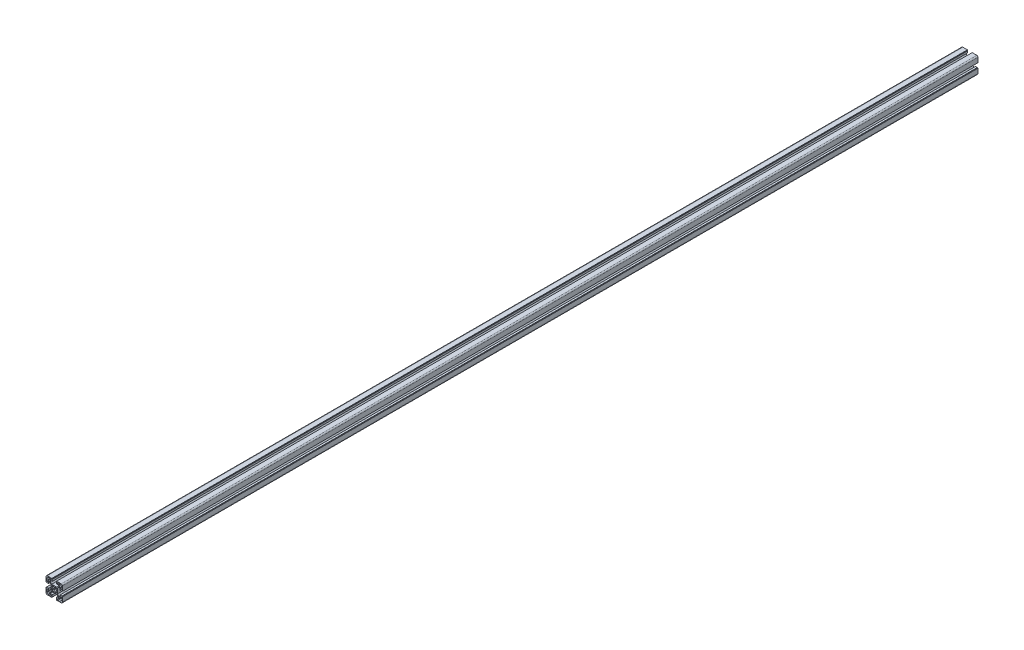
ISO-10303-21;
HEADER;
FILE_DESCRIPTION(('STEP AP214'),'2;1');
FILE_NAME('part.step','',(''),(''),'','','');
FILE_SCHEMA(('AUTOMOTIVE_DESIGN { 1 0 10303 214 1 1 1 1 }'));
ENDSEC;
DATA;
#1=APPLICATION_CONTEXT('core data for automotive mechanical design processes');
#2=APPLICATION_PROTOCOL_DEFINITION('international standard','automotive_design',2000,#1);
#3=PRODUCT_CONTEXT('',#1,'mechanical');
#4=PRODUCT('Part','Part','',(#3));
#5=PRODUCT_RELATED_PRODUCT_CATEGORY('part','',(#4));
#6=PRODUCT_DEFINITION_FORMATION('','',#4);
#7=PRODUCT_DEFINITION_CONTEXT('part definition',#1,'design');
#8=PRODUCT_DEFINITION('design','',#6,#7);
#9=PRODUCT_DEFINITION_SHAPE('','',#8);
#10=(LENGTH_UNIT() NAMED_UNIT(*) SI_UNIT(.MILLI.,.METRE.));
#11=(NAMED_UNIT(*) PLANE_ANGLE_UNIT() SI_UNIT($,.RADIAN.));
#12=(NAMED_UNIT(*) SI_UNIT($,.STERADIAN.) SOLID_ANGLE_UNIT());
#13=UNCERTAINTY_MEASURE_WITH_UNIT(LENGTH_MEASURE(1.E-05),#10,'distance_accuracy_value','');
#14=(GEOMETRIC_REPRESENTATION_CONTEXT(3) GLOBAL_UNCERTAINTY_ASSIGNED_CONTEXT((#13)) GLOBAL_UNIT_ASSIGNED_CONTEXT((#10,
#11,#12)) REPRESENTATION_CONTEXT('',''));
#15=CARTESIAN_POINT('',(0.,0.,0.));
#16=DIRECTION('',(0.,0.,1.));
#17=DIRECTION('',(1.,0.,0.));
#18=AXIS2_PLACEMENT_3D('',#15,#16,#17);
#19=CARTESIAN_POINT('',(-14.5000000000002,-11.75,2225.));
#20=DIRECTION('',(0.,-1.,0.));
#21=DIRECTION('',(1.,0.,0.));
#22=AXIS2_PLACEMENT_3D('',#19,#20,#21);
#23=PLANE('',#22);
#24=DIRECTION('',(1.,0.,0.));
#25=VECTOR('',#24,1.);
#26=CARTESIAN_POINT('',(-14.5000000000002,-11.75,2225.));
#27=LINE('',#26,#25);
#28=CARTESIAN_POINT('',(-14.5000000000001,-11.75,2225.));
#29=VERTEX_POINT('',#28);
#30=CARTESIAN_POINT('',(-15.5000000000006,-11.75,2225.));
#31=VERTEX_POINT('',#30);
#32=EDGE_CURVE('E806',#29,#31,#27,.F.);
#33=ORIENTED_EDGE('',*,*,#32,.T.);
#34=DIRECTION('',(0.,0.,1.));
#35=VECTOR('',#34,1.);
#36=CARTESIAN_POINT('',(-15.5000000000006,-11.75,2225.));
#37=LINE('',#36,#35);
#38=CARTESIAN_POINT('',(-15.5000000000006,-11.75,0.));
#39=VERTEX_POINT('',#38);
#40=EDGE_CURVE('E804',#39,#31,#37,.T.);
#41=ORIENTED_EDGE('',*,*,#40,.F.);
#42=DIRECTION('',(1.,0.,0.));
#43=VECTOR('',#42,1.);
#44=CARTESIAN_POINT('',(-14.5000000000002,-11.75,0.));
#45=LINE('',#44,#43);
#46=CARTESIAN_POINT('',(-14.5000000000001,-11.75,0.));
#47=VERTEX_POINT('',#46);
#48=EDGE_CURVE('E20',#39,#47,#45,.T.);
#49=ORIENTED_EDGE('',*,*,#48,.T.);
#50=DIRECTION('',(0.,0.,-1.));
#51=VECTOR('',#50,1.);
#52=CARTESIAN_POINT('',(-14.5000000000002,-11.75,2225.));
#53=LINE('',#52,#51);
#54=EDGE_CURVE('E801',#47,#29,#53,.F.);
#55=ORIENTED_EDGE('',*,*,#54,.T.);
#56=EDGE_LOOP('',(#33,#41,#49,#55));
#57=FACE_BOUND('',#56,.T.);
#58=ADVANCED_FACE('F17',(#57),#23,.T.);
#59=CARTESIAN_POINT('',(-11.7500000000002,-15.5,2225.));
#60=DIRECTION('',(-1.,0.,0.));
#61=DIRECTION('',(0.,-1.,0.));
#62=AXIS2_PLACEMENT_3D('',#59,#60,#61);
#63=PLANE('',#62);
#64=DIRECTION('',(0.,-1.,0.));
#65=VECTOR('',#64,1.);
#66=CARTESIAN_POINT('',(-11.7500000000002,-15.5,2225.));
#67=LINE('',#66,#65);
#68=CARTESIAN_POINT('',(-11.7500000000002,-15.5,2225.));
#69=VERTEX_POINT('',#68);
#70=CARTESIAN_POINT('',(-11.7500000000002,-14.5,2225.));
#71=VERTEX_POINT('',#70);
#72=EDGE_CURVE('E1218',#69,#71,#67,.F.);
#73=ORIENTED_EDGE('',*,*,#72,.T.);
#74=DIRECTION('',(0.,0.,-1.));
#75=VECTOR('',#74,1.);
#76=CARTESIAN_POINT('',(-11.7500000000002,-14.5,2225.));
#77=LINE('',#76,#75);
#78=CARTESIAN_POINT('',(-11.7500000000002,-14.5,0.));
#79=VERTEX_POINT('',#78);
#80=EDGE_CURVE('E814',#71,#79,#77,.T.);
#81=ORIENTED_EDGE('',*,*,#80,.T.);
#82=DIRECTION('',(0.,-1.,0.));
#83=VECTOR('',#82,1.);
#84=CARTESIAN_POINT('',(-11.7500000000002,-15.5,0.));
#85=LINE('',#84,#83);
#86=CARTESIAN_POINT('',(-11.7500000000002,-15.5,0.));
#87=VERTEX_POINT('',#86);
#88=EDGE_CURVE('E819',#79,#87,#85,.T.);
#89=ORIENTED_EDGE('',*,*,#88,.T.);
#90=DIRECTION('',(0.,0.,-1.));
#91=VECTOR('',#90,1.);
#92=CARTESIAN_POINT('',(-11.7500000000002,-15.5,2225.));
#93=LINE('',#92,#91);
#94=EDGE_CURVE('E1262',#69,#87,#93,.T.);
#95=ORIENTED_EDGE('',*,*,#94,.F.);
#96=EDGE_LOOP('',(#73,#81,#89,#95));
#97=FACE_BOUND('',#96,.T.);
#98=ADVANCED_FACE('F1555',(#97),#63,.T.);
#99=CARTESIAN_POINT('',(-14.5000000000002,-17.25,2225.));
#100=DIRECTION('',(1.,0.,0.));
#101=DIRECTION('',(0.,0.,-1.));
#102=AXIS2_PLACEMENT_3D('',#99,#100,#101);
#103=PLANE('',#102);
#104=DIRECTION('',(0.,1.,0.));
#105=VECTOR('',#104,1.);
#106=CARTESIAN_POINT('',(-14.5000000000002,-17.25,2225.));
#107=LINE('',#106,#105);
#108=CARTESIAN_POINT('',(-14.5000000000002,-17.25,2225.));
#109=VERTEX_POINT('',#108);
#110=CARTESIAN_POINT('',(-14.5000000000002,-18.5,2225.));
#111=VERTEX_POINT('',#110);
#112=EDGE_CURVE('E1214',#109,#111,#107,.F.);
#113=ORIENTED_EDGE('',*,*,#112,.T.);
#114=DIRECTION('',(0.,0.,1.));
#115=VECTOR('',#114,1.);
#116=CARTESIAN_POINT('',(-14.5000000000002,-18.5,2225.));
#117=LINE('',#116,#115);
#118=CARTESIAN_POINT('',(-14.5000000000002,-18.5,0.));
#119=VERTEX_POINT('',#118);
#120=EDGE_CURVE('E1256',#119,#111,#117,.T.);
#121=ORIENTED_EDGE('',*,*,#120,.F.);
#122=DIRECTION('',(0.,1.,0.));
#123=VECTOR('',#122,1.);
#124=CARTESIAN_POINT('',(-14.5000000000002,-17.25,0.));
#125=LINE('',#124,#123);
#126=CARTESIAN_POINT('',(-14.5000000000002,-17.25,0.));
#127=VERTEX_POINT('',#126);
#128=EDGE_CURVE('E1216',#119,#127,#125,.T.);
#129=ORIENTED_EDGE('',*,*,#128,.T.);
#130=DIRECTION('',(0.,0.,-1.));
#131=VECTOR('',#130,1.);
#132=CARTESIAN_POINT('',(-14.5000000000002,-17.25,2225.));
#133=LINE('',#132,#131);
#134=EDGE_CURVE('E1251',#127,#109,#133,.F.);
#135=ORIENTED_EDGE('',*,*,#134,.T.);
#136=EDGE_LOOP('',(#113,#121,#129,#135));
#137=FACE_BOUND('',#136,.T.);
#138=ADVANCED_FACE('F1560',(#137),#103,.T.);
#139=CARTESIAN_POINT('',(-18.5000000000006,-14.5000000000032,2225.));
#140=DIRECTION('',(0.,1.,0.));
#141=DIRECTION('',(0.,0.,1.));
#142=AXIS2_PLACEMENT_3D('',#139,#140,#141);
#143=PLANE('',#142);
#144=DIRECTION('',(1.,0.,0.));
#145=VECTOR('',#144,1.);
#146=CARTESIAN_POINT('',(-18.5000000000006,-14.5000000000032,2225.));
#147=LINE('',#146,#145);
#148=CARTESIAN_POINT('',(-18.5000000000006,-14.5000000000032,2225.));
#149=VERTEX_POINT('',#148);
#150=CARTESIAN_POINT('',(-17.2500000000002,-14.5000000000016,2225.));
#151=VERTEX_POINT('',#150);
#152=EDGE_CURVE('E1210',#149,#151,#147,.T.);
#153=ORIENTED_EDGE('',*,*,#152,.T.);
#154=DIRECTION('',(0.,0.,-1.));
#155=VECTOR('',#154,1.);
#156=CARTESIAN_POINT('',(-17.2500000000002,-14.5,2225.));
#157=LINE('',#156,#155);
#158=CARTESIAN_POINT('',(-17.2500000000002,-14.5000000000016,0.));
#159=VERTEX_POINT('',#158);
#160=EDGE_CURVE('E1248',#151,#159,#157,.T.);
#161=ORIENTED_EDGE('',*,*,#160,.T.);
#162=DIRECTION('',(1.,0.,0.));
#163=VECTOR('',#162,1.);
#164=CARTESIAN_POINT('',(-18.5000000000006,-14.5000000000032,0.));
#165=LINE('',#164,#163);
#166=CARTESIAN_POINT('',(-18.5000000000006,-14.5000000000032,0.));
#167=VERTEX_POINT('',#166);
#168=EDGE_CURVE('E1212',#159,#167,#165,.F.);
#169=ORIENTED_EDGE('',*,*,#168,.T.);
#170=DIRECTION('',(0.,0.,-1.));
#171=VECTOR('',#170,1.);
#172=CARTESIAN_POINT('',(-18.5000000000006,-14.5000000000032,2225.));
#173=LINE('',#172,#171);
#174=EDGE_CURVE('E1242',#149,#167,#173,.T.);
#175=ORIENTED_EDGE('',*,*,#174,.F.);
#176=EDGE_LOOP('',(#153,#161,#169,#175));
#177=FACE_BOUND('',#176,.T.);
#178=ADVANCED_FACE('F1569',(#177),#143,.T.);
#179=CARTESIAN_POINT('',(18.5000000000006,-14.5000000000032,2225.));
#180=DIRECTION('',(0.,1.,0.));
#181=DIRECTION('',(0.,0.,1.));
#182=AXIS2_PLACEMENT_3D('',#179,#180,#181);
#183=PLANE('',#182);
#184=DIRECTION('',(1.,0.,0.));
#185=VECTOR('',#184,1.);
#186=CARTESIAN_POINT('',(18.5000000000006,-14.5000000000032,2225.));
#187=LINE('',#186,#185);
#188=CARTESIAN_POINT('',(17.2500000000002,-14.5000000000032,2225.));
#189=VERTEX_POINT('',#188);
#190=CARTESIAN_POINT('',(18.5000000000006,-14.5000000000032,2225.));
#191=VERTEX_POINT('',#190);
#192=EDGE_CURVE('E1206',#189,#191,#187,.T.);
#193=ORIENTED_EDGE('',*,*,#192,.T.);
#194=DIRECTION('',(0.,0.,1.));
#195=VECTOR('',#194,1.);
#196=CARTESIAN_POINT('',(18.5000000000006,-14.5000000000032,2225.));
#197=LINE('',#196,#195);
#198=CARTESIAN_POINT('',(18.5000000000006,-14.5000000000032,0.));
#199=VERTEX_POINT('',#198);
#200=EDGE_CURVE('E1947',#199,#191,#197,.T.);
#201=ORIENTED_EDGE('',*,*,#200,.F.);
#202=DIRECTION('',(1.,0.,0.));
#203=VECTOR('',#202,1.);
#204=CARTESIAN_POINT('',(18.5000000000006,-14.5000000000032,0.));
#205=LINE('',#204,#203);
#206=CARTESIAN_POINT('',(17.2500000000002,-14.5000000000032,0.));
#207=VERTEX_POINT('',#206);
#208=EDGE_CURVE('E1208',#199,#207,#205,.F.);
#209=ORIENTED_EDGE('',*,*,#208,.T.);
#210=DIRECTION('',(0.,0.,-1.));
#211=VECTOR('',#210,1.);
#212=CARTESIAN_POINT('',(17.2500000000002,-14.5000000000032,2225.));
#213=LINE('',#212,#211);
#214=EDGE_CURVE('E1952',#207,#189,#213,.F.);
#215=ORIENTED_EDGE('',*,*,#214,.T.);
#216=EDGE_LOOP('',(#193,#201,#209,#215));
#217=FACE_BOUND('',#216,.T.);
#218=ADVANCED_FACE('F2472',(#217),#183,.T.);
#219=CARTESIAN_POINT('',(14.5000000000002,-17.25,2225.));
#220=DIRECTION('',(-1.,0.,0.));
#221=DIRECTION('',(0.,0.,1.));
#222=AXIS2_PLACEMENT_3D('',#219,#220,#221);
#223=PLANE('',#222);
#224=DIRECTION('',(0.,1.,0.));
#225=VECTOR('',#224,1.);
#226=CARTESIAN_POINT('',(14.5000000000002,-17.25,2225.));
#227=LINE('',#226,#225);
#228=CARTESIAN_POINT('',(14.5000000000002,-18.5,2225.));
#229=VERTEX_POINT('',#228);
#230=CARTESIAN_POINT('',(14.5000000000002,-17.25,2225.));
#231=VERTEX_POINT('',#230);
#232=EDGE_CURVE('E1202',#229,#231,#227,.T.);
#233=ORIENTED_EDGE('',*,*,#232,.T.);
#234=DIRECTION('',(0.,0.,-1.));
#235=VECTOR('',#234,1.);
#236=CARTESIAN_POINT('',(14.5000000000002,-17.25,2225.));
#237=LINE('',#236,#235);
#238=CARTESIAN_POINT('',(14.5000000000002,-17.25,0.));
#239=VERTEX_POINT('',#238);
#240=EDGE_CURVE('E1955',#231,#239,#237,.T.);
#241=ORIENTED_EDGE('',*,*,#240,.T.);
#242=DIRECTION('',(0.,1.,0.));
#243=VECTOR('',#242,1.);
#244=CARTESIAN_POINT('',(14.5000000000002,-17.25,0.));
#245=LINE('',#244,#243);
#246=CARTESIAN_POINT('',(14.5000000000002,-18.5,0.));
#247=VERTEX_POINT('',#246);
#248=EDGE_CURVE('E1204',#239,#247,#245,.F.);
#249=ORIENTED_EDGE('',*,*,#248,.T.);
#250=DIRECTION('',(0.,0.,1.));
#251=VECTOR('',#250,1.);
#252=CARTESIAN_POINT('',(14.5000000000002,-18.5,2225.));
#253=LINE('',#252,#251);
#254=EDGE_CURVE('E1958',#229,#247,#253,.F.);
#255=ORIENTED_EDGE('',*,*,#254,.F.);
#256=EDGE_LOOP('',(#233,#241,#249,#255));
#257=FACE_BOUND('',#256,.T.);
#258=ADVANCED_FACE('F2468',(#257),#223,.T.);
#259=CARTESIAN_POINT('',(11.7500000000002,-15.5,2225.));
#260=DIRECTION('',(1.,0.,0.));
#261=DIRECTION('',(0.,1.,0.));
#262=AXIS2_PLACEMENT_3D('',#259,#260,#261);
#263=PLANE('',#262);
#264=DIRECTION('',(0.,1.,0.));
#265=VECTOR('',#264,1.);
#266=CARTESIAN_POINT('',(11.7500000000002,-15.5,2225.));
#267=LINE('',#266,#265);
#268=CARTESIAN_POINT('',(11.7500000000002,-14.5,2225.));
#269=VERTEX_POINT('',#268);
#270=CARTESIAN_POINT('',(11.7500000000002,-15.5,2225.));
#271=VERTEX_POINT('',#270);
#272=EDGE_CURVE('E1198',#269,#271,#267,.F.);
#273=ORIENTED_EDGE('',*,*,#272,.T.);
#274=DIRECTION('',(0.,0.,-1.));
#275=VECTOR('',#274,1.);
#276=CARTESIAN_POINT('',(11.7500000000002,-15.5,2225.));
#277=LINE('',#276,#275);
#278=CARTESIAN_POINT('',(11.7500000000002,-15.5,0.));
#279=VERTEX_POINT('',#278);
#280=EDGE_CURVE('E1964',#279,#271,#277,.F.);
#281=ORIENTED_EDGE('',*,*,#280,.F.);
#282=DIRECTION('',(0.,1.,0.));
#283=VECTOR('',#282,1.);
#284=CARTESIAN_POINT('',(11.7500000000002,-15.5,0.));
#285=LINE('',#284,#283);
#286=CARTESIAN_POINT('',(11.7500000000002,-14.5,0.));
#287=VERTEX_POINT('',#286);
#288=EDGE_CURVE('E1200',#279,#287,#285,.T.);
#289=ORIENTED_EDGE('',*,*,#288,.T.);
#290=DIRECTION('',(0.,0.,-1.));
#291=VECTOR('',#290,1.);
#292=CARTESIAN_POINT('',(11.7500000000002,-14.5,2225.));
#293=LINE('',#292,#291);
#294=EDGE_CURVE('E1969',#287,#269,#293,.F.);
#295=ORIENTED_EDGE('',*,*,#294,.T.);
#296=EDGE_LOOP('',(#273,#281,#289,#295));
#297=FACE_BOUND('',#296,.T.);
#298=ADVANCED_FACE('F2465',(#297),#263,.T.);
#299=CARTESIAN_POINT('',(14.5000000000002,-11.75,2225.));
#300=DIRECTION('',(0.,-1.,0.));
#301=DIRECTION('',(1.,0.,0.));
#302=AXIS2_PLACEMENT_3D('',#299,#300,#301);
#303=PLANE('',#302);
#304=DIRECTION('',(1.,0.,0.));
#305=VECTOR('',#304,1.);
#306=CARTESIAN_POINT('',(14.5000000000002,-11.75,2225.));
#307=LINE('',#306,#305);
#308=CARTESIAN_POINT('',(15.5000000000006,-11.75,2225.));
#309=VERTEX_POINT('',#308);
#310=CARTESIAN_POINT('',(14.5000000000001,-11.75,2225.));
#311=VERTEX_POINT('',#310);
#312=EDGE_CURVE('E1194',#309,#311,#307,.F.);
#313=ORIENTED_EDGE('',*,*,#312,.T.);
#314=DIRECTION('',(0.,0.,-1.));
#315=VECTOR('',#314,1.);
#316=CARTESIAN_POINT('',(14.5000000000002,-11.75,2225.));
#317=LINE('',#316,#315);
#318=CARTESIAN_POINT('',(14.5000000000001,-11.75,0.));
#319=VERTEX_POINT('',#318);
#320=EDGE_CURVE('E1940',#311,#319,#317,.T.);
#321=ORIENTED_EDGE('',*,*,#320,.T.);
#322=DIRECTION('',(1.,0.,0.));
#323=VECTOR('',#322,1.);
#324=CARTESIAN_POINT('',(14.5000000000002,-11.75,0.));
#325=LINE('',#324,#323);
#326=CARTESIAN_POINT('',(15.5000000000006,-11.75,0.));
#327=VERTEX_POINT('',#326);
#328=EDGE_CURVE('E1196',#319,#327,#325,.T.);
#329=ORIENTED_EDGE('',*,*,#328,.T.);
#330=DIRECTION('',(0.,0.,-1.));
#331=VECTOR('',#330,1.);
#332=CARTESIAN_POINT('',(15.5000000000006,-11.75,2225.));
#333=LINE('',#332,#331);
#334=EDGE_CURVE('E1237',#309,#327,#333,.T.);
#335=ORIENTED_EDGE('',*,*,#334,.F.);
#336=EDGE_LOOP('',(#313,#321,#329,#335));
#337=FACE_BOUND('',#336,.T.);
#338=ADVANCED_FACE('F1939',(#337),#303,.T.);
#339=CARTESIAN_POINT('',(5.80000000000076,-18.5000000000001,2225.));
#340=DIRECTION('',(1.,0.,0.));
#341=DIRECTION('',(0.,0.,-1.));
#342=AXIS2_PLACEMENT_3D('',#339,#340,#341);
#343=PLANE('',#342);
#344=DIRECTION('',(0.,0.,1.));
#345=VECTOR('',#344,1.);
#346=CARTESIAN_POINT('',(5.80000000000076,-20.,2225.));
#347=LINE('',#346,#345);
#348=CARTESIAN_POINT('',(5.80000000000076,-20.,0.));
#349=VERTEX_POINT('',#348);
#350=CARTESIAN_POINT('',(5.80000000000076,-20.,2225.));
#351=VERTEX_POINT('',#350);
#352=EDGE_CURVE('E1973',#349,#351,#347,.T.);
#353=ORIENTED_EDGE('',*,*,#352,.T.);
#354=DIRECTION('',(0.,1.,0.));
#355=VECTOR('',#354,1.);
#356=CARTESIAN_POINT('',(5.80000000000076,-17.,2225.));
#357=LINE('',#356,#355);
#358=CARTESIAN_POINT('',(5.80000000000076,-18.5000000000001,2225.));
#359=VERTEX_POINT('',#358);
#360=EDGE_CURVE('E1192',#359,#351,#357,.F.);
#361=ORIENTED_EDGE('',*,*,#360,.F.);
#362=DIRECTION('',(0.,0.,1.));
#363=VECTOR('',#362,1.);
#364=CARTESIAN_POINT('',(5.80000000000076,-18.5000000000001,2225.));
#365=LINE('',#364,#363);
#366=CARTESIAN_POINT('',(5.80000000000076,-18.5000000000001,0.));
#367=VERTEX_POINT('',#366);
#368=EDGE_CURVE('E1116',#359,#367,#365,.F.);
#369=ORIENTED_EDGE('',*,*,#368,.T.);
#370=DIRECTION('',(0.,1.,0.));
#371=VECTOR('',#370,1.);
#372=CARTESIAN_POINT('',(5.80000000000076,-17.,0.));
#373=LINE('',#372,#371);
#374=EDGE_CURVE('E1190',#349,#367,#373,.T.);
#375=ORIENTED_EDGE('',*,*,#374,.F.);
#376=EDGE_LOOP('',(#353,#361,#369,#375));
#377=FACE_BOUND('',#376,.T.);
#378=ADVANCED_FACE('F2286',(#377),#343,.F.);
#379=CARTESIAN_POINT('',(20.,-5.79999999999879,2225.));
#380=DIRECTION('',(0.,-1.,0.));
#381=DIRECTION('',(0.,0.,-1.));
#382=AXIS2_PLACEMENT_3D('',#379,#380,#381);
#383=PLANE('',#382);
#384=DIRECTION('',(0.,0.,1.));
#385=VECTOR('',#384,1.);
#386=CARTESIAN_POINT('',(18.5,-5.79999999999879,2225.));
#387=LINE('',#386,#385);
#388=CARTESIAN_POINT('',(18.5,-5.79999999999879,0.));
#389=VERTEX_POINT('',#388);
#390=CARTESIAN_POINT('',(18.5,-5.79999999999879,2225.));
#391=VERTEX_POINT('',#390);
#392=EDGE_CURVE('E1185',#389,#391,#387,.T.);
#393=ORIENTED_EDGE('',*,*,#392,.T.);
#394=DIRECTION('',(1.,0.,0.));
#395=VECTOR('',#394,1.);
#396=CARTESIAN_POINT('',(17.,-5.79999999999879,2225.));
#397=LINE('',#396,#395);
#398=CARTESIAN_POINT('',(20.,-5.79999999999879,2225.));
#399=VERTEX_POINT('',#398);
#400=EDGE_CURVE('E1188',#399,#391,#397,.F.);
#401=ORIENTED_EDGE('',*,*,#400,.F.);
#402=DIRECTION('',(0.,0.,1.));
#403=VECTOR('',#402,1.);
#404=CARTESIAN_POINT('',(20.,-5.79999999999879,2225.));
#405=LINE('',#404,#403);
#406=CARTESIAN_POINT('',(20.,-5.79999999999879,0.));
#407=VERTEX_POINT('',#406);
#408=EDGE_CURVE('E1981',#399,#407,#405,.F.);
#409=ORIENTED_EDGE('',*,*,#408,.T.);
#410=DIRECTION('',(1.,0.,0.));
#411=VECTOR('',#410,1.);
#412=CARTESIAN_POINT('',(17.,-5.79999999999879,0.));
#413=LINE('',#412,#411);
#414=EDGE_CURVE('E1186',#389,#407,#413,.T.);
#415=ORIENTED_EDGE('',*,*,#414,.F.);
#416=EDGE_LOOP('',(#393,#401,#409,#415));
#417=FACE_BOUND('',#416,.T.);
#418=ADVANCED_FACE('F2294',(#417),#383,.F.);
#419=CARTESIAN_POINT('',(18.5,-5.79999999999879,2225.));
#420=DIRECTION('',(-1.,0.,0.));
#421=DIRECTION('',(0.,0.,1.));
#422=AXIS2_PLACEMENT_3D('',#419,#420,#421);
#423=PLANE('',#422);
#424=DIRECTION('',(0.,0.,-1.));
#425=VECTOR('',#424,1.);
#426=CARTESIAN_POINT('',(18.5,-4.99999999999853,2225.));
#427=LINE('',#426,#425);
#428=CARTESIAN_POINT('',(18.5,-4.99999999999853,0.));
#429=VERTEX_POINT('',#428);
#430=CARTESIAN_POINT('',(18.5,-4.99999999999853,2225.));
#431=VERTEX_POINT('',#430);
#432=EDGE_CURVE('E1984',#429,#431,#427,.F.);
#433=ORIENTED_EDGE('',*,*,#432,.T.);
#434=DIRECTION('',(0.,1.,0.));
#435=VECTOR('',#434,1.);
#436=CARTESIAN_POINT('',(18.5,-17.,2225.));
#437=LINE('',#436,#435);
#438=EDGE_CURVE('E1183',#391,#431,#437,.T.);
#439=ORIENTED_EDGE('',*,*,#438,.F.);
#440=ORIENTED_EDGE('',*,*,#392,.F.);
#441=DIRECTION('',(0.,1.,0.));
#442=VECTOR('',#441,1.);
#443=CARTESIAN_POINT('',(18.5,-17.,0.));
#444=LINE('',#443,#442);
#445=EDGE_CURVE('E1180',#429,#389,#444,.F.);
#446=ORIENTED_EDGE('',*,*,#445,.F.);
#447=EDGE_LOOP('',(#433,#439,#440,#446));
#448=FACE_BOUND('',#447,.T.);
#449=ADVANCED_FACE('F2297',(#448),#423,.F.);
#450=CARTESIAN_POINT('',(18.5,5.79999999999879,2225.));
#451=DIRECTION('',(-1.,0.,0.));
#452=DIRECTION('',(0.,0.,1.));
#453=AXIS2_PLACEMENT_3D('',#450,#451,#452);
#454=PLANE('',#453);
#455=DIRECTION('',(0.,0.,1.));
#456=VECTOR('',#455,1.);
#457=CARTESIAN_POINT('',(18.5,5.79999999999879,2225.));
#458=LINE('',#457,#456);
#459=CARTESIAN_POINT('',(18.5,5.79999999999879,0.));
#460=VERTEX_POINT('',#459);
#461=CARTESIAN_POINT('',(18.5,5.79999999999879,2225.));
#462=VERTEX_POINT('',#461);
#463=EDGE_CURVE('E1175',#460,#462,#458,.T.);
#464=ORIENTED_EDGE('',*,*,#463,.T.);
#465=DIRECTION('',(0.,1.,0.));
#466=VECTOR('',#465,1.);
#467=CARTESIAN_POINT('',(18.5,-17.,2225.));
#468=LINE('',#467,#466);
#469=CARTESIAN_POINT('',(18.5,4.99999999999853,2225.));
#470=VERTEX_POINT('',#469);
#471=EDGE_CURVE('E1178',#470,#462,#468,.T.);
#472=ORIENTED_EDGE('',*,*,#471,.F.);
#473=DIRECTION('',(0.,0.,1.));
#474=VECTOR('',#473,1.);
#475=CARTESIAN_POINT('',(18.5,4.99999999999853,2225.));
#476=LINE('',#475,#474);
#477=CARTESIAN_POINT('',(18.5,4.99999999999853,0.));
#478=VERTEX_POINT('',#477);
#479=EDGE_CURVE('E2011',#470,#478,#476,.F.);
#480=ORIENTED_EDGE('',*,*,#479,.T.);
#481=DIRECTION('',(0.,1.,0.));
#482=VECTOR('',#481,1.);
#483=CARTESIAN_POINT('',(18.5,-17.,0.));
#484=LINE('',#483,#482);
#485=EDGE_CURVE('E1176',#460,#478,#484,.F.);
#486=ORIENTED_EDGE('',*,*,#485,.F.);
#487=EDGE_LOOP('',(#464,#472,#480,#486));
#488=FACE_BOUND('',#487,.T.);
#489=ADVANCED_FACE('F2319',(#488),#454,.F.);
#490=CARTESIAN_POINT('',(20.,5.79999999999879,2225.));
#491=DIRECTION('',(0.,1.,0.));
#492=DIRECTION('',(0.,0.,1.));
#493=AXIS2_PLACEMENT_3D('',#490,#491,#492);
#494=PLANE('',#493);
#495=DIRECTION('',(0.,0.,1.));
#496=VECTOR('',#495,1.);
#497=CARTESIAN_POINT('',(20.,5.79999999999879,2225.));
#498=LINE('',#497,#496);
#499=CARTESIAN_POINT('',(20.,5.79999999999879,0.));
#500=VERTEX_POINT('',#499);
#501=CARTESIAN_POINT('',(20.,5.79999999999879,2225.));
#502=VERTEX_POINT('',#501);
#503=EDGE_CURVE('E2014',#500,#502,#498,.T.);
#504=ORIENTED_EDGE('',*,*,#503,.T.);
#505=DIRECTION('',(1.,0.,0.));
#506=VECTOR('',#505,1.);
#507=CARTESIAN_POINT('',(17.,5.79999999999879,2225.));
#508=LINE('',#507,#506);
#509=EDGE_CURVE('E1173',#462,#502,#508,.T.);
#510=ORIENTED_EDGE('',*,*,#509,.F.);
#511=ORIENTED_EDGE('',*,*,#463,.F.);
#512=DIRECTION('',(1.,0.,0.));
#513=VECTOR('',#512,1.);
#514=CARTESIAN_POINT('',(17.,5.79999999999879,0.));
#515=LINE('',#514,#513);
#516=EDGE_CURVE('E1170',#500,#460,#515,.F.);
#517=ORIENTED_EDGE('',*,*,#516,.F.);
#518=EDGE_LOOP('',(#504,#510,#511,#517));
#519=FACE_BOUND('',#518,.T.);
#520=ADVANCED_FACE('F2323',(#519),#494,.F.);
#521=CARTESIAN_POINT('',(5.80000000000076,18.5000000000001,2225.));
#522=DIRECTION('',(1.,0.,0.));
#523=DIRECTION('',(0.,0.,-1.));
#524=AXIS2_PLACEMENT_3D('',#521,#522,#523);
#525=PLANE('',#524);
#526=DIRECTION('',(0.,0.,-1.));
#527=VECTOR('',#526,1.);
#528=CARTESIAN_POINT('',(5.80000000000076,18.5000000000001,2225.));
#529=LINE('',#528,#527);
#530=CARTESIAN_POINT('',(5.80000000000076,18.5000000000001,0.));
#531=VERTEX_POINT('',#530);
#532=CARTESIAN_POINT('',(5.80000000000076,18.5000000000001,2225.));
#533=VERTEX_POINT('',#532);
#534=EDGE_CURVE('E1165',#531,#533,#529,.F.);
#535=ORIENTED_EDGE('',*,*,#534,.T.);
#536=DIRECTION('',(0.,1.,0.));
#537=VECTOR('',#536,1.);
#538=CARTESIAN_POINT('',(5.80000000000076,-17.,2225.));
#539=LINE('',#538,#537);
#540=CARTESIAN_POINT('',(5.80000000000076,20.,2225.));
#541=VERTEX_POINT('',#540);
#542=EDGE_CURVE('E1168',#541,#533,#539,.F.);
#543=ORIENTED_EDGE('',*,*,#542,.F.);
#544=DIRECTION('',(0.,0.,-1.));
#545=VECTOR('',#544,1.);
#546=CARTESIAN_POINT('',(5.80000000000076,20.,2225.));
#547=LINE('',#546,#545);
#548=CARTESIAN_POINT('',(5.80000000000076,20.,0.));
#549=VERTEX_POINT('',#548);
#550=EDGE_CURVE('E2022',#541,#549,#547,.T.);
#551=ORIENTED_EDGE('',*,*,#550,.T.);
#552=DIRECTION('',(0.,1.,0.));
#553=VECTOR('',#552,1.);
#554=CARTESIAN_POINT('',(5.80000000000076,-17.,0.));
#555=LINE('',#554,#553);
#556=EDGE_CURVE('E1166',#531,#549,#555,.T.);
#557=ORIENTED_EDGE('',*,*,#556,.F.);
#558=EDGE_LOOP('',(#535,#543,#551,#557));
#559=FACE_BOUND('',#558,.T.);
#560=ADVANCED_FACE('F2334',(#559),#525,.F.);
#561=CARTESIAN_POINT('',(5.00000000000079,18.5000000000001,2225.));
#562=DIRECTION('',(0.,-1.,0.));
#563=DIRECTION('',(0.,0.,-1.));
#564=AXIS2_PLACEMENT_3D('',#561,#562,#563);
#565=PLANE('',#564);
#566=DIRECTION('',(0.,0.,1.));
#567=VECTOR('',#566,1.);
#568=CARTESIAN_POINT('',(5.00000000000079,18.5000000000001,2225.));
#569=LINE('',#568,#567);
#570=CARTESIAN_POINT('',(5.00000000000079,18.5000000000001,0.));
#571=VERTEX_POINT('',#570);
#572=CARTESIAN_POINT('',(5.00000000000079,18.5000000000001,2225.));
#573=VERTEX_POINT('',#572);
#574=EDGE_CURVE('E2025',#571,#573,#569,.T.);
#575=ORIENTED_EDGE('',*,*,#574,.T.);
#576=DIRECTION('',(1.,0.,0.));
#577=VECTOR('',#576,1.);
#578=CARTESIAN_POINT('',(17.,18.5000000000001,2225.));
#579=LINE('',#578,#577);
#580=EDGE_CURVE('E1163',#533,#573,#579,.F.);
#581=ORIENTED_EDGE('',*,*,#580,.F.);
#582=ORIENTED_EDGE('',*,*,#534,.F.);
#583=DIRECTION('',(1.,0.,0.));
#584=VECTOR('',#583,1.);
#585=CARTESIAN_POINT('',(17.,18.5000000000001,0.));
#586=LINE('',#585,#584);
#587=EDGE_CURVE('E1160',#571,#531,#586,.T.);
#588=ORIENTED_EDGE('',*,*,#587,.F.);
#589=EDGE_LOOP('',(#575,#581,#582,#588));
#590=FACE_BOUND('',#589,.T.);
#591=ADVANCED_FACE('F2338',(#590),#565,.F.);
#592=CARTESIAN_POINT('',(-5.00000000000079,18.5000000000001,2225.));
#593=DIRECTION('',(0.,-1.,0.));
#594=DIRECTION('',(0.,0.,-1.));
#595=AXIS2_PLACEMENT_3D('',#592,#593,#594);
#596=PLANE('',#595);
#597=DIRECTION('',(0.,0.,1.));
#598=VECTOR('',#597,1.);
#599=CARTESIAN_POINT('',(-5.80000000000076,18.5000000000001,2225.));
#600=LINE('',#599,#598);
#601=CARTESIAN_POINT('',(-5.80000000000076,18.5000000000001,0.));
#602=VERTEX_POINT('',#601);
#603=CARTESIAN_POINT('',(-5.80000000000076,18.5000000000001,2225.));
#604=VERTEX_POINT('',#603);
#605=EDGE_CURVE('E1155',#602,#604,#600,.T.);
#606=ORIENTED_EDGE('',*,*,#605,.T.);
#607=DIRECTION('',(1.,0.,0.));
#608=VECTOR('',#607,1.);
#609=CARTESIAN_POINT('',(17.,18.5000000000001,2225.));
#610=LINE('',#609,#608);
#611=CARTESIAN_POINT('',(-5.00000000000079,18.5000000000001,2225.));
#612=VERTEX_POINT('',#611);
#613=EDGE_CURVE('E1158',#612,#604,#610,.F.);
#614=ORIENTED_EDGE('',*,*,#613,.F.);
#615=DIRECTION('',(0.,0.,1.));
#616=VECTOR('',#615,1.);
#617=CARTESIAN_POINT('',(-5.00000000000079,18.5000000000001,2225.));
#618=LINE('',#617,#616);
#619=CARTESIAN_POINT('',(-5.00000000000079,18.5000000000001,0.));
#620=VERTEX_POINT('',#619);
#621=EDGE_CURVE('E2052',#612,#620,#618,.F.);
#622=ORIENTED_EDGE('',*,*,#621,.T.);
#623=DIRECTION('',(1.,0.,0.));
#624=VECTOR('',#623,1.);
#625=CARTESIAN_POINT('',(17.,18.5000000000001,0.));
#626=LINE('',#625,#624);
#627=EDGE_CURVE('E1156',#602,#620,#626,.T.);
#628=ORIENTED_EDGE('',*,*,#627,.F.);
#629=EDGE_LOOP('',(#606,#614,#622,#628));
#630=FACE_BOUND('',#629,.T.);
#631=ADVANCED_FACE('F2360',(#630),#596,.F.);
#632=CARTESIAN_POINT('',(-5.80000000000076,18.5000000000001,2225.));
#633=DIRECTION('',(-1.,0.,0.));
#634=DIRECTION('',(0.,0.,1.));
#635=AXIS2_PLACEMENT_3D('',#632,#633,#634);
#636=PLANE('',#635);
#637=DIRECTION('',(0.,0.,1.));
#638=VECTOR('',#637,1.);
#639=CARTESIAN_POINT('',(-5.80000000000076,20.,2225.));
#640=LINE('',#639,#638);
#641=CARTESIAN_POINT('',(-5.80000000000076,20.,0.));
#642=VERTEX_POINT('',#641);
#643=CARTESIAN_POINT('',(-5.80000000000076,20.,2225.));
#644=VERTEX_POINT('',#643);
#645=EDGE_CURVE('E2055',#642,#644,#640,.T.);
#646=ORIENTED_EDGE('',*,*,#645,.T.);
#647=DIRECTION('',(0.,1.,0.));
#648=VECTOR('',#647,1.);
#649=CARTESIAN_POINT('',(-5.80000000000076,-17.,2225.));
#650=LINE('',#649,#648);
#651=EDGE_CURVE('E1153',#604,#644,#650,.T.);
#652=ORIENTED_EDGE('',*,*,#651,.F.);
#653=ORIENTED_EDGE('',*,*,#605,.F.);
#654=DIRECTION('',(0.,1.,0.));
#655=VECTOR('',#654,1.);
#656=CARTESIAN_POINT('',(-5.80000000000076,-17.,0.));
#657=LINE('',#656,#655);
#658=EDGE_CURVE('E1150',#642,#602,#657,.F.);
#659=ORIENTED_EDGE('',*,*,#658,.F.);
#660=EDGE_LOOP('',(#646,#652,#653,#659));
#661=FACE_BOUND('',#660,.T.);
#662=ADVANCED_FACE('F2364',(#661),#636,.F.);
#663=CARTESIAN_POINT('',(-20.,5.79999999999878,2225.));
#664=DIRECTION('',(0.,1.,0.));
#665=DIRECTION('',(0.,0.,1.));
#666=AXIS2_PLACEMENT_3D('',#663,#664,#665);
#667=PLANE('',#666);
#668=DIRECTION('',(0.,0.,-1.));
#669=VECTOR('',#668,1.);
#670=CARTESIAN_POINT('',(-18.5,5.79999999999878,2225.));
#671=LINE('',#670,#669);
#672=CARTESIAN_POINT('',(-18.5,5.79999999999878,0.));
#673=VERTEX_POINT('',#672);
#674=CARTESIAN_POINT('',(-18.5,5.79999999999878,2225.));
#675=VERTEX_POINT('',#674);
#676=EDGE_CURVE('E1145',#673,#675,#671,.F.);
#677=ORIENTED_EDGE('',*,*,#676,.T.);
#678=DIRECTION('',(1.,0.,0.));
#679=VECTOR('',#678,1.);
#680=CARTESIAN_POINT('',(17.,5.79999999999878,2225.));
#681=LINE('',#680,#679);
#682=CARTESIAN_POINT('',(-20.,5.79999999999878,2225.));
#683=VERTEX_POINT('',#682);
#684=EDGE_CURVE('E1148',#683,#675,#681,.T.);
#685=ORIENTED_EDGE('',*,*,#684,.F.);
#686=DIRECTION('',(0.,0.,1.));
#687=VECTOR('',#686,1.);
#688=CARTESIAN_POINT('',(-20.,5.79999999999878,2225.));
#689=LINE('',#688,#687);
#690=CARTESIAN_POINT('',(-20.,5.79999999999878,0.));
#691=VERTEX_POINT('',#690);
#692=EDGE_CURVE('E2063',#683,#691,#689,.F.);
#693=ORIENTED_EDGE('',*,*,#692,.T.);
#694=DIRECTION('',(1.,0.,0.));
#695=VECTOR('',#694,1.);
#696=CARTESIAN_POINT('',(17.,5.79999999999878,0.));
#697=LINE('',#696,#695);
#698=EDGE_CURVE('E1146',#673,#691,#697,.F.);
#699=ORIENTED_EDGE('',*,*,#698,.F.);
#700=EDGE_LOOP('',(#677,#685,#693,#699));
#701=FACE_BOUND('',#700,.T.);
#702=ADVANCED_FACE('F2375',(#701),#667,.F.);
#703=CARTESIAN_POINT('',(-18.5,5.79999999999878,2225.));
#704=DIRECTION('',(1.,0.,0.));
#705=DIRECTION('',(0.,0.,-1.));
#706=AXIS2_PLACEMENT_3D('',#703,#704,#705);
#707=PLANE('',#706);
#708=DIRECTION('',(0.,0.,1.));
#709=VECTOR('',#708,1.);
#710=CARTESIAN_POINT('',(-18.5,4.99999999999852,2225.));
#711=LINE('',#710,#709);
#712=CARTESIAN_POINT('',(-18.5,4.99999999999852,0.));
#713=VERTEX_POINT('',#712);
#714=CARTESIAN_POINT('',(-18.5,4.99999999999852,2225.));
#715=VERTEX_POINT('',#714);
#716=EDGE_CURVE('E2066',#713,#715,#711,.T.);
#717=ORIENTED_EDGE('',*,*,#716,.T.);
#718=DIRECTION('',(0.,1.,0.));
#719=VECTOR('',#718,1.);
#720=CARTESIAN_POINT('',(-18.5,-17.,2225.));
#721=LINE('',#720,#719);
#722=EDGE_CURVE('E1143',#675,#715,#721,.F.);
#723=ORIENTED_EDGE('',*,*,#722,.F.);
#724=ORIENTED_EDGE('',*,*,#676,.F.);
#725=DIRECTION('',(0.,1.,0.));
#726=VECTOR('',#725,1.);
#727=CARTESIAN_POINT('',(-18.5,-17.,0.));
#728=LINE('',#727,#726);
#729=EDGE_CURVE('E1140',#713,#673,#728,.T.);
#730=ORIENTED_EDGE('',*,*,#729,.F.);
#731=EDGE_LOOP('',(#717,#723,#724,#730));
#732=FACE_BOUND('',#731,.T.);
#733=ADVANCED_FACE('F2379',(#732),#707,.F.);
#734=CARTESIAN_POINT('',(-18.5,-5.79999999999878,2225.));
#735=DIRECTION('',(1.,0.,0.));
#736=DIRECTION('',(0.,0.,-1.));
#737=AXIS2_PLACEMENT_3D('',#734,#735,#736);
#738=PLANE('',#737);
#739=DIRECTION('',(0.,0.,-1.));
#740=VECTOR('',#739,1.);
#741=CARTESIAN_POINT('',(-18.5,-5.79999999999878,2225.));
#742=LINE('',#741,#740);
#743=CARTESIAN_POINT('',(-18.5,-5.79999999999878,0.));
#744=VERTEX_POINT('',#743);
#745=CARTESIAN_POINT('',(-18.5,-5.79999999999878,2225.));
#746=VERTEX_POINT('',#745);
#747=EDGE_CURVE('E1135',#744,#746,#742,.F.);
#748=ORIENTED_EDGE('',*,*,#747,.T.);
#749=DIRECTION('',(0.,1.,0.));
#750=VECTOR('',#749,1.);
#751=CARTESIAN_POINT('',(-18.5,-17.,2225.));
#752=LINE('',#751,#750);
#753=CARTESIAN_POINT('',(-18.5,-4.99999999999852,2225.));
#754=VERTEX_POINT('',#753);
#755=EDGE_CURVE('E1138',#754,#746,#752,.F.);
#756=ORIENTED_EDGE('',*,*,#755,.F.);
#757=DIRECTION('',(0.,0.,1.));
#758=VECTOR('',#757,1.);
#759=CARTESIAN_POINT('',(-18.5,-4.99999999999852,2225.));
#760=LINE('',#759,#758);
#761=CARTESIAN_POINT('',(-18.5,-4.99999999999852,0.));
#762=VERTEX_POINT('',#761);
#763=EDGE_CURVE('E2093',#754,#762,#760,.F.);
#764=ORIENTED_EDGE('',*,*,#763,.T.);
#765=DIRECTION('',(0.,1.,0.));
#766=VECTOR('',#765,1.);
#767=CARTESIAN_POINT('',(-18.5,-17.,0.));
#768=LINE('',#767,#766);
#769=EDGE_CURVE('E1136',#744,#762,#768,.T.);
#770=ORIENTED_EDGE('',*,*,#769,.F.);
#771=EDGE_LOOP('',(#748,#756,#764,#770));
#772=FACE_BOUND('',#771,.T.);
#773=ADVANCED_FACE('F2401',(#772),#738,.F.);
#774=CARTESIAN_POINT('',(-20.,-5.79999999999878,2225.));
#775=DIRECTION('',(0.,-1.,0.));
#776=DIRECTION('',(0.,0.,-1.));
#777=AXIS2_PLACEMENT_3D('',#774,#775,#776);
#778=PLANE('',#777);
#779=DIRECTION('',(0.,0.,1.));
#780=VECTOR('',#779,1.);
#781=CARTESIAN_POINT('',(-20.,-5.79999999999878,2225.));
#782=LINE('',#781,#780);
#783=CARTESIAN_POINT('',(-20.,-5.79999999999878,0.));
#784=VERTEX_POINT('',#783);
#785=CARTESIAN_POINT('',(-20.,-5.79999999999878,2225.));
#786=VERTEX_POINT('',#785);
#787=EDGE_CURVE('E2096',#784,#786,#782,.T.);
#788=ORIENTED_EDGE('',*,*,#787,.T.);
#789=DIRECTION('',(1.,0.,0.));
#790=VECTOR('',#789,1.);
#791=CARTESIAN_POINT('',(17.,-5.79999999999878,2225.));
#792=LINE('',#791,#790);
#793=EDGE_CURVE('E1133',#746,#786,#792,.F.);
#794=ORIENTED_EDGE('',*,*,#793,.F.);
#795=ORIENTED_EDGE('',*,*,#747,.F.);
#796=DIRECTION('',(1.,0.,0.));
#797=VECTOR('',#796,1.);
#798=CARTESIAN_POINT('',(17.,-5.79999999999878,0.));
#799=LINE('',#798,#797);
#800=EDGE_CURVE('E1130',#784,#744,#799,.T.);
#801=ORIENTED_EDGE('',*,*,#800,.F.);
#802=EDGE_LOOP('',(#788,#794,#795,#801));
#803=FACE_BOUND('',#802,.T.);
#804=ADVANCED_FACE('F2405',(#803),#778,.F.);
#805=CARTESIAN_POINT('',(-5.80000000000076,-18.5000000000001,2225.));
#806=DIRECTION('',(-1.,0.,0.));
#807=DIRECTION('',(0.,0.,1.));
#808=AXIS2_PLACEMENT_3D('',#805,#806,#807);
#809=PLANE('',#808);
#810=DIRECTION('',(0.,0.,1.));
#811=VECTOR('',#810,1.);
#812=CARTESIAN_POINT('',(-5.80000000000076,-18.5000000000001,2225.));
#813=LINE('',#812,#811);
#814=CARTESIAN_POINT('',(-5.80000000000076,-18.5000000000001,0.));
#815=VERTEX_POINT('',#814);
#816=CARTESIAN_POINT('',(-5.80000000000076,-18.5000000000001,2225.));
#817=VERTEX_POINT('',#816);
#818=EDGE_CURVE('E1125',#815,#817,#813,.T.);
#819=ORIENTED_EDGE('',*,*,#818,.T.);
#820=DIRECTION('',(0.,1.,0.));
#821=VECTOR('',#820,1.);
#822=CARTESIAN_POINT('',(-5.80000000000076,-17.,2225.));
#823=LINE('',#822,#821);
#824=CARTESIAN_POINT('',(-5.80000000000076,-20.,2225.));
#825=VERTEX_POINT('',#824);
#826=EDGE_CURVE('E1128',#825,#817,#823,.T.);
#827=ORIENTED_EDGE('',*,*,#826,.F.);
#828=DIRECTION('',(0.,0.,1.));
#829=VECTOR('',#828,1.);
#830=CARTESIAN_POINT('',(-5.80000000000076,-20.,2225.));
#831=LINE('',#830,#829);
#832=CARTESIAN_POINT('',(-5.80000000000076,-20.,0.));
#833=VERTEX_POINT('',#832);
#834=EDGE_CURVE('E2104',#825,#833,#831,.F.);
#835=ORIENTED_EDGE('',*,*,#834,.T.);
#836=DIRECTION('',(0.,1.,0.));
#837=VECTOR('',#836,1.);
#838=CARTESIAN_POINT('',(-5.80000000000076,-17.,0.));
#839=LINE('',#838,#837);
#840=EDGE_CURVE('E1126',#815,#833,#839,.F.);
#841=ORIENTED_EDGE('',*,*,#840,.F.);
#842=EDGE_LOOP('',(#819,#827,#835,#841));
#843=FACE_BOUND('',#842,.T.);
#844=ADVANCED_FACE('F2416',(#843),#809,.F.);
#845=CARTESIAN_POINT('',(-5.00000000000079,-18.5000000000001,2225.));
#846=DIRECTION('',(0.,1.,0.));
#847=DIRECTION('',(0.,0.,1.));
#848=AXIS2_PLACEMENT_3D('',#845,#846,#847);
#849=PLANE('',#848);
#850=DIRECTION('',(0.,0.,1.));
#851=VECTOR('',#850,1.);
#852=CARTESIAN_POINT('',(-5.00000000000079,-18.5000000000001,2225.));
#853=LINE('',#852,#851);
#854=CARTESIAN_POINT('',(-5.00000000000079,-18.5000000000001,0.));
#855=VERTEX_POINT('',#854);
#856=CARTESIAN_POINT('',(-5.00000000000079,-18.5000000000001,2225.));
#857=VERTEX_POINT('',#856);
#858=EDGE_CURVE('E2107',#855,#857,#853,.T.);
#859=ORIENTED_EDGE('',*,*,#858,.T.);
#860=DIRECTION('',(1.,0.,0.));
#861=VECTOR('',#860,1.);
#862=CARTESIAN_POINT('',(17.,-18.5000000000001,2225.));
#863=LINE('',#862,#861);
#864=EDGE_CURVE('E1123',#817,#857,#863,.T.);
#865=ORIENTED_EDGE('',*,*,#864,.F.);
#866=ORIENTED_EDGE('',*,*,#818,.F.);
#867=DIRECTION('',(1.,0.,0.));
#868=VECTOR('',#867,1.);
#869=CARTESIAN_POINT('',(17.,-18.5000000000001,0.));
#870=LINE('',#869,#868);
#871=EDGE_CURVE('E1120',#855,#815,#870,.F.);
#872=ORIENTED_EDGE('',*,*,#871,.F.);
#873=EDGE_LOOP('',(#859,#865,#866,#872));
#874=FACE_BOUND('',#873,.T.);
#875=ADVANCED_FACE('F2420',(#874),#849,.F.);
#876=CARTESIAN_POINT('',(5.00000000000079,-18.5000000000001,2225.));
#877=DIRECTION('',(0.,1.,0.));
#878=DIRECTION('',(0.,0.,1.));
#879=AXIS2_PLACEMENT_3D('',#876,#877,#878);
#880=PLANE('',#879);
#881=ORIENTED_EDGE('',*,*,#368,.F.);
#882=DIRECTION('',(1.,0.,0.));
#883=VECTOR('',#882,1.);
#884=CARTESIAN_POINT('',(17.,-18.5000000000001,2225.));
#885=LINE('',#884,#883);
#886=CARTESIAN_POINT('',(5.00000000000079,-18.5000000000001,2225.));
#887=VERTEX_POINT('',#886);
#888=EDGE_CURVE('E1117',#887,#359,#885,.T.);
#889=ORIENTED_EDGE('',*,*,#888,.F.);
#890=DIRECTION('',(0.,0.,1.));
#891=VECTOR('',#890,1.);
#892=CARTESIAN_POINT('',(5.00000000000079,-18.5000000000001,2225.));
#893=LINE('',#892,#891);
#894=CARTESIAN_POINT('',(5.00000000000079,-18.5000000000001,0.));
#895=VERTEX_POINT('',#894);
#896=EDGE_CURVE('E2126',#887,#895,#893,.F.);
#897=ORIENTED_EDGE('',*,*,#896,.T.);
#898=DIRECTION('',(1.,0.,0.));
#899=VECTOR('',#898,1.);
#900=CARTESIAN_POINT('',(17.,-18.5000000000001,0.));
#901=LINE('',#900,#899);
#902=EDGE_CURVE('E1114',#367,#895,#901,.F.);
#903=ORIENTED_EDGE('',*,*,#902,.F.);
#904=EDGE_LOOP('',(#881,#889,#897,#903));
#905=FACE_BOUND('',#904,.T.);
#906=ADVANCED_FACE('F2277',(#905),#880,.F.);
#907=CARTESIAN_POINT('',(14.5000000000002,11.75,2225.));
#908=DIRECTION('',(0.,1.,0.));
#909=DIRECTION('',(-1.,0.,0.));
#910=AXIS2_PLACEMENT_3D('',#907,#908,#909);
#911=PLANE('',#910);
#912=DIRECTION('',(-1.,0.,0.));
#913=VECTOR('',#912,1.);
#914=CARTESIAN_POINT('',(14.5000000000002,11.75,2225.));
#915=LINE('',#914,#913);
#916=CARTESIAN_POINT('',(14.5000000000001,11.75,2225.));
#917=VERTEX_POINT('',#916);
#918=CARTESIAN_POINT('',(15.5000000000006,11.75,2225.));
#919=VERTEX_POINT('',#918);
#920=EDGE_CURVE('E1110',#917,#919,#915,.F.);
#921=ORIENTED_EDGE('',*,*,#920,.T.);
#922=DIRECTION('',(0.,0.,-1.));
#923=VECTOR('',#922,1.);
#924=CARTESIAN_POINT('',(15.5000000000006,11.75,2225.));
#925=LINE('',#924,#923);
#926=CARTESIAN_POINT('',(15.5000000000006,11.75,0.));
#927=VERTEX_POINT('',#926);
#928=EDGE_CURVE('E2129',#927,#919,#925,.F.);
#929=ORIENTED_EDGE('',*,*,#928,.F.);
#930=DIRECTION('',(-1.,0.,0.));
#931=VECTOR('',#930,1.);
#932=CARTESIAN_POINT('',(14.5000000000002,11.75,0.));
#933=LINE('',#932,#931);
#934=CARTESIAN_POINT('',(14.5000000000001,11.75,0.));
#935=VERTEX_POINT('',#934);
#936=EDGE_CURVE('E1112',#927,#935,#933,.T.);
#937=ORIENTED_EDGE('',*,*,#936,.T.);
#938=DIRECTION('',(0.,0.,-1.));
#939=VECTOR('',#938,1.);
#940=CARTESIAN_POINT('',(14.5000000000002,11.75,2225.));
#941=LINE('',#940,#939);
#942=EDGE_CURVE('E2132',#935,#917,#941,.F.);
#943=ORIENTED_EDGE('',*,*,#942,.T.);
#944=EDGE_LOOP('',(#921,#929,#937,#943));
#945=FACE_BOUND('',#944,.T.);
#946=ADVANCED_FACE('F2432',(#945),#911,.T.);
#947=CARTESIAN_POINT('',(11.7500000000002,15.5,2225.));
#948=DIRECTION('',(1.,0.,0.));
#949=DIRECTION('',(0.,1.,0.));
#950=AXIS2_PLACEMENT_3D('',#947,#948,#949);
#951=PLANE('',#950);
#952=DIRECTION('',(0.,1.,0.));
#953=VECTOR('',#952,1.);
#954=CARTESIAN_POINT('',(11.7500000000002,15.5,2225.));
#955=LINE('',#954,#953);
#956=CARTESIAN_POINT('',(11.7500000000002,15.5,2225.));
#957=VERTEX_POINT('',#956);
#958=CARTESIAN_POINT('',(11.7500000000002,14.5,2225.));
#959=VERTEX_POINT('',#958);
#960=EDGE_CURVE('E1106',#957,#959,#955,.F.);
#961=ORIENTED_EDGE('',*,*,#960,.T.);
#962=DIRECTION('',(0.,0.,-1.));
#963=VECTOR('',#962,1.);
#964=CARTESIAN_POINT('',(11.7500000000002,14.5,2225.));
#965=LINE('',#964,#963);
#966=CARTESIAN_POINT('',(11.7500000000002,14.5,0.));
#967=VERTEX_POINT('',#966);
#968=EDGE_CURVE('E2135',#959,#967,#965,.T.);
#969=ORIENTED_EDGE('',*,*,#968,.T.);
#970=DIRECTION('',(0.,1.,0.));
#971=VECTOR('',#970,1.);
#972=CARTESIAN_POINT('',(11.7500000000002,15.5,0.));
#973=LINE('',#972,#971);
#974=CARTESIAN_POINT('',(11.7500000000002,15.5,0.));
#975=VERTEX_POINT('',#974);
#976=EDGE_CURVE('E1108',#967,#975,#973,.T.);
#977=ORIENTED_EDGE('',*,*,#976,.T.);
#978=DIRECTION('',(0.,0.,1.));
#979=VECTOR('',#978,1.);
#980=CARTESIAN_POINT('',(11.7500000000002,15.5,2225.));
#981=LINE('',#980,#979);
#982=EDGE_CURVE('E2138',#957,#975,#981,.F.);
#983=ORIENTED_EDGE('',*,*,#982,.F.);
#984=EDGE_LOOP('',(#961,#969,#977,#983));
#985=FACE_BOUND('',#984,.T.);
#986=ADVANCED_FACE('F2634',(#985),#951,.T.);
#987=CARTESIAN_POINT('',(14.5000000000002,17.25,2225.));
#988=DIRECTION('',(-1.,0.,0.));
#989=DIRECTION('',(0.,0.,1.));
#990=AXIS2_PLACEMENT_3D('',#987,#988,#989);
#991=PLANE('',#990);
#992=DIRECTION('',(0.,1.,0.));
#993=VECTOR('',#992,1.);
#994=CARTESIAN_POINT('',(14.5000000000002,17.25,2225.));
#995=LINE('',#994,#993);
#996=CARTESIAN_POINT('',(14.5000000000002,17.25,2225.));
#997=VERTEX_POINT('',#996);
#998=CARTESIAN_POINT('',(14.5000000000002,18.5,2225.));
#999=VERTEX_POINT('',#998);
#1000=EDGE_CURVE('E1102',#997,#999,#995,.T.);
#1001=ORIENTED_EDGE('',*,*,#1000,.T.);
#1002=DIRECTION('',(0.,0.,-1.));
#1003=VECTOR('',#1002,1.);
#1004=CARTESIAN_POINT('',(14.5000000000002,18.5,2225.));
#1005=LINE('',#1004,#1003);
#1006=CARTESIAN_POINT('',(14.5000000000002,18.5,0.));
#1007=VERTEX_POINT('',#1006);
#1008=EDGE_CURVE('E2144',#1007,#999,#1005,.F.);
#1009=ORIENTED_EDGE('',*,*,#1008,.F.);
#1010=DIRECTION('',(0.,1.,0.));
#1011=VECTOR('',#1010,1.);
#1012=CARTESIAN_POINT('',(14.5000000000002,17.25,0.));
#1013=LINE('',#1012,#1011);
#1014=CARTESIAN_POINT('',(14.5000000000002,17.25,0.));
#1015=VERTEX_POINT('',#1014);
#1016=EDGE_CURVE('E1104',#1007,#1015,#1013,.F.);
#1017=ORIENTED_EDGE('',*,*,#1016,.T.);
#1018=DIRECTION('',(0.,0.,-1.));
#1019=VECTOR('',#1018,1.);
#1020=CARTESIAN_POINT('',(14.5000000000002,17.25,2225.));
#1021=LINE('',#1020,#1019);
#1022=EDGE_CURVE('E2150',#1015,#997,#1021,.F.);
#1023=ORIENTED_EDGE('',*,*,#1022,.T.);
#1024=EDGE_LOOP('',(#1001,#1009,#1017,#1023));
#1025=FACE_BOUND('',#1024,.T.);
#1026=ADVANCED_FACE('F2643',(#1025),#991,.T.);
#1027=CARTESIAN_POINT('',(18.5000000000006,14.5000000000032,2225.));
#1028=DIRECTION('',(0.,-1.,0.));
#1029=DIRECTION('',(0.,0.,-1.));
#1030=AXIS2_PLACEMENT_3D('',#1027,#1028,#1029);
#1031=PLANE('',#1030);
#1032=DIRECTION('',(1.,0.,0.));
#1033=VECTOR('',#1032,1.);
#1034=CARTESIAN_POINT('',(18.5000000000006,14.5000000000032,2225.));
#1035=LINE('',#1034,#1033);
#1036=CARTESIAN_POINT('',(18.5000000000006,14.5000000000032,2225.));
#1037=VERTEX_POINT('',#1036);
#1038=CARTESIAN_POINT('',(17.2500000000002,14.5000000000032,2225.));
#1039=VERTEX_POINT('',#1038);
#1040=EDGE_CURVE('E1098',#1037,#1039,#1035,.F.);
#1041=ORIENTED_EDGE('',*,*,#1040,.T.);
#1042=DIRECTION('',(0.,0.,-1.));
#1043=VECTOR('',#1042,1.);
#1044=CARTESIAN_POINT('',(17.2500000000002,14.5000000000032,2225.));
#1045=LINE('',#1044,#1043);
#1046=CARTESIAN_POINT('',(17.2500000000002,14.5000000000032,0.));
#1047=VERTEX_POINT('',#1046);
#1048=EDGE_CURVE('E2153',#1039,#1047,#1045,.T.);
#1049=ORIENTED_EDGE('',*,*,#1048,.T.);
#1050=DIRECTION('',(1.,0.,0.));
#1051=VECTOR('',#1050,1.);
#1052=CARTESIAN_POINT('',(18.5000000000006,14.5000000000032,0.));
#1053=LINE('',#1052,#1051);
#1054=CARTESIAN_POINT('',(18.5000000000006,14.5000000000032,0.));
#1055=VERTEX_POINT('',#1054);
#1056=EDGE_CURVE('E1100',#1047,#1055,#1053,.T.);
#1057=ORIENTED_EDGE('',*,*,#1056,.T.);
#1058=DIRECTION('',(0.,0.,1.));
#1059=VECTOR('',#1058,1.);
#1060=CARTESIAN_POINT('',(18.5000000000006,14.5000000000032,2225.));
#1061=LINE('',#1060,#1059);
#1062=EDGE_CURVE('E2156',#1037,#1055,#1061,.F.);
#1063=ORIENTED_EDGE('',*,*,#1062,.F.);
#1064=EDGE_LOOP('',(#1041,#1049,#1057,#1063));
#1065=FACE_BOUND('',#1064,.T.);
#1066=ADVANCED_FACE('F2653',(#1065),#1031,.T.);
#1067=CARTESIAN_POINT('',(4.58333333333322,1.99826313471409,2225.));
#1068=DIRECTION('',(-0.399652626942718,0.91666666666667,0.));
#1069=DIRECTION('',(-0.91666666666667,-0.399652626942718,0.));
#1070=AXIS2_PLACEMENT_3D('',#1067,#1068,#1069);
#1071=PLANE('',#1070);
#1072=DIRECTION('',(-0.91666666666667,-0.399652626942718,0.));
#1073=VECTOR('',#1072,1.);
#1074=CARTESIAN_POINT('',(4.58333333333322,1.99826313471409,2225.));
#1075=LINE('',#1074,#1073);
#1076=CARTESIAN_POINT('',(4.58333333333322,1.99826313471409,2225.));
#1077=VERTEX_POINT('',#1076);
#1078=CARTESIAN_POINT('',(5.49999999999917,2.39791576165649,2225.));
#1079=VERTEX_POINT('',#1078);
#1080=EDGE_CURVE('E1094',#1077,#1079,#1075,.F.);
#1081=ORIENTED_EDGE('',*,*,#1080,.T.);
#1082=DIRECTION('',(0.,0.,1.));
#1083=VECTOR('',#1082,1.);
#1084=CARTESIAN_POINT('',(5.49999999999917,2.39791576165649,2225.));
#1085=LINE('',#1084,#1083);
#1086=CARTESIAN_POINT('',(5.49999999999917,2.39791576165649,-8.88178419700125E-13));
#1087=VERTEX_POINT('',#1086);
#1088=EDGE_CURVE('E2168',#1087,#1079,#1085,.T.);
#1089=ORIENTED_EDGE('',*,*,#1088,.F.);
#1090=DIRECTION('',(-0.91666666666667,-0.399652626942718,0.));
#1091=VECTOR('',#1090,1.);
#1092=CARTESIAN_POINT('',(4.58333333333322,1.99826313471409,-1.77635683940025E-12));
#1093=LINE('',#1092,#1091);
#1094=CARTESIAN_POINT('',(4.58333333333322,1.99826313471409,-8.88178419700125E-13));
#1095=VERTEX_POINT('',#1094);
#1096=EDGE_CURVE('E1096',#1087,#1095,#1093,.T.);
#1097=ORIENTED_EDGE('',*,*,#1096,.T.);
#1098=DIRECTION('',(0.,0.,-1.));
#1099=VECTOR('',#1098,1.);
#1100=CARTESIAN_POINT('',(4.58333333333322,1.99826313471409,2225.));
#1101=LINE('',#1100,#1099);
#1102=EDGE_CURVE('E2174',#1095,#1077,#1101,.F.);
#1103=ORIENTED_EDGE('',*,*,#1102,.T.);
#1104=EDGE_LOOP('',(#1081,#1089,#1097,#1103));
#1105=FACE_BOUND('',#1104,.T.);
#1106=ADVANCED_FACE('F2663',(#1105),#1071,.T.);
#1107=CARTESIAN_POINT('',(4.58333333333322,-1.99826313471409,2225.));
#1108=DIRECTION('',(-0.399652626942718,-0.91666666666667,0.));
#1109=DIRECTION('',(0.91666666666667,-0.399652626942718,0.));
#1110=AXIS2_PLACEMENT_3D('',#1107,#1108,#1109);
#1111=PLANE('',#1110);
#1112=DIRECTION('',(0.91666666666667,-0.399652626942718,0.));
#1113=VECTOR('',#1112,1.);
#1114=CARTESIAN_POINT('',(4.58333333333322,-1.99826313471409,2225.));
#1115=LINE('',#1114,#1113);
#1116=CARTESIAN_POINT('',(5.49999999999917,-2.39791576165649,2225.));
#1117=VERTEX_POINT('',#1116);
#1118=CARTESIAN_POINT('',(4.58333333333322,-1.99826313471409,2225.));
#1119=VERTEX_POINT('',#1118);
#1120=EDGE_CURVE('E1090',#1117,#1119,#1115,.F.);
#1121=ORIENTED_EDGE('',*,*,#1120,.T.);
#1122=DIRECTION('',(0.,0.,-1.));
#1123=VECTOR('',#1122,1.);
#1124=CARTESIAN_POINT('',(4.58333333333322,-1.99826313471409,2225.));
#1125=LINE('',#1124,#1123);
#1126=CARTESIAN_POINT('',(4.58333333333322,-1.99826313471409,-8.88178419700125E-13));
#1127=VERTEX_POINT('',#1126);
#1128=EDGE_CURVE('E2177',#1119,#1127,#1125,.T.);
#1129=ORIENTED_EDGE('',*,*,#1128,.T.);
#1130=DIRECTION('',(0.91666666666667,-0.399652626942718,0.));
#1131=VECTOR('',#1130,1.);
#1132=CARTESIAN_POINT('',(4.58333333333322,-1.99826313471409,-1.77635683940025E-12));
#1133=LINE('',#1132,#1131);
#1134=CARTESIAN_POINT('',(5.49999999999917,-2.39791576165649,-8.88178419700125E-13));
#1135=VERTEX_POINT('',#1134);
#1136=EDGE_CURVE('E1092',#1127,#1135,#1133,.T.);
#1137=ORIENTED_EDGE('',*,*,#1136,.T.);
#1138=DIRECTION('',(0.,0.,1.));
#1139=VECTOR('',#1138,1.);
#1140=CARTESIAN_POINT('',(5.49999999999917,-2.39791576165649,2225.));
#1141=LINE('',#1140,#1139);
#1142=EDGE_CURVE('E2180',#1117,#1135,#1141,.F.);
#1143=ORIENTED_EDGE('',*,*,#1142,.F.);
#1144=EDGE_LOOP('',(#1121,#1129,#1137,#1143));
#1145=FACE_BOUND('',#1144,.T.);
#1146=ADVANCED_FACE('F2673',(#1145),#1111,.T.);
#1147=CARTESIAN_POINT('',(2.39791576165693,-5.49999999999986,2225.));
#1148=DIRECTION('',(0.916666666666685,0.399652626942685,0.));
#1149=DIRECTION('',(-0.399652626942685,0.916666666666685,0.));
#1150=AXIS2_PLACEMENT_3D('',#1147,#1148,#1149);
#1151=PLANE('',#1150);
#1152=DIRECTION('',(-0.399652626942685,0.916666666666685,0.));
#1153=VECTOR('',#1152,1.);
#1154=CARTESIAN_POINT('',(2.39791576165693,-5.49999999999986,2225.));
#1155=LINE('',#1154,#1153);
#1156=CARTESIAN_POINT('',(1.99826313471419,-4.58333333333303,2225.));
#1157=VERTEX_POINT('',#1156);
#1158=CARTESIAN_POINT('',(2.39791576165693,-5.49999999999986,2225.));
#1159=VERTEX_POINT('',#1158);
#1160=EDGE_CURVE('E1086',#1157,#1159,#1155,.F.);
#1161=ORIENTED_EDGE('',*,*,#1160,.T.);
#1162=DIRECTION('',(0.,0.,1.));
#1163=VECTOR('',#1162,1.);
#1164=CARTESIAN_POINT('',(2.39791576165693,-5.49999999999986,2225.));
#1165=LINE('',#1164,#1163);
#1166=CARTESIAN_POINT('',(2.39791576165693,-5.49999999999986,0.));
#1167=VERTEX_POINT('',#1166);
#1168=EDGE_CURVE('E2183',#1167,#1159,#1165,.T.);
#1169=ORIENTED_EDGE('',*,*,#1168,.F.);
#1170=DIRECTION('',(-0.399652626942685,0.916666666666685,0.));
#1171=VECTOR('',#1170,1.);
#1172=CARTESIAN_POINT('',(2.39791576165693,-5.49999999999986,0.));
#1173=LINE('',#1172,#1171);
#1174=CARTESIAN_POINT('',(1.99826313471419,-4.58333333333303,0.));
#1175=VERTEX_POINT('',#1174);
#1176=EDGE_CURVE('E1088',#1167,#1175,#1173,.T.);
#1177=ORIENTED_EDGE('',*,*,#1176,.T.);
#1178=DIRECTION('',(0.,0.,-1.));
#1179=VECTOR('',#1178,1.);
#1180=CARTESIAN_POINT('',(1.99826313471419,-4.58333333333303,2225.));
#1181=LINE('',#1180,#1179);
#1182=EDGE_CURVE('E2189',#1175,#1157,#1181,.F.);
#1183=ORIENTED_EDGE('',*,*,#1182,.T.);
#1184=EDGE_LOOP('',(#1161,#1169,#1177,#1183));
#1185=FACE_BOUND('',#1184,.T.);
#1186=ADVANCED_FACE('F2683',(#1185),#1151,.T.);
#1187=CARTESIAN_POINT('',(-2.39791576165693,-5.49999999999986,2225.));
#1188=DIRECTION('',(-0.916666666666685,0.399652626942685,0.));
#1189=DIRECTION('',(-0.399652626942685,-0.916666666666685,0.));
#1190=AXIS2_PLACEMENT_3D('',#1187,#1188,#1189);
#1191=PLANE('',#1190);
#1192=DIRECTION('',(-0.399652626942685,-0.916666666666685,0.));
#1193=VECTOR('',#1192,1.);
#1194=CARTESIAN_POINT('',(-2.39791576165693,-5.49999999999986,2225.));
#1195=LINE('',#1194,#1193);
#1196=CARTESIAN_POINT('',(-2.39791576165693,-5.49999999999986,2225.));
#1197=VERTEX_POINT('',#1196);
#1198=CARTESIAN_POINT('',(-1.99826313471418,-4.58333333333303,2225.));
#1199=VERTEX_POINT('',#1198);
#1200=EDGE_CURVE('E1082',#1197,#1199,#1195,.F.);
#1201=ORIENTED_EDGE('',*,*,#1200,.T.);
#1202=DIRECTION('',(0.,0.,-1.));
#1203=VECTOR('',#1202,1.);
#1204=CARTESIAN_POINT('',(-1.99826313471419,-4.58333333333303,2225.));
#1205=LINE('',#1204,#1203);
#1206=CARTESIAN_POINT('',(-1.99826313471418,-4.58333333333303,0.));
#1207=VERTEX_POINT('',#1206);
#1208=EDGE_CURVE('E2192',#1199,#1207,#1205,.T.);
#1209=ORIENTED_EDGE('',*,*,#1208,.T.);
#1210=DIRECTION('',(-0.399652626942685,-0.916666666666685,0.));
#1211=VECTOR('',#1210,1.);
#1212=CARTESIAN_POINT('',(-2.39791576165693,-5.49999999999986,0.));
#1213=LINE('',#1212,#1211);
#1214=CARTESIAN_POINT('',(-2.39791576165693,-5.49999999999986,0.));
#1215=VERTEX_POINT('',#1214);
#1216=EDGE_CURVE('E1084',#1207,#1215,#1213,.T.);
#1217=ORIENTED_EDGE('',*,*,#1216,.T.);
#1218=DIRECTION('',(0.,0.,1.));
#1219=VECTOR('',#1218,1.);
#1220=CARTESIAN_POINT('',(-2.39791576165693,-5.49999999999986,2225.));
#1221=LINE('',#1220,#1219);
#1222=EDGE_CURVE('E2195',#1197,#1215,#1221,.F.);
#1223=ORIENTED_EDGE('',*,*,#1222,.F.);
#1224=EDGE_LOOP('',(#1201,#1209,#1217,#1223));
#1225=FACE_BOUND('',#1224,.T.);
#1226=ADVANCED_FACE('F2693',(#1225),#1191,.T.);
#1227=CARTESIAN_POINT('',(-4.58333333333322,-1.99826313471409,2225.));
#1228=DIRECTION('',(0.399652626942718,-0.91666666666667,0.));
#1229=DIRECTION('',(0.91666666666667,0.399652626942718,0.));
#1230=AXIS2_PLACEMENT_3D('',#1227,#1228,#1229);
#1231=PLANE('',#1230);
#1232=DIRECTION('',(0.91666666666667,0.399652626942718,0.));
#1233=VECTOR('',#1232,1.);
#1234=CARTESIAN_POINT('',(-4.58333333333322,-1.99826313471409,2225.));
#1235=LINE('',#1234,#1233);
#1236=CARTESIAN_POINT('',(-4.58333333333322,-1.99826313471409,2225.));
#1237=VERTEX_POINT('',#1236);
#1238=CARTESIAN_POINT('',(-5.49999999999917,-2.39791576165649,2225.));
#1239=VERTEX_POINT('',#1238);
#1240=EDGE_CURVE('E1077',#1237,#1239,#1235,.F.);
#1241=ORIENTED_EDGE('',*,*,#1240,.T.);
#1242=DIRECTION('',(0.,0.,1.));
#1243=VECTOR('',#1242,1.);
#1244=CARTESIAN_POINT('',(-5.49999999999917,-2.39791576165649,2225.));
#1245=LINE('',#1244,#1243);
#1246=CARTESIAN_POINT('',(-5.49999999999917,-2.39791576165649,-8.88178419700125E-13));
#1247=VERTEX_POINT('',#1246);
#1248=EDGE_CURVE('E2198',#1247,#1239,#1245,.T.);
#1249=ORIENTED_EDGE('',*,*,#1248,.F.);
#1250=DIRECTION('',(0.91666666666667,0.399652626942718,0.));
#1251=VECTOR('',#1250,1.);
#1252=CARTESIAN_POINT('',(-4.58333333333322,-1.99826313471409,-1.77635683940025E-12));
#1253=LINE('',#1252,#1251);
#1254=CARTESIAN_POINT('',(-4.58333333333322,-1.99826313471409,-8.88178419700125E-13));
#1255=VERTEX_POINT('',#1254);
#1256=EDGE_CURVE('E1079',#1247,#1255,#1253,.T.);
#1257=ORIENTED_EDGE('',*,*,#1256,.T.);
#1258=DIRECTION('',(0.,0.,-1.));
#1259=VECTOR('',#1258,1.);
#1260=CARTESIAN_POINT('',(-4.58333333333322,-1.99826313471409,2225.));
#1261=LINE('',#1260,#1259);
#1262=EDGE_CURVE('E2204',#1255,#1237,#1261,.F.);
#1263=ORIENTED_EDGE('',*,*,#1262,.T.);
#1264=EDGE_LOOP('',(#1241,#1249,#1257,#1263));
#1265=FACE_BOUND('',#1264,.T.);
#1266=ADVANCED_FACE('F2703',(#1265),#1231,.T.);
#1267=CARTESIAN_POINT('',(-4.58333333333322,1.99826313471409,2225.));
#1268=DIRECTION('',(0.399652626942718,0.91666666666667,0.));
#1269=DIRECTION('',(-0.91666666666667,0.399652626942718,0.));
#1270=AXIS2_PLACEMENT_3D('',#1267,#1268,#1269);
#1271=PLANE('',#1270);
#1272=DIRECTION('',(-0.91666666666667,0.399652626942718,0.));
#1273=VECTOR('',#1272,1.);
#1274=CARTESIAN_POINT('',(-4.58333333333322,1.99826313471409,2225.));
#1275=LINE('',#1274,#1273);
#1276=CARTESIAN_POINT('',(-5.49999999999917,2.39791576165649,2225.));
#1277=VERTEX_POINT('',#1276);
#1278=CARTESIAN_POINT('',(-4.58333333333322,1.99826313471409,2225.));
#1279=VERTEX_POINT('',#1278);
#1280=EDGE_CURVE('E1073',#1277,#1279,#1275,.F.);
#1281=ORIENTED_EDGE('',*,*,#1280,.T.);
#1282=DIRECTION('',(0.,0.,-1.));
#1283=VECTOR('',#1282,1.);
#1284=CARTESIAN_POINT('',(-4.58333333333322,1.99826313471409,2225.));
#1285=LINE('',#1284,#1283);
#1286=CARTESIAN_POINT('',(-4.58333333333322,1.99826313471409,-8.88178419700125E-13));
#1287=VERTEX_POINT('',#1286);
#1288=EDGE_CURVE('E2207',#1279,#1287,#1285,.T.);
#1289=ORIENTED_EDGE('',*,*,#1288,.T.);
#1290=DIRECTION('',(-0.91666666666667,0.399652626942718,0.));
#1291=VECTOR('',#1290,1.);
#1292=CARTESIAN_POINT('',(-4.58333333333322,1.99826313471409,-1.77635683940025E-12));
#1293=LINE('',#1292,#1291);
#1294=CARTESIAN_POINT('',(-5.49999999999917,2.39791576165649,-8.88178419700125E-13));
#1295=VERTEX_POINT('',#1294);
#1296=EDGE_CURVE('E1075',#1287,#1295,#1293,.T.);
#1297=ORIENTED_EDGE('',*,*,#1296,.T.);
#1298=DIRECTION('',(0.,0.,1.));
#1299=VECTOR('',#1298,1.);
#1300=CARTESIAN_POINT('',(-5.49999999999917,2.39791576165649,2225.));
#1301=LINE('',#1300,#1299);
#1302=EDGE_CURVE('E2210',#1277,#1295,#1301,.F.);
#1303=ORIENTED_EDGE('',*,*,#1302,.F.);
#1304=EDGE_LOOP('',(#1281,#1289,#1297,#1303));
#1305=FACE_BOUND('',#1304,.T.);
#1306=ADVANCED_FACE('F2713',(#1305),#1271,.T.);
#1307=CARTESIAN_POINT('',(-2.39791576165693,5.49999999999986,2225.));
#1308=DIRECTION('',(-0.916666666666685,-0.399652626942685,0.));
#1309=DIRECTION('',(0.399652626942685,-0.916666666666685,0.));
#1310=AXIS2_PLACEMENT_3D('',#1307,#1308,#1309);
#1311=PLANE('',#1310);
#1312=DIRECTION('',(0.399652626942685,-0.916666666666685,0.));
#1313=VECTOR('',#1312,1.);
#1314=CARTESIAN_POINT('',(-2.39791576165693,5.49999999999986,2225.));
#1315=LINE('',#1314,#1313);
#1316=CARTESIAN_POINT('',(-1.99826313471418,4.58333333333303,2225.));
#1317=VERTEX_POINT('',#1316);
#1318=CARTESIAN_POINT('',(-2.39791576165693,5.49999999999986,2225.));
#1319=VERTEX_POINT('',#1318);
#1320=EDGE_CURVE('E1069',#1317,#1319,#1315,.F.);
#1321=ORIENTED_EDGE('',*,*,#1320,.T.);
#1322=DIRECTION('',(0.,0.,-1.));
#1323=VECTOR('',#1322,1.);
#1324=CARTESIAN_POINT('',(-2.39791576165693,5.49999999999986,2225.));
#1325=LINE('',#1324,#1323);
#1326=CARTESIAN_POINT('',(-2.39791576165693,5.49999999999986,0.));
#1327=VERTEX_POINT('',#1326);
#1328=EDGE_CURVE('E2213',#1327,#1319,#1325,.F.);
#1329=ORIENTED_EDGE('',*,*,#1328,.F.);
#1330=DIRECTION('',(0.399652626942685,-0.916666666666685,0.));
#1331=VECTOR('',#1330,1.);
#1332=CARTESIAN_POINT('',(-2.39791576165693,5.49999999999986,0.));
#1333=LINE('',#1332,#1331);
#1334=CARTESIAN_POINT('',(-1.99826313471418,4.58333333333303,0.));
#1335=VERTEX_POINT('',#1334);
#1336=EDGE_CURVE('E1071',#1327,#1335,#1333,.T.);
#1337=ORIENTED_EDGE('',*,*,#1336,.T.);
#1338=DIRECTION('',(0.,0.,-1.));
#1339=VECTOR('',#1338,1.);
#1340=CARTESIAN_POINT('',(-1.99826313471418,4.58333333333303,2225.));
#1341=LINE('',#1340,#1339);
#1342=EDGE_CURVE('E2219',#1335,#1317,#1341,.F.);
#1343=ORIENTED_EDGE('',*,*,#1342,.T.);
#1344=EDGE_LOOP('',(#1321,#1329,#1337,#1343));
#1345=FACE_BOUND('',#1344,.T.);
#1346=ADVANCED_FACE('F2723',(#1345),#1311,.T.);
#1347=CARTESIAN_POINT('',(2.39791576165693,5.49999999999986,2225.));
#1348=DIRECTION('',(0.916666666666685,-0.399652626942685,0.));
#1349=DIRECTION('',(0.399652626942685,0.916666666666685,0.));
#1350=AXIS2_PLACEMENT_3D('',#1347,#1348,#1349);
#1351=PLANE('',#1350);
#1352=DIRECTION('',(0.399652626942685,0.916666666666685,0.));
#1353=VECTOR('',#1352,1.);
#1354=CARTESIAN_POINT('',(2.39791576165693,5.49999999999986,2225.));
#1355=LINE('',#1354,#1353);
#1356=CARTESIAN_POINT('',(2.39791576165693,5.49999999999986,2225.));
#1357=VERTEX_POINT('',#1356);
#1358=CARTESIAN_POINT('',(1.99826313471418,4.58333333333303,2225.));
#1359=VERTEX_POINT('',#1358);
#1360=EDGE_CURVE('E1065',#1357,#1359,#1355,.F.);
#1361=ORIENTED_EDGE('',*,*,#1360,.T.);
#1362=DIRECTION('',(0.,0.,-1.));
#1363=VECTOR('',#1362,1.);
#1364=CARTESIAN_POINT('',(1.99826313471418,4.58333333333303,2225.));
#1365=LINE('',#1364,#1363);
#1366=CARTESIAN_POINT('',(1.99826313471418,4.58333333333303,0.));
#1367=VERTEX_POINT('',#1366);
#1368=EDGE_CURVE('E2222',#1359,#1367,#1365,.T.);
#1369=ORIENTED_EDGE('',*,*,#1368,.T.);
#1370=DIRECTION('',(0.399652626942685,0.916666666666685,0.));
#1371=VECTOR('',#1370,1.);
#1372=CARTESIAN_POINT('',(2.39791576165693,5.49999999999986,0.));
#1373=LINE('',#1372,#1371);
#1374=CARTESIAN_POINT('',(2.39791576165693,5.49999999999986,0.));
#1375=VERTEX_POINT('',#1374);
#1376=EDGE_CURVE('E1067',#1367,#1375,#1373,.T.);
#1377=ORIENTED_EDGE('',*,*,#1376,.T.);
#1378=DIRECTION('',(0.,0.,-1.));
#1379=VECTOR('',#1378,1.);
#1380=CARTESIAN_POINT('',(2.39791576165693,5.49999999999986,2225.));
#1381=LINE('',#1380,#1379);
#1382=EDGE_CURVE('E2165',#1357,#1375,#1381,.T.);
#1383=ORIENTED_EDGE('',*,*,#1382,.F.);
#1384=EDGE_LOOP('',(#1361,#1369,#1377,#1383));
#1385=FACE_BOUND('',#1384,.T.);
#1386=ADVANCED_FACE('F2733',(#1385),#1351,.T.);
#1387=CARTESIAN_POINT('',(-18.5000000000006,14.5000000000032,2225.));
#1388=DIRECTION('',(0.,-1.,0.));
#1389=DIRECTION('',(0.,0.,-1.));
#1390=AXIS2_PLACEMENT_3D('',#1387,#1388,#1389);
#1391=PLANE('',#1390);
#1392=DIRECTION('',(1.,0.,0.));
#1393=VECTOR('',#1392,1.);
#1394=CARTESIAN_POINT('',(-18.5000000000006,14.5000000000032,2225.));
#1395=LINE('',#1394,#1393);
#1396=CARTESIAN_POINT('',(-17.2500000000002,14.5000000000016,2225.));
#1397=VERTEX_POINT('',#1396);
#1398=CARTESIAN_POINT('',(-18.5000000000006,14.5000000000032,2225.));
#1399=VERTEX_POINT('',#1398);
#1400=EDGE_CURVE('E1061',#1397,#1399,#1395,.F.);
#1401=ORIENTED_EDGE('',*,*,#1400,.T.);
#1402=DIRECTION('',(0.,0.,-1.));
#1403=VECTOR('',#1402,1.);
#1404=CARTESIAN_POINT('',(-18.5000000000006,14.5000000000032,2225.));
#1405=LINE('',#1404,#1403);
#1406=CARTESIAN_POINT('',(-18.5000000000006,14.5000000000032,0.));
#1407=VERTEX_POINT('',#1406);
#1408=EDGE_CURVE('E2231',#1407,#1399,#1405,.F.);
#1409=ORIENTED_EDGE('',*,*,#1408,.F.);
#1410=DIRECTION('',(1.,0.,0.));
#1411=VECTOR('',#1410,1.);
#1412=CARTESIAN_POINT('',(-18.5000000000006,14.5000000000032,0.));
#1413=LINE('',#1412,#1411);
#1414=CARTESIAN_POINT('',(-17.2500000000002,14.5000000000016,0.));
#1415=VERTEX_POINT('',#1414);
#1416=EDGE_CURVE('E1063',#1407,#1415,#1413,.T.);
#1417=ORIENTED_EDGE('',*,*,#1416,.T.);
#1418=DIRECTION('',(0.,0.,-1.));
#1419=VECTOR('',#1418,1.);
#1420=CARTESIAN_POINT('',(-17.2500000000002,14.5,2225.));
#1421=LINE('',#1420,#1419);
#1422=EDGE_CURVE('E2237',#1415,#1397,#1421,.F.);
#1423=ORIENTED_EDGE('',*,*,#1422,.T.);
#1424=EDGE_LOOP('',(#1401,#1409,#1417,#1423));
#1425=FACE_BOUND('',#1424,.T.);
#1426=ADVANCED_FACE('F2743',(#1425),#1391,.T.);
#1427=CARTESIAN_POINT('',(-14.5000000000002,17.25,2225.));
#1428=DIRECTION('',(1.,0.,0.));
#1429=DIRECTION('',(0.,0.,-1.));
#1430=AXIS2_PLACEMENT_3D('',#1427,#1428,#1429);
#1431=PLANE('',#1430);
#1432=DIRECTION('',(0.,1.,0.));
#1433=VECTOR('',#1432,1.);
#1434=CARTESIAN_POINT('',(-14.5000000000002,17.25,2225.));
#1435=LINE('',#1434,#1433);
#1436=CARTESIAN_POINT('',(-14.5000000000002,18.5,2225.));
#1437=VERTEX_POINT('',#1436);
#1438=CARTESIAN_POINT('',(-14.5000000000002,17.25,2225.));
#1439=VERTEX_POINT('',#1438);
#1440=EDGE_CURVE('E1057',#1437,#1439,#1435,.F.);
#1441=ORIENTED_EDGE('',*,*,#1440,.T.);
#1442=DIRECTION('',(0.,0.,-1.));
#1443=VECTOR('',#1442,1.);
#1444=CARTESIAN_POINT('',(-14.5000000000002,17.25,2225.));
#1445=LINE('',#1444,#1443);
#1446=CARTESIAN_POINT('',(-14.5000000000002,17.25,0.));
#1447=VERTEX_POINT('',#1446);
#1448=EDGE_CURVE('E2240',#1439,#1447,#1445,.T.);
#1449=ORIENTED_EDGE('',*,*,#1448,.T.);
#1450=DIRECTION('',(0.,1.,0.));
#1451=VECTOR('',#1450,1.);
#1452=CARTESIAN_POINT('',(-14.5000000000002,17.25,0.));
#1453=LINE('',#1452,#1451);
#1454=CARTESIAN_POINT('',(-14.5000000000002,18.5,0.));
#1455=VERTEX_POINT('',#1454);
#1456=EDGE_CURVE('E1059',#1447,#1455,#1453,.T.);
#1457=ORIENTED_EDGE('',*,*,#1456,.T.);
#1458=DIRECTION('',(0.,0.,-1.));
#1459=VECTOR('',#1458,1.);
#1460=CARTESIAN_POINT('',(-14.5000000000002,18.5,2225.));
#1461=LINE('',#1460,#1459);
#1462=EDGE_CURVE('E2243',#1437,#1455,#1461,.T.);
#1463=ORIENTED_EDGE('',*,*,#1462,.F.);
#1464=EDGE_LOOP('',(#1441,#1449,#1457,#1463));
#1465=FACE_BOUND('',#1464,.T.);
#1466=ADVANCED_FACE('F2753',(#1465),#1431,.T.);
#1467=CARTESIAN_POINT('',(-11.7500000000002,15.5,2225.));
#1468=DIRECTION('',(-1.,0.,0.));
#1469=DIRECTION('',(0.,-1.,0.));
#1470=AXIS2_PLACEMENT_3D('',#1467,#1468,#1469);
#1471=PLANE('',#1470);
#1472=DIRECTION('',(0.,-1.,0.));
#1473=VECTOR('',#1472,1.);
#1474=CARTESIAN_POINT('',(-11.7500000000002,15.5,2225.));
#1475=LINE('',#1474,#1473);
#1476=CARTESIAN_POINT('',(-11.7500000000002,14.5,2225.));
#1477=VERTEX_POINT('',#1476);
#1478=CARTESIAN_POINT('',(-11.7500000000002,15.5,2225.));
#1479=VERTEX_POINT('',#1478);
#1480=EDGE_CURVE('E1053',#1477,#1479,#1475,.F.);
#1481=ORIENTED_EDGE('',*,*,#1480,.T.);
#1482=DIRECTION('',(0.,0.,1.));
#1483=VECTOR('',#1482,1.);
#1484=CARTESIAN_POINT('',(-11.7500000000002,15.5,2225.));
#1485=LINE('',#1484,#1483);
#1486=CARTESIAN_POINT('',(-11.7500000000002,15.5,0.));
#1487=VERTEX_POINT('',#1486);
#1488=EDGE_CURVE('E2249',#1487,#1479,#1485,.T.);
#1489=ORIENTED_EDGE('',*,*,#1488,.F.);
#1490=DIRECTION('',(0.,-1.,0.));
#1491=VECTOR('',#1490,1.);
#1492=CARTESIAN_POINT('',(-11.7500000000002,15.5,0.));
#1493=LINE('',#1492,#1491);
#1494=CARTESIAN_POINT('',(-11.7500000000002,14.5,0.));
#1495=VERTEX_POINT('',#1494);
#1496=EDGE_CURVE('E1055',#1487,#1495,#1493,.T.);
#1497=ORIENTED_EDGE('',*,*,#1496,.T.);
#1498=DIRECTION('',(0.,0.,-1.));
#1499=VECTOR('',#1498,1.);
#1500=CARTESIAN_POINT('',(-11.7500000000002,14.5,2225.));
#1501=LINE('',#1500,#1499);
#1502=EDGE_CURVE('E2255',#1495,#1477,#1501,.F.);
#1503=ORIENTED_EDGE('',*,*,#1502,.T.);
#1504=EDGE_LOOP('',(#1481,#1489,#1497,#1503));
#1505=FACE_BOUND('',#1504,.T.);
#1506=ADVANCED_FACE('F2763',(#1505),#1471,.T.);
#1507=CARTESIAN_POINT('',(-14.5000000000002,11.75,2225.));
#1508=DIRECTION('',(0.,1.,0.));
#1509=DIRECTION('',(-1.,0.,0.));
#1510=AXIS2_PLACEMENT_3D('',#1507,#1508,#1509);
#1511=PLANE('',#1510);
#1512=DIRECTION('',(-1.,0.,0.));
#1513=VECTOR('',#1512,1.);
#1514=CARTESIAN_POINT('',(-14.5000000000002,11.75,2225.));
#1515=LINE('',#1514,#1513);
#1516=CARTESIAN_POINT('',(-15.5000000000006,11.75,2225.));
#1517=VERTEX_POINT('',#1516);
#1518=CARTESIAN_POINT('',(-14.5000000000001,11.75,2225.));
#1519=VERTEX_POINT('',#1518);
#1520=EDGE_CURVE('E1049',#1517,#1519,#1515,.F.);
#1521=ORIENTED_EDGE('',*,*,#1520,.T.);
#1522=DIRECTION('',(0.,0.,-1.));
#1523=VECTOR('',#1522,1.);
#1524=CARTESIAN_POINT('',(-14.5000000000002,11.75,2225.));
#1525=LINE('',#1524,#1523);
#1526=CARTESIAN_POINT('',(-14.5000000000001,11.75,0.));
#1527=VERTEX_POINT('',#1526);
#1528=EDGE_CURVE('E2119',#1519,#1527,#1525,.T.);
#1529=ORIENTED_EDGE('',*,*,#1528,.T.);
#1530=DIRECTION('',(-1.,0.,0.));
#1531=VECTOR('',#1530,1.);
#1532=CARTESIAN_POINT('',(-14.5000000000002,11.75,0.));
#1533=LINE('',#1532,#1531);
#1534=CARTESIAN_POINT('',(-15.5000000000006,11.75,0.));
#1535=VERTEX_POINT('',#1534);
#1536=EDGE_CURVE('E1051',#1527,#1535,#1533,.T.);
#1537=ORIENTED_EDGE('',*,*,#1536,.T.);
#1538=DIRECTION('',(0.,0.,1.));
#1539=VECTOR('',#1538,1.);
#1540=CARTESIAN_POINT('',(-15.5000000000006,11.75,2225.));
#1541=LINE('',#1540,#1539);
#1542=EDGE_CURVE('E2225',#1517,#1535,#1541,.F.);
#1543=ORIENTED_EDGE('',*,*,#1542,.F.);
#1544=EDGE_LOOP('',(#1521,#1529,#1537,#1543));
#1545=FACE_BOUND('',#1544,.T.);
#1546=ADVANCED_FACE('F2773',(#1545),#1511,.T.);
#1547=CARTESIAN_POINT('',(-15.5000000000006,-11.75,2225.));
#1548=DIRECTION('',(-1.,0.,0.));
#1549=DIRECTION('',(0.,0.,1.));
#1550=AXIS2_PLACEMENT_3D('',#1547,#1548,#1549);
#1551=PLANE('',#1550);
#1552=DIRECTION('',(0.,1.,0.));
#1553=VECTOR('',#1552,1.);
#1554=CARTESIAN_POINT('',(-15.5000000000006,-17.,2225.));
#1555=LINE('',#1554,#1553);
#1556=CARTESIAN_POINT('',(-15.5000000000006,-9.50000000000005,2225.));
#1557=VERTEX_POINT('',#1556);
#1558=EDGE_CURVE('E1040',#1557,#31,#1555,.F.);
#1559=ORIENTED_EDGE('',*,*,#1558,.F.);
#1560=DIRECTION('',(0.,0.,-1.));
#1561=VECTOR('',#1560,1.);
#1562=CARTESIAN_POINT('',(-15.5000000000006,-9.50000000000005,2225.));
#1563=LINE('',#1562,#1561);
#1564=CARTESIAN_POINT('',(-15.5000000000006,-9.50000000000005,0.));
#1565=VERTEX_POINT('',#1564);
#1566=EDGE_CURVE('E1235',#1557,#1565,#1563,.T.);
#1567=ORIENTED_EDGE('',*,*,#1566,.T.);
#1568=DIRECTION('',(0.,1.,0.));
#1569=VECTOR('',#1568,1.);
#1570=CARTESIAN_POINT('',(-15.5000000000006,-11.75,0.));
#1571=LINE('',#1570,#1569);
#1572=EDGE_CURVE('E822',#1565,#39,#1571,.F.);
#1573=ORIENTED_EDGE('',*,*,#1572,.T.);
#1574=ORIENTED_EDGE('',*,*,#40,.T.);
#1575=EDGE_LOOP('',(#1559,#1567,#1573,#1574));
#1576=FACE_BOUND('',#1575,.T.);
#1577=ADVANCED_FACE('F1223',(#1576),#1551,.T.);
#1578=CARTESIAN_POINT('',(-14.5000000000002,-14.5,2225.));
#1579=DIRECTION('',(0.,0.,-1.));
#1580=DIRECTION('',(-1.,0.,0.));
#1581=AXIS2_PLACEMENT_3D('',#1578,#1579,#1580);
#1582=CYLINDRICAL_SURFACE('',#1581,2.75);
#1583=ORIENTED_EDGE('',*,*,#80,.F.);
#1584=CARTESIAN_POINT('',(-14.5000000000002,-14.5,2225.));
#1585=DIRECTION('',(0.,0.,-1.));
#1586=DIRECTION('',(-1.,0.,0.));
#1587=AXIS2_PLACEMENT_3D('',#1584,#1585,#1586);
#1588=CIRCLE('',#1587,2.75);
#1589=EDGE_CURVE('E813',#29,#71,#1588,.T.);
#1590=ORIENTED_EDGE('',*,*,#1589,.F.);
#1591=ORIENTED_EDGE('',*,*,#54,.F.);
#1592=CARTESIAN_POINT('',(-14.5000000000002,-14.5,0.));
#1593=DIRECTION('',(0.,0.,-1.));
#1594=DIRECTION('',(-1.,0.,0.));
#1595=AXIS2_PLACEMENT_3D('',#1592,#1593,#1594);
#1596=CIRCLE('',#1595,2.75);
#1597=EDGE_CURVE('E811',#47,#79,#1596,.T.);
#1598=ORIENTED_EDGE('',*,*,#1597,.T.);
#1599=EDGE_LOOP('',(#1583,#1590,#1591,#1598));
#1600=FACE_BOUND('',#1599,.T.);
#1601=ADVANCED_FACE('F810',(#1600),#1582,.F.);
#1602=CARTESIAN_POINT('',(-9.50000000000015,-15.5,2225.));
#1603=DIRECTION('',(0.,-1.,0.));
#1604=DIRECTION('',(0.,0.,-1.));
#1605=AXIS2_PLACEMENT_3D('',#1602,#1603,#1604);
#1606=PLANE('',#1605);
#1607=DIRECTION('',(1.,0.,0.));
#1608=VECTOR('',#1607,1.);
#1609=CARTESIAN_POINT('',(17.,-15.5,2225.));
#1610=LINE('',#1609,#1608);
#1611=CARTESIAN_POINT('',(-9.50000000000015,-15.5,2225.));
#1612=VERTEX_POINT('',#1611);
#1613=EDGE_CURVE('E1037',#69,#1612,#1610,.T.);
#1614=ORIENTED_EDGE('',*,*,#1613,.F.);
#1615=ORIENTED_EDGE('',*,*,#94,.T.);
#1616=DIRECTION('',(1.,0.,0.));
#1617=VECTOR('',#1616,1.);
#1618=CARTESIAN_POINT('',(-9.50000000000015,-15.5,0.));
#1619=LINE('',#1618,#1617);
#1620=CARTESIAN_POINT('',(-9.50000000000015,-15.5,0.));
#1621=VERTEX_POINT('',#1620);
#1622=EDGE_CURVE('E821',#87,#1621,#1619,.T.);
#1623=ORIENTED_EDGE('',*,*,#1622,.T.);
#1624=DIRECTION('',(0.,0.,-1.));
#1625=VECTOR('',#1624,1.);
#1626=CARTESIAN_POINT('',(-9.50000000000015,-15.5,2225.));
#1627=LINE('',#1626,#1625);
#1628=EDGE_CURVE('E1259',#1621,#1612,#1627,.F.);
#1629=ORIENTED_EDGE('',*,*,#1628,.T.);
#1630=EDGE_LOOP('',(#1614,#1615,#1623,#1629));
#1631=FACE_BOUND('',#1630,.T.);
#1632=ADVANCED_FACE('F1552',(#1631),#1606,.T.);
#1633=CARTESIAN_POINT('',(-9.50000000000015,-17.,2225.));
#1634=DIRECTION('',(0.,0.,-1.));
#1635=DIRECTION('',(-1.,0.,0.));
#1636=AXIS2_PLACEMENT_3D('',#1633,#1634,#1635);
#1637=CYLINDRICAL_SURFACE('',#1636,1.5);
#1638=DIRECTION('',(0.,0.,1.));
#1639=VECTOR('',#1638,1.);
#1640=CARTESIAN_POINT('',(-9.50000000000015,-18.5,2225.));
#1641=LINE('',#1640,#1639);
#1642=CARTESIAN_POINT('',(-9.50000000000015,-18.5,2225.));
#1643=VERTEX_POINT('',#1642);
#1644=CARTESIAN_POINT('',(-9.50000000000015,-18.5,0.));
#1645=VERTEX_POINT('',#1644);
#1646=EDGE_CURVE('E1254',#1643,#1645,#1641,.F.);
#1647=ORIENTED_EDGE('',*,*,#1646,.F.);
#1648=CARTESIAN_POINT('',(-9.50000000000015,-17.,2225.));
#1649=DIRECTION('',(0.,0.,-1.));
#1650=DIRECTION('',(-1.,0.,0.));
#1651=AXIS2_PLACEMENT_3D('',#1648,#1649,#1650);
#1652=CIRCLE('',#1651,1.5);
#1653=EDGE_CURVE('E1035',#1612,#1643,#1652,.T.);
#1654=ORIENTED_EDGE('',*,*,#1653,.F.);
#1655=ORIENTED_EDGE('',*,*,#1628,.F.);
#1656=CARTESIAN_POINT('',(-9.50000000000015,-17.,0.));
#1657=DIRECTION('',(0.,0.,-1.));
#1658=DIRECTION('',(-1.,0.,0.));
#1659=AXIS2_PLACEMENT_3D('',#1656,#1657,#1658);
#1660=CIRCLE('',#1659,1.5);
#1661=EDGE_CURVE('E825',#1621,#1645,#1660,.T.);
#1662=ORIENTED_EDGE('',*,*,#1661,.T.);
#1663=EDGE_LOOP('',(#1647,#1654,#1655,#1662));
#1664=FACE_BOUND('',#1663,.T.);
#1665=ADVANCED_FACE('F1546',(#1664),#1637,.F.);
#1666=CARTESIAN_POINT('',(-14.5000000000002,-18.5,2225.));
#1667=DIRECTION('',(0.,1.,0.));
#1668=DIRECTION('',(0.,0.,1.));
#1669=AXIS2_PLACEMENT_3D('',#1666,#1667,#1668);
#1670=PLANE('',#1669);
#1671=DIRECTION('',(1.,0.,0.));
#1672=VECTOR('',#1671,1.);
#1673=CARTESIAN_POINT('',(17.,-18.5,2225.));
#1674=LINE('',#1673,#1672);
#1675=EDGE_CURVE('E1032',#1643,#111,#1674,.F.);
#1676=ORIENTED_EDGE('',*,*,#1675,.F.);
#1677=ORIENTED_EDGE('',*,*,#1646,.T.);
#1678=DIRECTION('',(1.,0.,0.));
#1679=VECTOR('',#1678,1.);
#1680=CARTESIAN_POINT('',(-14.5000000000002,-18.5,0.));
#1681=LINE('',#1680,#1679);
#1682=EDGE_CURVE('E1540',#1645,#119,#1681,.F.);
#1683=ORIENTED_EDGE('',*,*,#1682,.T.);
#1684=ORIENTED_EDGE('',*,*,#120,.T.);
#1685=EDGE_LOOP('',(#1676,#1677,#1683,#1684));
#1686=FACE_BOUND('',#1685,.T.);
#1687=ADVANCED_FACE('F1557',(#1686),#1670,.T.);
#1688=CARTESIAN_POINT('',(-14.5000000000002,-14.5,2225.));
#1689=DIRECTION('',(0.,0.,-1.));
#1690=DIRECTION('',(-1.,0.,0.));
#1691=AXIS2_PLACEMENT_3D('',#1688,#1689,#1690);
#1692=CYLINDRICAL_SURFACE('',#1691,2.75000000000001);
#1693=ORIENTED_EDGE('',*,*,#160,.F.);
#1694=CARTESIAN_POINT('',(-14.5000000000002,-14.5,2225.));
#1695=DIRECTION('',(0.,0.,-1.));
#1696=DIRECTION('',(-1.,0.,0.));
#1697=AXIS2_PLACEMENT_3D('',#1694,#1695,#1696);
#1698=CIRCLE('',#1697,2.75000000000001);
#1699=EDGE_CURVE('E1029',#109,#151,#1698,.T.);
#1700=ORIENTED_EDGE('',*,*,#1699,.F.);
#1701=ORIENTED_EDGE('',*,*,#134,.F.);
#1702=CARTESIAN_POINT('',(-14.5000000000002,-14.5,0.));
#1703=DIRECTION('',(0.,0.,-1.));
#1704=DIRECTION('',(-1.,0.,0.));
#1705=AXIS2_PLACEMENT_3D('',#1702,#1703,#1704);
#1706=CIRCLE('',#1705,2.75000000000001);
#1707=EDGE_CURVE('E1537',#127,#159,#1706,.T.);
#1708=ORIENTED_EDGE('',*,*,#1707,.T.);
#1709=EDGE_LOOP('',(#1693,#1700,#1701,#1708));
#1710=FACE_BOUND('',#1709,.T.);
#1711=ADVANCED_FACE('F1566',(#1710),#1692,.F.);
#1712=CARTESIAN_POINT('',(-18.5000000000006,-9.50000000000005,2225.));
#1713=DIRECTION('',(1.,0.,0.));
#1714=DIRECTION('',(0.,0.,-1.));
#1715=AXIS2_PLACEMENT_3D('',#1712,#1713,#1714);
#1716=PLANE('',#1715);
#1717=DIRECTION('',(0.,1.,0.));
#1718=VECTOR('',#1717,1.);
#1719=CARTESIAN_POINT('',(-18.5000000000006,-17.,2225.));
#1720=LINE('',#1719,#1718);
#1721=CARTESIAN_POINT('',(-18.5000000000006,-9.50000000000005,2225.));
#1722=VERTEX_POINT('',#1721);
#1723=EDGE_CURVE('E1046',#149,#1722,#1720,.T.);
#1724=ORIENTED_EDGE('',*,*,#1723,.F.);
#1725=ORIENTED_EDGE('',*,*,#174,.T.);
#1726=DIRECTION('',(0.,1.,0.));
#1727=VECTOR('',#1726,1.);
#1728=CARTESIAN_POINT('',(-18.5000000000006,-9.50000000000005,0.));
#1729=LINE('',#1728,#1727);
#1730=CARTESIAN_POINT('',(-18.5000000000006,-9.50000000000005,0.));
#1731=VERTEX_POINT('',#1730);
#1732=EDGE_CURVE('E1534',#167,#1731,#1729,.T.);
#1733=ORIENTED_EDGE('',*,*,#1732,.T.);
#1734=DIRECTION('',(0.,0.,-1.));
#1735=VECTOR('',#1734,1.);
#1736=CARTESIAN_POINT('',(-18.5000000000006,-9.50000000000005,2225.));
#1737=LINE('',#1736,#1735);
#1738=EDGE_CURVE('E1233',#1731,#1722,#1737,.F.);
#1739=ORIENTED_EDGE('',*,*,#1738,.T.);
#1740=EDGE_LOOP('',(#1724,#1725,#1733,#1739));
#1741=FACE_BOUND('',#1740,.T.);
#1742=ADVANCED_FACE('F1571',(#1741),#1716,.T.);
#1743=CARTESIAN_POINT('',(-17.0000000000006,-9.50000000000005,2225.));
#1744=DIRECTION('',(0.,0.,-1.));
#1745=DIRECTION('',(-1.,0.,0.));
#1746=AXIS2_PLACEMENT_3D('',#1743,#1744,#1745);
#1747=CYLINDRICAL_SURFACE('',#1746,1.49999999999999);
#1748=ORIENTED_EDGE('',*,*,#1566,.F.);
#1749=CARTESIAN_POINT('',(-17.0000000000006,-9.50000000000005,2225.));
#1750=DIRECTION('',(0.,0.,-1.));
#1751=DIRECTION('',(-1.,0.,0.));
#1752=AXIS2_PLACEMENT_3D('',#1749,#1750,#1751);
#1753=CIRCLE('',#1752,1.49999999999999);
#1754=EDGE_CURVE('E1043',#1722,#1557,#1753,.T.);
#1755=ORIENTED_EDGE('',*,*,#1754,.F.);
#1756=ORIENTED_EDGE('',*,*,#1738,.F.);
#1757=CARTESIAN_POINT('',(-17.0000000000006,-9.50000000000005,0.));
#1758=DIRECTION('',(0.,0.,-1.));
#1759=DIRECTION('',(-1.,0.,0.));
#1760=AXIS2_PLACEMENT_3D('',#1757,#1758,#1759);
#1761=CIRCLE('',#1760,1.49999999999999);
#1762=EDGE_CURVE('E1236',#1731,#1565,#1761,.T.);
#1763=ORIENTED_EDGE('',*,*,#1762,.T.);
#1764=EDGE_LOOP('',(#1748,#1755,#1756,#1763));
#1765=FACE_BOUND('',#1764,.T.);
#1766=ADVANCED_FACE('F1231',(#1765),#1747,.F.);
#1767=CARTESIAN_POINT('',(15.5000000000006,-11.75,2225.));
#1768=DIRECTION('',(1.,0.,0.));
#1769=DIRECTION('',(0.,0.,-1.));
#1770=AXIS2_PLACEMENT_3D('',#1767,#1768,#1769);
#1771=PLANE('',#1770);
#1772=DIRECTION('',(0.,1.,0.));
#1773=VECTOR('',#1772,1.);
#1774=CARTESIAN_POINT('',(15.5000000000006,-17.,2225.));
#1775=LINE('',#1774,#1773);
#1776=CARTESIAN_POINT('',(15.5000000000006,-9.50000000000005,2225.));
#1777=VERTEX_POINT('',#1776);
#1778=EDGE_CURVE('E1024',#309,#1777,#1775,.T.);
#1779=ORIENTED_EDGE('',*,*,#1778,.F.);
#1780=ORIENTED_EDGE('',*,*,#334,.T.);
#1781=DIRECTION('',(0.,1.,0.));
#1782=VECTOR('',#1781,1.);
#1783=CARTESIAN_POINT('',(15.5000000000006,-11.75,0.));
#1784=LINE('',#1783,#1782);
#1785=CARTESIAN_POINT('',(15.5000000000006,-9.50000000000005,0.));
#1786=VERTEX_POINT('',#1785);
#1787=EDGE_CURVE('E1530',#327,#1786,#1784,.T.);
#1788=ORIENTED_EDGE('',*,*,#1787,.T.);
#1789=DIRECTION('',(0.,0.,-1.));
#1790=VECTOR('',#1789,1.);
#1791=CARTESIAN_POINT('',(15.5000000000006,-9.50000000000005,2225.));
#1792=LINE('',#1791,#1790);
#1793=EDGE_CURVE('E1240',#1786,#1777,#1792,.F.);
#1794=ORIENTED_EDGE('',*,*,#1793,.T.);
#1795=EDGE_LOOP('',(#1779,#1780,#1788,#1794));
#1796=FACE_BOUND('',#1795,.T.);
#1797=ADVANCED_FACE('F1579',(#1796),#1771,.T.);
#1798=CARTESIAN_POINT('',(17.0000000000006,-9.50000000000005,2225.));
#1799=DIRECTION('',(0.,0.,-1.));
#1800=DIRECTION('',(-1.,0.,0.));
#1801=AXIS2_PLACEMENT_3D('',#1798,#1799,#1800);
#1802=CYLINDRICAL_SURFACE('',#1801,1.49999999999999);
#1803=DIRECTION('',(0.,0.,1.));
#1804=VECTOR('',#1803,1.);
#1805=CARTESIAN_POINT('',(18.5000000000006,-9.50000000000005,2225.));
#1806=LINE('',#1805,#1804);
#1807=CARTESIAN_POINT('',(18.5000000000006,-9.50000000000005,2225.));
#1808=VERTEX_POINT('',#1807);
#1809=CARTESIAN_POINT('',(18.5000000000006,-9.50000000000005,0.));
#1810=VERTEX_POINT('',#1809);
#1811=EDGE_CURVE('E1945',#1808,#1810,#1806,.F.);
#1812=ORIENTED_EDGE('',*,*,#1811,.F.);
#1813=CARTESIAN_POINT('',(17.0000000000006,-9.50000000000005,2225.));
#1814=DIRECTION('',(0.,0.,-1.));
#1815=DIRECTION('',(-1.,0.,0.));
#1816=AXIS2_PLACEMENT_3D('',#1813,#1814,#1815);
#1817=CIRCLE('',#1816,1.49999999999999);
#1818=EDGE_CURVE('E1022',#1777,#1808,#1817,.T.);
#1819=ORIENTED_EDGE('',*,*,#1818,.F.);
#1820=ORIENTED_EDGE('',*,*,#1793,.F.);
#1821=CARTESIAN_POINT('',(17.0000000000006,-9.50000000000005,0.));
#1822=DIRECTION('',(0.,0.,-1.));
#1823=DIRECTION('',(-1.,0.,0.));
#1824=AXIS2_PLACEMENT_3D('',#1821,#1822,#1823);
#1825=CIRCLE('',#1824,1.49999999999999);
#1826=EDGE_CURVE('E1527',#1786,#1810,#1825,.T.);
#1827=ORIENTED_EDGE('',*,*,#1826,.T.);
#1828=EDGE_LOOP('',(#1812,#1819,#1820,#1827));
#1829=FACE_BOUND('',#1828,.T.);
#1830=ADVANCED_FACE('F1919',(#1829),#1802,.F.);
#1831=CARTESIAN_POINT('',(18.5000000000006,-9.50000000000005,2225.));
#1832=DIRECTION('',(-1.,0.,0.));
#1833=DIRECTION('',(0.,0.,1.));
#1834=AXIS2_PLACEMENT_3D('',#1831,#1832,#1833);
#1835=PLANE('',#1834);
#1836=DIRECTION('',(0.,1.,0.));
#1837=VECTOR('',#1836,1.);
#1838=CARTESIAN_POINT('',(18.5000000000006,-17.,2225.));
#1839=LINE('',#1838,#1837);
#1840=EDGE_CURVE('E1019',#1808,#191,#1839,.F.);
#1841=ORIENTED_EDGE('',*,*,#1840,.F.);
#1842=ORIENTED_EDGE('',*,*,#1811,.T.);
#1843=DIRECTION('',(0.,1.,0.));
#1844=VECTOR('',#1843,1.);
#1845=CARTESIAN_POINT('',(18.5000000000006,-9.50000000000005,0.));
#1846=LINE('',#1845,#1844);
#1847=EDGE_CURVE('E1524',#1810,#199,#1846,.F.);
#1848=ORIENTED_EDGE('',*,*,#1847,.T.);
#1849=ORIENTED_EDGE('',*,*,#200,.T.);
#1850=EDGE_LOOP('',(#1841,#1842,#1848,#1849));
#1851=FACE_BOUND('',#1850,.T.);
#1852=ADVANCED_FACE('F1915',(#1851),#1835,.T.);
#1853=CARTESIAN_POINT('',(14.5000000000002,-14.5,2225.));
#1854=DIRECTION('',(0.,0.,-1.));
#1855=DIRECTION('',(-1.,0.,0.));
#1856=AXIS2_PLACEMENT_3D('',#1853,#1854,#1855);
#1857=CYLINDRICAL_SURFACE('',#1856,2.75000000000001);
#1858=ORIENTED_EDGE('',*,*,#240,.F.);
#1859=CARTESIAN_POINT('',(14.5000000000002,-14.5,2225.));
#1860=DIRECTION('',(0.,0.,-1.));
#1861=DIRECTION('',(-1.,0.,0.));
#1862=AXIS2_PLACEMENT_3D('',#1859,#1860,#1861);
#1863=CIRCLE('',#1862,2.75000000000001);
#1864=EDGE_CURVE('E1016',#189,#231,#1863,.T.);
#1865=ORIENTED_EDGE('',*,*,#1864,.F.);
#1866=ORIENTED_EDGE('',*,*,#214,.F.);
#1867=CARTESIAN_POINT('',(14.5000000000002,-14.5,0.));
#1868=DIRECTION('',(0.,0.,-1.));
#1869=DIRECTION('',(-1.,0.,0.));
#1870=AXIS2_PLACEMENT_3D('',#1867,#1868,#1869);
#1871=CIRCLE('',#1870,2.75000000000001);
#1872=EDGE_CURVE('E1521',#207,#239,#1871,.T.);
#1873=ORIENTED_EDGE('',*,*,#1872,.T.);
#1874=EDGE_LOOP('',(#1858,#1865,#1866,#1873));
#1875=FACE_BOUND('',#1874,.T.);
#1876=ADVANCED_FACE('F1911',(#1875),#1857,.F.);
#1877=CARTESIAN_POINT('',(14.5000000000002,-18.5,2225.));
#1878=DIRECTION('',(0.,1.,0.));
#1879=DIRECTION('',(0.,0.,1.));
#1880=AXIS2_PLACEMENT_3D('',#1877,#1878,#1879);
#1881=PLANE('',#1880);
#1882=DIRECTION('',(1.,0.,0.));
#1883=VECTOR('',#1882,1.);
#1884=CARTESIAN_POINT('',(17.,-18.5,2225.));
#1885=LINE('',#1884,#1883);
#1886=CARTESIAN_POINT('',(9.50000000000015,-18.5,2225.));
#1887=VERTEX_POINT('',#1886);
#1888=EDGE_CURVE('E1013',#229,#1887,#1885,.F.);
#1889=ORIENTED_EDGE('',*,*,#1888,.F.);
#1890=ORIENTED_EDGE('',*,*,#254,.T.);
#1891=DIRECTION('',(1.,0.,0.));
#1892=VECTOR('',#1891,1.);
#1893=CARTESIAN_POINT('',(14.5000000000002,-18.5,0.));
#1894=LINE('',#1893,#1892);
#1895=CARTESIAN_POINT('',(9.50000000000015,-18.5,0.));
#1896=VERTEX_POINT('',#1895);
#1897=EDGE_CURVE('E1518',#247,#1896,#1894,.F.);
#1898=ORIENTED_EDGE('',*,*,#1897,.T.);
#1899=DIRECTION('',(0.,0.,-1.));
#1900=VECTOR('',#1899,1.);
#1901=CARTESIAN_POINT('',(9.50000000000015,-18.5,2225.));
#1902=LINE('',#1901,#1900);
#1903=EDGE_CURVE('E1961',#1896,#1887,#1902,.F.);
#1904=ORIENTED_EDGE('',*,*,#1903,.T.);
#1905=EDGE_LOOP('',(#1889,#1890,#1898,#1904));
#1906=FACE_BOUND('',#1905,.T.);
#1907=ADVANCED_FACE('F1907',(#1906),#1881,.T.);
#1908=CARTESIAN_POINT('',(9.50000000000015,-17.,2225.));
#1909=DIRECTION('',(0.,0.,-1.));
#1910=DIRECTION('',(-1.,0.,0.));
#1911=AXIS2_PLACEMENT_3D('',#1908,#1909,#1910);
#1912=CYLINDRICAL_SURFACE('',#1911,1.5);
#1913=CARTESIAN_POINT('',(9.50000000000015,-17.,2225.));
#1914=DIRECTION('',(0.,0.,-1.));
#1915=DIRECTION('',(-1.,0.,0.));
#1916=AXIS2_PLACEMENT_3D('',#1913,#1914,#1915);
#1917=CIRCLE('',#1916,1.5);
#1918=CARTESIAN_POINT('',(9.50000000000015,-15.5,2225.));
#1919=VERTEX_POINT('',#1918);
#1920=EDGE_CURVE('E1011',#1887,#1919,#1917,.T.);
#1921=ORIENTED_EDGE('',*,*,#1920,.F.);
#1922=ORIENTED_EDGE('',*,*,#1903,.F.);
#1923=CARTESIAN_POINT('',(9.50000000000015,-17.,0.));
#1924=DIRECTION('',(0.,0.,-1.));
#1925=DIRECTION('',(-1.,0.,0.));
#1926=AXIS2_PLACEMENT_3D('',#1923,#1924,#1925);
#1927=CIRCLE('',#1926,1.5);
#1928=CARTESIAN_POINT('',(9.50000000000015,-15.5,0.));
#1929=VERTEX_POINT('',#1928);
#1930=EDGE_CURVE('E1515',#1896,#1929,#1927,.T.);
#1931=ORIENTED_EDGE('',*,*,#1930,.T.);
#1932=DIRECTION('',(0.,0.,-1.));
#1933=VECTOR('',#1932,1.);
#1934=CARTESIAN_POINT('',(9.50000000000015,-15.5,2225.));
#1935=LINE('',#1934,#1933);
#1936=EDGE_CURVE('E1967',#1919,#1929,#1935,.T.);
#1937=ORIENTED_EDGE('',*,*,#1936,.F.);
#1938=EDGE_LOOP('',(#1921,#1922,#1931,#1937));
#1939=FACE_BOUND('',#1938,.T.);
#1940=ADVANCED_FACE('F1903',(#1939),#1912,.F.);
#1941=CARTESIAN_POINT('',(9.50000000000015,-15.5,2225.));
#1942=DIRECTION('',(0.,-1.,0.));
#1943=DIRECTION('',(0.,0.,-1.));
#1944=AXIS2_PLACEMENT_3D('',#1941,#1942,#1943);
#1945=PLANE('',#1944);
#1946=DIRECTION('',(1.,0.,0.));
#1947=VECTOR('',#1946,1.);
#1948=CARTESIAN_POINT('',(17.,-15.5,2225.));
#1949=LINE('',#1948,#1947);
#1950=EDGE_CURVE('E1008',#1919,#271,#1949,.T.);
#1951=ORIENTED_EDGE('',*,*,#1950,.F.);
#1952=ORIENTED_EDGE('',*,*,#1936,.T.);
#1953=DIRECTION('',(1.,0.,0.));
#1954=VECTOR('',#1953,1.);
#1955=CARTESIAN_POINT('',(9.50000000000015,-15.5,0.));
#1956=LINE('',#1955,#1954);
#1957=EDGE_CURVE('E1512',#1929,#279,#1956,.T.);
#1958=ORIENTED_EDGE('',*,*,#1957,.T.);
#1959=ORIENTED_EDGE('',*,*,#280,.T.);
#1960=EDGE_LOOP('',(#1951,#1952,#1958,#1959));
#1961=FACE_BOUND('',#1960,.T.);
#1962=ADVANCED_FACE('F1899',(#1961),#1945,.T.);
#1963=CARTESIAN_POINT('',(14.5000000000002,-14.5,2225.));
#1964=DIRECTION('',(0.,0.,-1.));
#1965=DIRECTION('',(-1.,0.,0.));
#1966=AXIS2_PLACEMENT_3D('',#1963,#1964,#1965);
#1967=CYLINDRICAL_SURFACE('',#1966,2.75);
#1968=ORIENTED_EDGE('',*,*,#320,.F.);
#1969=CARTESIAN_POINT('',(14.5000000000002,-14.5,2225.));
#1970=DIRECTION('',(0.,0.,-1.));
#1971=DIRECTION('',(-1.,0.,0.));
#1972=AXIS2_PLACEMENT_3D('',#1969,#1970,#1971);
#1973=CIRCLE('',#1972,2.75);
#1974=EDGE_CURVE('E1026',#269,#311,#1973,.T.);
#1975=ORIENTED_EDGE('',*,*,#1974,.F.);
#1976=ORIENTED_EDGE('',*,*,#294,.F.);
#1977=CARTESIAN_POINT('',(14.5000000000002,-14.5,0.));
#1978=DIRECTION('',(0.,0.,-1.));
#1979=DIRECTION('',(-1.,0.,0.));
#1980=AXIS2_PLACEMENT_3D('',#1977,#1978,#1979);
#1981=CIRCLE('',#1980,2.75);
#1982=EDGE_CURVE('E1509',#287,#319,#1981,.T.);
#1983=ORIENTED_EDGE('',*,*,#1982,.T.);
#1984=EDGE_LOOP('',(#1968,#1975,#1976,#1983));
#1985=FACE_BOUND('',#1984,.T.);
#1986=ADVANCED_FACE('F1895',(#1985),#1967,.F.);
#1987=CARTESIAN_POINT('',(5.80000000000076,-20.,2225.));
#1988=DIRECTION('',(0.,1.,0.));
#1989=DIRECTION('',(0.,0.,1.));
#1990=AXIS2_PLACEMENT_3D('',#1987,#1988,#1989);
#1991=PLANE('',#1990);
#1992=DIRECTION('',(0.,0.,-1.));
#1993=VECTOR('',#1992,1.);
#1994=CARTESIAN_POINT('',(17.,-20.,2225.));
#1995=LINE('',#1994,#1993);
#1996=CARTESIAN_POINT('',(17.,-20.,2225.));
#1997=VERTEX_POINT('',#1996);
#1998=CARTESIAN_POINT('',(17.,-20.,0.));
#1999=VERTEX_POINT('',#1998);
#2000=EDGE_CURVE('E1976',#1997,#1999,#1995,.T.);
#2001=ORIENTED_EDGE('',*,*,#2000,.F.);
#2002=DIRECTION('',(1.,0.,0.));
#2003=VECTOR('',#2002,1.);
#2004=CARTESIAN_POINT('',(17.,-20.,2225.));
#2005=LINE('',#2004,#2003);
#2006=EDGE_CURVE('E1006',#351,#1997,#2005,.T.);
#2007=ORIENTED_EDGE('',*,*,#2006,.F.);
#2008=ORIENTED_EDGE('',*,*,#352,.F.);
#2009=DIRECTION('',(1.,0.,0.));
#2010=VECTOR('',#2009,1.);
#2011=CARTESIAN_POINT('',(5.80000000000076,-20.,0.));
#2012=LINE('',#2011,#2010);
#2013=EDGE_CURVE('E1506',#349,#1999,#2012,.T.);
#2014=ORIENTED_EDGE('',*,*,#2013,.T.);
#2015=EDGE_LOOP('',(#2001,#2007,#2008,#2014));
#2016=FACE_BOUND('',#2015,.T.);
#2017=ADVANCED_FACE('F1891',(#2016),#1991,.F.);
#2018=CARTESIAN_POINT('',(17.,-17.,2225.));
#2019=DIRECTION('',(0.,0.,-1.));
#2020=DIRECTION('',(-1.,0.,0.));
#2021=AXIS2_PLACEMENT_3D('',#2018,#2019,#2020);
#2022=CYLINDRICAL_SURFACE('',#2021,3.00000000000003);
#2023=CARTESIAN_POINT('',(17.,-17.,2225.));
#2024=DIRECTION('',(0.,0.,-1.));
#2025=DIRECTION('',(-1.,0.,0.));
#2026=AXIS2_PLACEMENT_3D('',#2023,#2024,#2025);
#2027=CIRCLE('',#2026,3.00000000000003);
#2028=CARTESIAN_POINT('',(20.,-17.,2225.));
#2029=VERTEX_POINT('',#2028);
#2030=EDGE_CURVE('E1004',#1997,#2029,#2027,.F.);
#2031=ORIENTED_EDGE('',*,*,#2030,.F.);
#2032=ORIENTED_EDGE('',*,*,#2000,.T.);
#2033=CARTESIAN_POINT('',(17.,-17.,0.));
#2034=DIRECTION('',(0.,0.,-1.));
#2035=DIRECTION('',(-1.,0.,0.));
#2036=AXIS2_PLACEMENT_3D('',#2033,#2034,#2035);
#2037=CIRCLE('',#2036,3.00000000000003);
#2038=CARTESIAN_POINT('',(20.,-17.,0.));
#2039=VERTEX_POINT('',#2038);
#2040=EDGE_CURVE('E1503',#1999,#2039,#2037,.F.);
#2041=ORIENTED_EDGE('',*,*,#2040,.T.);
#2042=DIRECTION('',(0.,0.,1.));
#2043=VECTOR('',#2042,1.);
#2044=CARTESIAN_POINT('',(20.,-17.,2225.));
#2045=LINE('',#2044,#2043);
#2046=EDGE_CURVE('E1978',#2039,#2029,#2045,.T.);
#2047=ORIENTED_EDGE('',*,*,#2046,.T.);
#2048=EDGE_LOOP('',(#2031,#2032,#2041,#2047));
#2049=FACE_BOUND('',#2048,.T.);
#2050=ADVANCED_FACE('F1887',(#2049),#2022,.T.);
#2051=CARTESIAN_POINT('',(20.,-17.,2225.));
#2052=DIRECTION('',(-1.,0.,0.));
#2053=DIRECTION('',(0.,-1.,0.));
#2054=AXIS2_PLACEMENT_3D('',#2051,#2052,#2053);
#2055=PLANE('',#2054);
#2056=ORIENTED_EDGE('',*,*,#408,.F.);
#2057=DIRECTION('',(0.,1.,0.));
#2058=VECTOR('',#2057,1.);
#2059=CARTESIAN_POINT('',(20.,-17.,2225.));
#2060=LINE('',#2059,#2058);
#2061=EDGE_CURVE('E1001',#2029,#399,#2060,.T.);
#2062=ORIENTED_EDGE('',*,*,#2061,.F.);
#2063=ORIENTED_EDGE('',*,*,#2046,.F.);
#2064=DIRECTION('',(0.,-1.,0.));
#2065=VECTOR('',#2064,1.);
#2066=CARTESIAN_POINT('',(20.,-17.,0.));
#2067=LINE('',#2066,#2065);
#2068=EDGE_CURVE('E1500',#2039,#407,#2067,.F.);
#2069=ORIENTED_EDGE('',*,*,#2068,.T.);
#2070=EDGE_LOOP('',(#2056,#2062,#2063,#2069));
#2071=FACE_BOUND('',#2070,.T.);
#2072=ADVANCED_FACE('F1883',(#2071),#2055,.F.);
#2073=CARTESIAN_POINT('',(18.5,-4.99999999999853,2225.));
#2074=DIRECTION('',(0.,-1.,0.));
#2075=DIRECTION('',(0.,0.,-1.));
#2076=AXIS2_PLACEMENT_3D('',#2073,#2074,#2075);
#2077=PLANE('',#2076);
#2078=DIRECTION('',(0.,0.,1.));
#2079=VECTOR('',#2078,1.);
#2080=CARTESIAN_POINT('',(14.,-4.99999999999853,2225.));
#2081=LINE('',#2080,#2079);
#2082=CARTESIAN_POINT('',(14.,-4.99999999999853,0.));
#2083=VERTEX_POINT('',#2082);
#2084=CARTESIAN_POINT('',(14.,-4.99999999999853,2225.));
#2085=VERTEX_POINT('',#2084);
#2086=EDGE_CURVE('E1987',#2083,#2085,#2081,.T.);
#2087=ORIENTED_EDGE('',*,*,#2086,.T.);
#2088=DIRECTION('',(1.,0.,0.));
#2089=VECTOR('',#2088,1.);
#2090=CARTESIAN_POINT('',(17.,-4.99999999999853,2225.));
#2091=LINE('',#2090,#2089);
#2092=EDGE_CURVE('E999',#431,#2085,#2091,.F.);
#2093=ORIENTED_EDGE('',*,*,#2092,.F.);
#2094=ORIENTED_EDGE('',*,*,#432,.F.);
#2095=DIRECTION('',(1.,0.,0.));
#2096=VECTOR('',#2095,1.);
#2097=CARTESIAN_POINT('',(18.5,-4.99999999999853,0.));
#2098=LINE('',#2097,#2096);
#2099=EDGE_CURVE('E1497',#429,#2083,#2098,.F.);
#2100=ORIENTED_EDGE('',*,*,#2099,.T.);
#2101=EDGE_LOOP('',(#2087,#2093,#2094,#2100));
#2102=FACE_BOUND('',#2101,.T.);
#2103=ADVANCED_FACE('F1879',(#2102),#2077,.F.);
#2104=CARTESIAN_POINT('',(14.,-4.99999999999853,2225.));
#2105=DIRECTION('',(1.,0.,0.));
#2106=DIRECTION('',(0.,1.,0.));
#2107=AXIS2_PLACEMENT_3D('',#2104,#2105,#2106);
#2108=PLANE('',#2107);
#2109=DIRECTION('',(0.,0.,-1.));
#2110=VECTOR('',#2109,1.);
#2111=CARTESIAN_POINT('',(14.,-10.0499999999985,2225.));
#2112=LINE('',#2111,#2110);
#2113=CARTESIAN_POINT('',(14.,-10.0499999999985,0.));
#2114=VERTEX_POINT('',#2113);
#2115=CARTESIAN_POINT('',(14.,-10.0499999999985,2225.));
#2116=VERTEX_POINT('',#2115);
#2117=EDGE_CURVE('E1990',#2114,#2116,#2112,.F.);
#2118=ORIENTED_EDGE('',*,*,#2117,.T.);
#2119=DIRECTION('',(0.,1.,0.));
#2120=VECTOR('',#2119,1.);
#2121=CARTESIAN_POINT('',(14.,-17.,2225.));
#2122=LINE('',#2121,#2120);
#2123=EDGE_CURVE('E997',#2085,#2116,#2122,.F.);
#2124=ORIENTED_EDGE('',*,*,#2123,.F.);
#2125=ORIENTED_EDGE('',*,*,#2086,.F.);
#2126=DIRECTION('',(0.,1.,0.));
#2127=VECTOR('',#2126,1.);
#2128=CARTESIAN_POINT('',(14.,-4.99999999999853,0.));
#2129=LINE('',#2128,#2127);
#2130=EDGE_CURVE('E1494',#2083,#2114,#2129,.F.);
#2131=ORIENTED_EDGE('',*,*,#2130,.T.);
#2132=EDGE_LOOP('',(#2118,#2124,#2125,#2131));
#2133=FACE_BOUND('',#2132,.T.);
#2134=ADVANCED_FACE('F1875',(#2133),#2108,.F.);
#2135=CARTESIAN_POINT('',(14.,-10.0499999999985,2225.));
#2136=DIRECTION('',(0.,-1.,0.));
#2137=DIRECTION('',(0.,0.,-1.));
#2138=AXIS2_PLACEMENT_3D('',#2135,#2136,#2137);
#2139=PLANE('',#2138);
#2140=DIRECTION('',(0.,0.,1.));
#2141=VECTOR('',#2140,1.);
#2142=CARTESIAN_POINT('',(11.4642135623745,-10.0499999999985,2225.));
#2143=LINE('',#2142,#2141);
#2144=CARTESIAN_POINT('',(11.4642135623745,-10.0499999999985,0.));
#2145=VERTEX_POINT('',#2144);
#2146=CARTESIAN_POINT('',(11.4642135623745,-10.0499999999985,2225.));
#2147=VERTEX_POINT('',#2146);
#2148=EDGE_CURVE('E1993',#2145,#2147,#2143,.T.);
#2149=ORIENTED_EDGE('',*,*,#2148,.T.);
#2150=DIRECTION('',(1.,0.,0.));
#2151=VECTOR('',#2150,1.);
#2152=CARTESIAN_POINT('',(17.,-10.0499999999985,2225.));
#2153=LINE('',#2152,#2151);
#2154=EDGE_CURVE('E995',#2116,#2147,#2153,.F.);
#2155=ORIENTED_EDGE('',*,*,#2154,.F.);
#2156=ORIENTED_EDGE('',*,*,#2117,.F.);
#2157=DIRECTION('',(1.,0.,0.));
#2158=VECTOR('',#2157,1.);
#2159=CARTESIAN_POINT('',(14.,-10.0499999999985,0.));
#2160=LINE('',#2159,#2158);
#2161=EDGE_CURVE('E1491',#2114,#2145,#2160,.F.);
#2162=ORIENTED_EDGE('',*,*,#2161,.T.);
#2163=EDGE_LOOP('',(#2149,#2155,#2156,#2162));
#2164=FACE_BOUND('',#2163,.T.);
#2165=ADVANCED_FACE('F1871',(#2164),#2139,.F.);
#2166=CARTESIAN_POINT('',(11.4642135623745,-10.0499999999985,2225.));
#2167=DIRECTION('',(-0.707106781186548,-0.707106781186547,0.));
#2168=DIRECTION('',(0.707106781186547,-0.707106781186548,0.));
#2169=AXIS2_PLACEMENT_3D('',#2166,#2167,#2168);
#2170=PLANE('',#2169);
#2171=DIRECTION('',(0.,0.,1.));
#2172=VECTOR('',#2171,1.);
#2173=CARTESIAN_POINT('',(7.50000000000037,-6.08578643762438,2225.));
#2174=LINE('',#2173,#2172);
#2175=CARTESIAN_POINT('',(7.50000000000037,-6.08578643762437,0.));
#2176=VERTEX_POINT('',#2175);
#2177=CARTESIAN_POINT('',(7.50000000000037,-6.08578643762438,2225.));
#2178=VERTEX_POINT('',#2177);
#2179=EDGE_CURVE('E1996',#2176,#2178,#2174,.T.);
#2180=ORIENTED_EDGE('',*,*,#2179,.T.);
#2181=DIRECTION('',(-0.707106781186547,0.707106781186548,0.));
#2182=VECTOR('',#2181,1.);
#2183=CARTESIAN_POINT('',(11.4642135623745,-10.0499999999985,2225.));
#2184=LINE('',#2183,#2182);
#2185=EDGE_CURVE('E993',#2147,#2178,#2184,.T.);
#2186=ORIENTED_EDGE('',*,*,#2185,.F.);
#2187=ORIENTED_EDGE('',*,*,#2148,.F.);
#2188=DIRECTION('',(0.707106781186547,-0.707106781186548,0.));
#2189=VECTOR('',#2188,1.);
#2190=CARTESIAN_POINT('',(11.4642135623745,-10.0499999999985,0.));
#2191=LINE('',#2190,#2189);
#2192=EDGE_CURVE('E1488',#2145,#2176,#2191,.F.);
#2193=ORIENTED_EDGE('',*,*,#2192,.T.);
#2194=EDGE_LOOP('',(#2180,#2186,#2187,#2193));
#2195=FACE_BOUND('',#2194,.T.);
#2196=ADVANCED_FACE('F1867',(#2195),#2170,.F.);
#2197=CARTESIAN_POINT('',(7.50000000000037,-6.08578643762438,2225.));
#2198=DIRECTION('',(-1.,0.,0.));
#2199=DIRECTION('',(0.,0.,1.));
#2200=AXIS2_PLACEMENT_3D('',#2197,#2198,#2199);
#2201=PLANE('',#2200);
#2202=DIRECTION('',(0.,0.,1.));
#2203=VECTOR('',#2202,1.);
#2204=CARTESIAN_POINT('',(7.50000000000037,6.08578643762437,2225.));
#2205=LINE('',#2204,#2203);
#2206=CARTESIAN_POINT('',(7.50000000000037,6.08578643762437,0.));
#2207=VERTEX_POINT('',#2206);
#2208=CARTESIAN_POINT('',(7.50000000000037,6.08578643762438,2225.));
#2209=VERTEX_POINT('',#2208);
#2210=EDGE_CURVE('E1999',#2207,#2209,#2205,.T.);
#2211=ORIENTED_EDGE('',*,*,#2210,.T.);
#2212=DIRECTION('',(0.,1.,0.));
#2213=VECTOR('',#2212,1.);
#2214=CARTESIAN_POINT('',(7.50000000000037,-17.,2225.));
#2215=LINE('',#2214,#2213);
#2216=EDGE_CURVE('E991',#2178,#2209,#2215,.T.);
#2217=ORIENTED_EDGE('',*,*,#2216,.F.);
#2218=ORIENTED_EDGE('',*,*,#2179,.F.);
#2219=DIRECTION('',(0.,1.,0.));
#2220=VECTOR('',#2219,1.);
#2221=CARTESIAN_POINT('',(7.50000000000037,-6.08578643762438,0.));
#2222=LINE('',#2221,#2220);
#2223=EDGE_CURVE('E1485',#2176,#2207,#2222,.T.);
#2224=ORIENTED_EDGE('',*,*,#2223,.T.);
#2225=EDGE_LOOP('',(#2211,#2217,#2218,#2224));
#2226=FACE_BOUND('',#2225,.T.);
#2227=ADVANCED_FACE('F1863',(#2226),#2201,.F.);
#2228=CARTESIAN_POINT('',(11.4642135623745,10.0499999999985,2225.));
#2229=DIRECTION('',(-0.707106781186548,0.707106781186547,0.));
#2230=DIRECTION('',(-0.707106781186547,-0.707106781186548,0.));
#2231=AXIS2_PLACEMENT_3D('',#2228,#2229,#2230);
#2232=PLANE('',#2231);
#2233=DIRECTION('',(0.,0.,1.));
#2234=VECTOR('',#2233,1.);
#2235=CARTESIAN_POINT('',(11.4642135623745,10.0499999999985,2225.));
#2236=LINE('',#2235,#2234);
#2237=CARTESIAN_POINT('',(11.4642135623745,10.0499999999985,0.));
#2238=VERTEX_POINT('',#2237);
#2239=CARTESIAN_POINT('',(11.4642135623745,10.0499999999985,2225.));
#2240=VERTEX_POINT('',#2239);
#2241=EDGE_CURVE('E2002',#2238,#2240,#2236,.T.);
#2242=ORIENTED_EDGE('',*,*,#2241,.T.);
#2243=DIRECTION('',(0.707106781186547,0.707106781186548,0.));
#2244=VECTOR('',#2243,1.);
#2245=CARTESIAN_POINT('',(7.50000000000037,6.08578643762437,2225.));
#2246=LINE('',#2245,#2244);
#2247=EDGE_CURVE('E989',#2209,#2240,#2246,.T.);
#2248=ORIENTED_EDGE('',*,*,#2247,.F.);
#2249=ORIENTED_EDGE('',*,*,#2210,.F.);
#2250=DIRECTION('',(-0.707106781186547,-0.707106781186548,0.));
#2251=VECTOR('',#2250,1.);
#2252=CARTESIAN_POINT('',(11.4642135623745,10.0499999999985,0.));
#2253=LINE('',#2252,#2251);
#2254=EDGE_CURVE('E1482',#2207,#2238,#2253,.F.);
#2255=ORIENTED_EDGE('',*,*,#2254,.T.);
#2256=EDGE_LOOP('',(#2242,#2248,#2249,#2255));
#2257=FACE_BOUND('',#2256,.T.);
#2258=ADVANCED_FACE('F1859',(#2257),#2232,.F.);
#2259=CARTESIAN_POINT('',(14.,10.0499999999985,2225.));
#2260=DIRECTION('',(0.,1.,0.));
#2261=DIRECTION('',(0.,0.,1.));
#2262=AXIS2_PLACEMENT_3D('',#2259,#2260,#2261);
#2263=PLANE('',#2262);
#2264=DIRECTION('',(0.,0.,1.));
#2265=VECTOR('',#2264,1.);
#2266=CARTESIAN_POINT('',(14.,10.0499999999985,2225.));
#2267=LINE('',#2266,#2265);
#2268=CARTESIAN_POINT('',(14.,10.0499999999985,0.));
#2269=VERTEX_POINT('',#2268);
#2270=CARTESIAN_POINT('',(14.,10.0499999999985,2225.));
#2271=VERTEX_POINT('',#2270);
#2272=EDGE_CURVE('E2005',#2269,#2271,#2267,.T.);
#2273=ORIENTED_EDGE('',*,*,#2272,.T.);
#2274=DIRECTION('',(1.,0.,0.));
#2275=VECTOR('',#2274,1.);
#2276=CARTESIAN_POINT('',(17.,10.0499999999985,2225.));
#2277=LINE('',#2276,#2275);
#2278=EDGE_CURVE('E987',#2240,#2271,#2277,.T.);
#2279=ORIENTED_EDGE('',*,*,#2278,.F.);
#2280=ORIENTED_EDGE('',*,*,#2241,.F.);
#2281=DIRECTION('',(1.,0.,0.));
#2282=VECTOR('',#2281,1.);
#2283=CARTESIAN_POINT('',(14.,10.0499999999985,0.));
#2284=LINE('',#2283,#2282);
#2285=EDGE_CURVE('E1479',#2238,#2269,#2284,.T.);
#2286=ORIENTED_EDGE('',*,*,#2285,.T.);
#2287=EDGE_LOOP('',(#2273,#2279,#2280,#2286));
#2288=FACE_BOUND('',#2287,.T.);
#2289=ADVANCED_FACE('F1855',(#2288),#2263,.F.);
#2290=CARTESIAN_POINT('',(14.,4.99999999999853,2225.));
#2291=DIRECTION('',(1.,0.,0.));
#2292=DIRECTION('',(0.,1.,0.));
#2293=AXIS2_PLACEMENT_3D('',#2290,#2291,#2292);
#2294=PLANE('',#2293);
#2295=DIRECTION('',(0.,0.,1.));
#2296=VECTOR('',#2295,1.);
#2297=CARTESIAN_POINT('',(14.,4.99999999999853,2225.));
#2298=LINE('',#2297,#2296);
#2299=CARTESIAN_POINT('',(14.,4.99999999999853,0.));
#2300=VERTEX_POINT('',#2299);
#2301=CARTESIAN_POINT('',(14.,4.99999999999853,2225.));
#2302=VERTEX_POINT('',#2301);
#2303=EDGE_CURVE('E2008',#2300,#2302,#2298,.T.);
#2304=ORIENTED_EDGE('',*,*,#2303,.T.);
#2305=DIRECTION('',(0.,1.,0.));
#2306=VECTOR('',#2305,1.);
#2307=CARTESIAN_POINT('',(14.,-17.,2225.));
#2308=LINE('',#2307,#2306);
#2309=EDGE_CURVE('E985',#2271,#2302,#2308,.F.);
#2310=ORIENTED_EDGE('',*,*,#2309,.F.);
#2311=ORIENTED_EDGE('',*,*,#2272,.F.);
#2312=DIRECTION('',(0.,1.,0.));
#2313=VECTOR('',#2312,1.);
#2314=CARTESIAN_POINT('',(14.,4.99999999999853,0.));
#2315=LINE('',#2314,#2313);
#2316=EDGE_CURVE('E1476',#2269,#2300,#2315,.F.);
#2317=ORIENTED_EDGE('',*,*,#2316,.T.);
#2318=EDGE_LOOP('',(#2304,#2310,#2311,#2317));
#2319=FACE_BOUND('',#2318,.T.);
#2320=ADVANCED_FACE('F1851',(#2319),#2294,.F.);
#2321=CARTESIAN_POINT('',(18.5,4.99999999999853,2225.));
#2322=DIRECTION('',(0.,1.,0.));
#2323=DIRECTION('',(0.,0.,1.));
#2324=AXIS2_PLACEMENT_3D('',#2321,#2322,#2323);
#2325=PLANE('',#2324);
#2326=ORIENTED_EDGE('',*,*,#479,.F.);
#2327=DIRECTION('',(1.,0.,0.));
#2328=VECTOR('',#2327,1.);
#2329=CARTESIAN_POINT('',(17.,4.99999999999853,2225.));
#2330=LINE('',#2329,#2328);
#2331=EDGE_CURVE('E982',#2302,#470,#2330,.T.);
#2332=ORIENTED_EDGE('',*,*,#2331,.F.);
#2333=ORIENTED_EDGE('',*,*,#2303,.F.);
#2334=DIRECTION('',(1.,0.,0.));
#2335=VECTOR('',#2334,1.);
#2336=CARTESIAN_POINT('',(18.5,4.99999999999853,0.));
#2337=LINE('',#2336,#2335);
#2338=EDGE_CURVE('E1473',#2300,#478,#2337,.T.);
#2339=ORIENTED_EDGE('',*,*,#2338,.T.);
#2340=EDGE_LOOP('',(#2326,#2332,#2333,#2339));
#2341=FACE_BOUND('',#2340,.T.);
#2342=ADVANCED_FACE('F1847',(#2341),#2325,.F.);
#2343=CARTESIAN_POINT('',(20.,17.,2225.));
#2344=DIRECTION('',(-1.,0.,0.));
#2345=DIRECTION('',(0.,-1.,0.));
#2346=AXIS2_PLACEMENT_3D('',#2343,#2344,#2345);
#2347=PLANE('',#2346);
#2348=DIRECTION('',(0.,0.,-1.));
#2349=VECTOR('',#2348,1.);
#2350=CARTESIAN_POINT('',(20.,17.,2225.));
#2351=LINE('',#2350,#2349);
#2352=CARTESIAN_POINT('',(20.,17.,2225.));
#2353=VERTEX_POINT('',#2352);
#2354=CARTESIAN_POINT('',(20.,17.,0.));
#2355=VERTEX_POINT('',#2354);
#2356=EDGE_CURVE('E2017',#2353,#2355,#2351,.T.);
#2357=ORIENTED_EDGE('',*,*,#2356,.F.);
#2358=DIRECTION('',(0.,1.,0.));
#2359=VECTOR('',#2358,1.);
#2360=CARTESIAN_POINT('',(20.,-17.,2225.));
#2361=LINE('',#2360,#2359);
#2362=EDGE_CURVE('E980',#502,#2353,#2361,.T.);
#2363=ORIENTED_EDGE('',*,*,#2362,.F.);
#2364=ORIENTED_EDGE('',*,*,#503,.F.);
#2365=DIRECTION('',(0.,-1.,0.));
#2366=VECTOR('',#2365,1.);
#2367=CARTESIAN_POINT('',(20.,17.,0.));
#2368=LINE('',#2367,#2366);
#2369=EDGE_CURVE('E1470',#500,#2355,#2368,.F.);
#2370=ORIENTED_EDGE('',*,*,#2369,.T.);
#2371=EDGE_LOOP('',(#2357,#2363,#2364,#2370));
#2372=FACE_BOUND('',#2371,.T.);
#2373=ADVANCED_FACE('F1843',(#2372),#2347,.F.);
#2374=CARTESIAN_POINT('',(17.,17.,2225.));
#2375=DIRECTION('',(0.,0.,-1.));
#2376=DIRECTION('',(-1.,0.,0.));
#2377=AXIS2_PLACEMENT_3D('',#2374,#2375,#2376);
#2378=CYLINDRICAL_SURFACE('',#2377,3.00000000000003);
#2379=CARTESIAN_POINT('',(17.,17.,2225.));
#2380=DIRECTION('',(0.,0.,-1.));
#2381=DIRECTION('',(-1.,0.,0.));
#2382=AXIS2_PLACEMENT_3D('',#2379,#2380,#2381);
#2383=CIRCLE('',#2382,3.00000000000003);
#2384=CARTESIAN_POINT('',(17.,20.,2225.));
#2385=VERTEX_POINT('',#2384);
#2386=EDGE_CURVE('E978',#2353,#2385,#2383,.F.);
#2387=ORIENTED_EDGE('',*,*,#2386,.F.);
#2388=ORIENTED_EDGE('',*,*,#2356,.T.);
#2389=CARTESIAN_POINT('',(17.,17.,0.));
#2390=DIRECTION('',(0.,0.,-1.));
#2391=DIRECTION('',(-1.,0.,0.));
#2392=AXIS2_PLACEMENT_3D('',#2389,#2390,#2391);
#2393=CIRCLE('',#2392,3.00000000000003);
#2394=CARTESIAN_POINT('',(17.,20.,0.));
#2395=VERTEX_POINT('',#2394);
#2396=EDGE_CURVE('E1467',#2355,#2395,#2393,.F.);
#2397=ORIENTED_EDGE('',*,*,#2396,.T.);
#2398=DIRECTION('',(0.,0.,-1.));
#2399=VECTOR('',#2398,1.);
#2400=CARTESIAN_POINT('',(17.,20.,2225.));
#2401=LINE('',#2400,#2399);
#2402=EDGE_CURVE('E2019',#2395,#2385,#2401,.F.);
#2403=ORIENTED_EDGE('',*,*,#2402,.T.);
#2404=EDGE_LOOP('',(#2387,#2388,#2397,#2403));
#2405=FACE_BOUND('',#2404,.T.);
#2406=ADVANCED_FACE('F1839',(#2405),#2378,.T.);
#2407=CARTESIAN_POINT('',(5.80000000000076,20.,2225.));
#2408=DIRECTION('',(0.,-1.,0.));
#2409=DIRECTION('',(0.,0.,-1.));
#2410=AXIS2_PLACEMENT_3D('',#2407,#2408,#2409);
#2411=PLANE('',#2410);
#2412=ORIENTED_EDGE('',*,*,#550,.F.);
#2413=DIRECTION('',(1.,0.,0.));
#2414=VECTOR('',#2413,1.);
#2415=CARTESIAN_POINT('',(17.,20.,2225.));
#2416=LINE('',#2415,#2414);
#2417=EDGE_CURVE('E975',#2385,#541,#2416,.F.);
#2418=ORIENTED_EDGE('',*,*,#2417,.F.);
#2419=ORIENTED_EDGE('',*,*,#2402,.F.);
#2420=DIRECTION('',(1.,0.,0.));
#2421=VECTOR('',#2420,1.);
#2422=CARTESIAN_POINT('',(5.80000000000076,20.,0.));
#2423=LINE('',#2422,#2421);
#2424=EDGE_CURVE('E1464',#2395,#549,#2423,.F.);
#2425=ORIENTED_EDGE('',*,*,#2424,.T.);
#2426=EDGE_LOOP('',(#2412,#2418,#2419,#2425));
#2427=FACE_BOUND('',#2426,.T.);
#2428=ADVANCED_FACE('F1835',(#2427),#2411,.F.);
#2429=CARTESIAN_POINT('',(5.0000000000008,14.0000000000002,2225.));
#2430=DIRECTION('',(1.,0.,0.));
#2431=DIRECTION('',(0.,1.,0.));
#2432=AXIS2_PLACEMENT_3D('',#2429,#2430,#2431);
#2433=PLANE('',#2432);
#2434=DIRECTION('',(0.,0.,1.));
#2435=VECTOR('',#2434,1.);
#2436=CARTESIAN_POINT('',(5.0000000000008,14.0000000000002,2225.));
#2437=LINE('',#2436,#2435);
#2438=CARTESIAN_POINT('',(5.0000000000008,14.0000000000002,0.));
#2439=VERTEX_POINT('',#2438);
#2440=CARTESIAN_POINT('',(5.00000000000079,14.0000000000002,2225.));
#2441=VERTEX_POINT('',#2440);
#2442=EDGE_CURVE('E2028',#2439,#2441,#2437,.T.);
#2443=ORIENTED_EDGE('',*,*,#2442,.T.);
#2444=DIRECTION('',(0.,1.,0.));
#2445=VECTOR('',#2444,1.);
#2446=CARTESIAN_POINT('',(5.00000000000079,-17.,2225.));
#2447=LINE('',#2446,#2445);
#2448=EDGE_CURVE('E973',#573,#2441,#2447,.F.);
#2449=ORIENTED_EDGE('',*,*,#2448,.F.);
#2450=ORIENTED_EDGE('',*,*,#574,.F.);
#2451=DIRECTION('',(0.,1.,0.));
#2452=VECTOR('',#2451,1.);
#2453=CARTESIAN_POINT('',(5.0000000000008,14.0000000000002,0.));
#2454=LINE('',#2453,#2452);
#2455=EDGE_CURVE('E1461',#571,#2439,#2454,.F.);
#2456=ORIENTED_EDGE('',*,*,#2455,.T.);
#2457=EDGE_LOOP('',(#2443,#2449,#2450,#2456));
#2458=FACE_BOUND('',#2457,.T.);
#2459=ADVANCED_FACE('F1831',(#2458),#2433,.F.);
#2460=CARTESIAN_POINT('',(10.0500000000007,14.0000000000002,2225.));
#2461=DIRECTION('',(0.,1.,0.));
#2462=DIRECTION('',(-1.,0.,0.));
#2463=AXIS2_PLACEMENT_3D('',#2460,#2461,#2462);
#2464=PLANE('',#2463);
#2465=DIRECTION('',(0.,0.,-1.));
#2466=VECTOR('',#2465,1.);
#2467=CARTESIAN_POINT('',(10.0500000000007,14.0000000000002,2225.));
#2468=LINE('',#2467,#2466);
#2469=CARTESIAN_POINT('',(10.0500000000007,14.0000000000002,0.));
#2470=VERTEX_POINT('',#2469);
#2471=CARTESIAN_POINT('',(10.0500000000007,14.0000000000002,2225.));
#2472=VERTEX_POINT('',#2471);
#2473=EDGE_CURVE('E2031',#2470,#2472,#2468,.F.);
#2474=ORIENTED_EDGE('',*,*,#2473,.T.);
#2475=DIRECTION('',(1.,0.,0.));
#2476=VECTOR('',#2475,1.);
#2477=CARTESIAN_POINT('',(17.,14.0000000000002,2225.));
#2478=LINE('',#2477,#2476);
#2479=EDGE_CURVE('E971',#2441,#2472,#2478,.T.);
#2480=ORIENTED_EDGE('',*,*,#2479,.F.);
#2481=ORIENTED_EDGE('',*,*,#2442,.F.);
#2482=DIRECTION('',(-1.,0.,0.));
#2483=VECTOR('',#2482,1.);
#2484=CARTESIAN_POINT('',(10.0500000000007,14.0000000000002,0.));
#2485=LINE('',#2484,#2483);
#2486=EDGE_CURVE('E1458',#2439,#2470,#2485,.F.);
#2487=ORIENTED_EDGE('',*,*,#2486,.T.);
#2488=EDGE_LOOP('',(#2474,#2480,#2481,#2487));
#2489=FACE_BOUND('',#2488,.T.);
#2490=ADVANCED_FACE('F1827',(#2489),#2464,.F.);
#2491=CARTESIAN_POINT('',(10.0500000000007,11.4642135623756,2225.));
#2492=DIRECTION('',(1.,0.,0.));
#2493=DIRECTION('',(0.,0.,-1.));
#2494=AXIS2_PLACEMENT_3D('',#2491,#2492,#2493);
#2495=PLANE('',#2494);
#2496=DIRECTION('',(0.,0.,1.));
#2497=VECTOR('',#2496,1.);
#2498=CARTESIAN_POINT('',(10.0500000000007,11.4642135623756,2225.));
#2499=LINE('',#2498,#2497);
#2500=CARTESIAN_POINT('',(10.0500000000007,11.4642135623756,0.));
#2501=VERTEX_POINT('',#2500);
#2502=CARTESIAN_POINT('',(10.0500000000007,11.4642135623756,2225.));
#2503=VERTEX_POINT('',#2502);
#2504=EDGE_CURVE('E2034',#2501,#2503,#2499,.T.);
#2505=ORIENTED_EDGE('',*,*,#2504,.T.);
#2506=DIRECTION('',(0.,1.,0.));
#2507=VECTOR('',#2506,1.);
#2508=CARTESIAN_POINT('',(10.0500000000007,-17.,2225.));
#2509=LINE('',#2508,#2507);
#2510=EDGE_CURVE('E969',#2472,#2503,#2509,.F.);
#2511=ORIENTED_EDGE('',*,*,#2510,.F.);
#2512=ORIENTED_EDGE('',*,*,#2473,.F.);
#2513=DIRECTION('',(0.,1.,0.));
#2514=VECTOR('',#2513,1.);
#2515=CARTESIAN_POINT('',(10.0500000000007,11.4642135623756,0.));
#2516=LINE('',#2515,#2514);
#2517=EDGE_CURVE('E1455',#2470,#2501,#2516,.F.);
#2518=ORIENTED_EDGE('',*,*,#2517,.T.);
#2519=EDGE_LOOP('',(#2505,#2511,#2512,#2518));
#2520=FACE_BOUND('',#2519,.T.);
#2521=ADVANCED_FACE('F1823',(#2520),#2495,.F.);
#2522=CARTESIAN_POINT('',(6.08578643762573,7.50000000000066,2225.));
#2523=DIRECTION('',(0.707106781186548,-0.707106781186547,0.));
#2524=DIRECTION('',(0.707106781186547,0.707106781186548,0.));
#2525=AXIS2_PLACEMENT_3D('',#2522,#2523,#2524);
#2526=PLANE('',#2525);
#2527=DIRECTION('',(0.,0.,1.));
#2528=VECTOR('',#2527,1.);
#2529=CARTESIAN_POINT('',(6.08578643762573,7.50000000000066,2225.));
#2530=LINE('',#2529,#2528);
#2531=CARTESIAN_POINT('',(6.08578643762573,7.50000000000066,0.));
#2532=VERTEX_POINT('',#2531);
#2533=CARTESIAN_POINT('',(6.08578643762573,7.50000000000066,2225.));
#2534=VERTEX_POINT('',#2533);
#2535=EDGE_CURVE('E2037',#2532,#2534,#2530,.T.);
#2536=ORIENTED_EDGE('',*,*,#2535,.T.);
#2537=DIRECTION('',(-0.707106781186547,-0.707106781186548,0.));
#2538=VECTOR('',#2537,1.);
#2539=CARTESIAN_POINT('',(10.0500000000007,11.4642135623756,2225.));
#2540=LINE('',#2539,#2538);
#2541=EDGE_CURVE('E967',#2503,#2534,#2540,.T.);
#2542=ORIENTED_EDGE('',*,*,#2541,.F.);
#2543=ORIENTED_EDGE('',*,*,#2504,.F.);
#2544=DIRECTION('',(0.707106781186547,0.707106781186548,0.));
#2545=VECTOR('',#2544,1.);
#2546=CARTESIAN_POINT('',(6.08578643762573,7.50000000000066,0.));
#2547=LINE('',#2546,#2545);
#2548=EDGE_CURVE('E1452',#2501,#2532,#2547,.F.);
#2549=ORIENTED_EDGE('',*,*,#2548,.T.);
#2550=EDGE_LOOP('',(#2536,#2542,#2543,#2549));
#2551=FACE_BOUND('',#2550,.T.);
#2552=ADVANCED_FACE('F1819',(#2551),#2526,.F.);
#2553=CARTESIAN_POINT('',(-6.08578643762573,7.50000000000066,2225.));
#2554=DIRECTION('',(0.,-1.,0.));
#2555=DIRECTION('',(1.,0.,0.));
#2556=AXIS2_PLACEMENT_3D('',#2553,#2554,#2555);
#2557=PLANE('',#2556);
#2558=DIRECTION('',(0.,0.,1.));
#2559=VECTOR('',#2558,1.);
#2560=CARTESIAN_POINT('',(-6.08578643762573,7.50000000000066,2225.));
#2561=LINE('',#2560,#2559);
#2562=CARTESIAN_POINT('',(-6.08578643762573,7.50000000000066,0.));
#2563=VERTEX_POINT('',#2562);
#2564=CARTESIAN_POINT('',(-6.08578643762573,7.50000000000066,2225.));
#2565=VERTEX_POINT('',#2564);
#2566=EDGE_CURVE('E2040',#2563,#2565,#2561,.T.);
#2567=ORIENTED_EDGE('',*,*,#2566,.T.);
#2568=DIRECTION('',(1.,0.,0.));
#2569=VECTOR('',#2568,1.);
#2570=CARTESIAN_POINT('',(17.,7.50000000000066,2225.));
#2571=LINE('',#2570,#2569);
#2572=EDGE_CURVE('E965',#2534,#2565,#2571,.F.);
#2573=ORIENTED_EDGE('',*,*,#2572,.F.);
#2574=ORIENTED_EDGE('',*,*,#2535,.F.);
#2575=DIRECTION('',(1.,0.,0.));
#2576=VECTOR('',#2575,1.);
#2577=CARTESIAN_POINT('',(-6.08578643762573,7.50000000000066,0.));
#2578=LINE('',#2577,#2576);
#2579=EDGE_CURVE('E1449',#2532,#2563,#2578,.F.);
#2580=ORIENTED_EDGE('',*,*,#2579,.T.);
#2581=EDGE_LOOP('',(#2567,#2573,#2574,#2580));
#2582=FACE_BOUND('',#2581,.T.);
#2583=ADVANCED_FACE('F1815',(#2582),#2557,.F.);
#2584=CARTESIAN_POINT('',(-6.08578643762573,7.50000000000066,2225.));
#2585=DIRECTION('',(-0.707106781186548,-0.707106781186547,0.));
#2586=DIRECTION('',(0.707106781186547,-0.707106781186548,0.));
#2587=AXIS2_PLACEMENT_3D('',#2584,#2585,#2586);
#2588=PLANE('',#2587);
#2589=DIRECTION('',(0.,0.,1.));
#2590=VECTOR('',#2589,1.);
#2591=CARTESIAN_POINT('',(-10.0500000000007,11.4642135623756,2225.));
#2592=LINE('',#2591,#2590);
#2593=CARTESIAN_POINT('',(-10.0500000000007,11.4642135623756,0.));
#2594=VERTEX_POINT('',#2593);
#2595=CARTESIAN_POINT('',(-10.0500000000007,11.4642135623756,2225.));
#2596=VERTEX_POINT('',#2595);
#2597=EDGE_CURVE('E2043',#2594,#2596,#2592,.T.);
#2598=ORIENTED_EDGE('',*,*,#2597,.T.);
#2599=DIRECTION('',(-0.707106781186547,0.707106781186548,0.));
#2600=VECTOR('',#2599,1.);
#2601=CARTESIAN_POINT('',(-6.08578643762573,7.50000000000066,2225.));
#2602=LINE('',#2601,#2600);
#2603=EDGE_CURVE('E963',#2565,#2596,#2602,.T.);
#2604=ORIENTED_EDGE('',*,*,#2603,.F.);
#2605=ORIENTED_EDGE('',*,*,#2566,.F.);
#2606=DIRECTION('',(0.707106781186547,-0.707106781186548,0.));
#2607=VECTOR('',#2606,1.);
#2608=CARTESIAN_POINT('',(-6.08578643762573,7.50000000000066,0.));
#2609=LINE('',#2608,#2607);
#2610=EDGE_CURVE('E1446',#2563,#2594,#2609,.F.);
#2611=ORIENTED_EDGE('',*,*,#2610,.T.);
#2612=EDGE_LOOP('',(#2598,#2604,#2605,#2611));
#2613=FACE_BOUND('',#2612,.T.);
#2614=ADVANCED_FACE('F1811',(#2613),#2588,.F.);
#2615=CARTESIAN_POINT('',(-10.0500000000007,11.4642135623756,2225.));
#2616=DIRECTION('',(-1.,0.,0.));
#2617=DIRECTION('',(0.,0.,1.));
#2618=AXIS2_PLACEMENT_3D('',#2615,#2616,#2617);
#2619=PLANE('',#2618);
#2620=DIRECTION('',(0.,0.,1.));
#2621=VECTOR('',#2620,1.);
#2622=CARTESIAN_POINT('',(-10.0500000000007,14.0000000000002,2225.));
#2623=LINE('',#2622,#2621);
#2624=CARTESIAN_POINT('',(-10.0500000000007,14.0000000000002,0.));
#2625=VERTEX_POINT('',#2624);
#2626=CARTESIAN_POINT('',(-10.0500000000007,14.0000000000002,2225.));
#2627=VERTEX_POINT('',#2626);
#2628=EDGE_CURVE('E2046',#2625,#2627,#2623,.T.);
#2629=ORIENTED_EDGE('',*,*,#2628,.T.);
#2630=DIRECTION('',(0.,1.,0.));
#2631=VECTOR('',#2630,1.);
#2632=CARTESIAN_POINT('',(-10.0500000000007,-17.,2225.));
#2633=LINE('',#2632,#2631);
#2634=EDGE_CURVE('E961',#2596,#2627,#2633,.T.);
#2635=ORIENTED_EDGE('',*,*,#2634,.F.);
#2636=ORIENTED_EDGE('',*,*,#2597,.F.);
#2637=DIRECTION('',(0.,1.,0.));
#2638=VECTOR('',#2637,1.);
#2639=CARTESIAN_POINT('',(-10.0500000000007,11.4642135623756,0.));
#2640=LINE('',#2639,#2638);
#2641=EDGE_CURVE('E1443',#2594,#2625,#2640,.T.);
#2642=ORIENTED_EDGE('',*,*,#2641,.T.);
#2643=EDGE_LOOP('',(#2629,#2635,#2636,#2642));
#2644=FACE_BOUND('',#2643,.T.);
#2645=ADVANCED_FACE('F1807',(#2644),#2619,.F.);
#2646=CARTESIAN_POINT('',(-10.0500000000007,14.0000000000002,2225.));
#2647=DIRECTION('',(0.,1.,0.));
#2648=DIRECTION('',(0.,0.,1.));
#2649=AXIS2_PLACEMENT_3D('',#2646,#2647,#2648);
#2650=PLANE('',#2649);
#2651=DIRECTION('',(0.,0.,1.));
#2652=VECTOR('',#2651,1.);
#2653=CARTESIAN_POINT('',(-5.00000000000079,14.0000000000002,2225.));
#2654=LINE('',#2653,#2652);
#2655=CARTESIAN_POINT('',(-5.00000000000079,14.0000000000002,0.));
#2656=VERTEX_POINT('',#2655);
#2657=CARTESIAN_POINT('',(-5.00000000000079,14.0000000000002,2225.));
#2658=VERTEX_POINT('',#2657);
#2659=EDGE_CURVE('E2049',#2656,#2658,#2654,.T.);
#2660=ORIENTED_EDGE('',*,*,#2659,.T.);
#2661=DIRECTION('',(1.,0.,0.));
#2662=VECTOR('',#2661,1.);
#2663=CARTESIAN_POINT('',(17.,14.0000000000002,2225.));
#2664=LINE('',#2663,#2662);
#2665=EDGE_CURVE('E959',#2627,#2658,#2664,.T.);
#2666=ORIENTED_EDGE('',*,*,#2665,.F.);
#2667=ORIENTED_EDGE('',*,*,#2628,.F.);
#2668=DIRECTION('',(1.,0.,0.));
#2669=VECTOR('',#2668,1.);
#2670=CARTESIAN_POINT('',(-10.0500000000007,14.0000000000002,0.));
#2671=LINE('',#2670,#2669);
#2672=EDGE_CURVE('E1440',#2625,#2656,#2671,.T.);
#2673=ORIENTED_EDGE('',*,*,#2672,.T.);
#2674=EDGE_LOOP('',(#2660,#2666,#2667,#2673));
#2675=FACE_BOUND('',#2674,.T.);
#2676=ADVANCED_FACE('F1803',(#2675),#2650,.F.);
#2677=CARTESIAN_POINT('',(-5.00000000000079,14.0000000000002,2225.));
#2678=DIRECTION('',(-1.,0.,0.));
#2679=DIRECTION('',(0.,-1.,0.));
#2680=AXIS2_PLACEMENT_3D('',#2677,#2678,#2679);
#2681=PLANE('',#2680);
#2682=ORIENTED_EDGE('',*,*,#621,.F.);
#2683=DIRECTION('',(0.,1.,0.));
#2684=VECTOR('',#2683,1.);
#2685=CARTESIAN_POINT('',(-5.00000000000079,-17.,2225.));
#2686=LINE('',#2685,#2684);
#2687=EDGE_CURVE('E956',#2658,#612,#2686,.T.);
#2688=ORIENTED_EDGE('',*,*,#2687,.F.);
#2689=ORIENTED_EDGE('',*,*,#2659,.F.);
#2690=DIRECTION('',(0.,-1.,0.));
#2691=VECTOR('',#2690,1.);
#2692=CARTESIAN_POINT('',(-5.00000000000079,14.0000000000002,0.));
#2693=LINE('',#2692,#2691);
#2694=EDGE_CURVE('E1437',#2656,#620,#2693,.F.);
#2695=ORIENTED_EDGE('',*,*,#2694,.T.);
#2696=EDGE_LOOP('',(#2682,#2688,#2689,#2695));
#2697=FACE_BOUND('',#2696,.T.);
#2698=ADVANCED_FACE('F1799',(#2697),#2681,.F.);
#2699=CARTESIAN_POINT('',(-5.80000000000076,20.,2225.));
#2700=DIRECTION('',(0.,-1.,0.));
#2701=DIRECTION('',(1.,0.,0.));
#2702=AXIS2_PLACEMENT_3D('',#2699,#2700,#2701);
#2703=PLANE('',#2702);
#2704=DIRECTION('',(0.,0.,-1.));
#2705=VECTOR('',#2704,1.);
#2706=CARTESIAN_POINT('',(-17.,20.,2225.));
#2707=LINE('',#2706,#2705);
#2708=CARTESIAN_POINT('',(-17.,20.,2225.));
#2709=VERTEX_POINT('',#2708);
#2710=CARTESIAN_POINT('',(-17.,20.,0.));
#2711=VERTEX_POINT('',#2710);
#2712=EDGE_CURVE('E2058',#2709,#2711,#2707,.T.);
#2713=ORIENTED_EDGE('',*,*,#2712,.F.);
#2714=DIRECTION('',(1.,0.,0.));
#2715=VECTOR('',#2714,1.);
#2716=CARTESIAN_POINT('',(17.,20.,2225.));
#2717=LINE('',#2716,#2715);
#2718=EDGE_CURVE('E954',#644,#2709,#2717,.F.);
#2719=ORIENTED_EDGE('',*,*,#2718,.F.);
#2720=ORIENTED_EDGE('',*,*,#645,.F.);
#2721=DIRECTION('',(1.,0.,0.));
#2722=VECTOR('',#2721,1.);
#2723=CARTESIAN_POINT('',(-5.80000000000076,20.,0.));
#2724=LINE('',#2723,#2722);
#2725=EDGE_CURVE('E1434',#642,#2711,#2724,.F.);
#2726=ORIENTED_EDGE('',*,*,#2725,.T.);
#2727=EDGE_LOOP('',(#2713,#2719,#2720,#2726));
#2728=FACE_BOUND('',#2727,.T.);
#2729=ADVANCED_FACE('F1795',(#2728),#2703,.F.);
#2730=CARTESIAN_POINT('',(-17.,17.,2225.));
#2731=DIRECTION('',(0.,0.,-1.));
#2732=DIRECTION('',(-1.,0.,0.));
#2733=AXIS2_PLACEMENT_3D('',#2730,#2731,#2732);
#2734=CYLINDRICAL_SURFACE('',#2733,3.00000000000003);
#2735=CARTESIAN_POINT('',(-17.,17.,2225.));
#2736=DIRECTION('',(0.,0.,-1.));
#2737=DIRECTION('',(-1.,0.,0.));
#2738=AXIS2_PLACEMENT_3D('',#2735,#2736,#2737);
#2739=CIRCLE('',#2738,3.00000000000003);
#2740=CARTESIAN_POINT('',(-20.,17.,2225.));
#2741=VERTEX_POINT('',#2740);
#2742=EDGE_CURVE('E952',#2709,#2741,#2739,.F.);
#2743=ORIENTED_EDGE('',*,*,#2742,.F.);
#2744=ORIENTED_EDGE('',*,*,#2712,.T.);
#2745=CARTESIAN_POINT('',(-17.,17.,0.));
#2746=DIRECTION('',(0.,0.,-1.));
#2747=DIRECTION('',(-1.,0.,0.));
#2748=AXIS2_PLACEMENT_3D('',#2745,#2746,#2747);
#2749=CIRCLE('',#2748,3.00000000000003);
#2750=CARTESIAN_POINT('',(-20.,17.,0.));
#2751=VERTEX_POINT('',#2750);
#2752=EDGE_CURVE('E1431',#2711,#2751,#2749,.F.);
#2753=ORIENTED_EDGE('',*,*,#2752,.T.);
#2754=DIRECTION('',(0.,0.,1.));
#2755=VECTOR('',#2754,1.);
#2756=CARTESIAN_POINT('',(-20.,17.,2225.));
#2757=LINE('',#2756,#2755);
#2758=EDGE_CURVE('E2060',#2751,#2741,#2757,.T.);
#2759=ORIENTED_EDGE('',*,*,#2758,.T.);
#2760=EDGE_LOOP('',(#2743,#2744,#2753,#2759));
#2761=FACE_BOUND('',#2760,.T.);
#2762=ADVANCED_FACE('F1791',(#2761),#2734,.T.);
#2763=CARTESIAN_POINT('',(-20.,17.,2225.));
#2764=DIRECTION('',(1.,0.,0.));
#2765=DIRECTION('',(0.,1.,0.));
#2766=AXIS2_PLACEMENT_3D('',#2763,#2764,#2765);
#2767=PLANE('',#2766);
#2768=ORIENTED_EDGE('',*,*,#692,.F.);
#2769=DIRECTION('',(0.,1.,0.));
#2770=VECTOR('',#2769,1.);
#2771=CARTESIAN_POINT('',(-20.,-17.,2225.));
#2772=LINE('',#2771,#2770);
#2773=EDGE_CURVE('E949',#2741,#683,#2772,.F.);
#2774=ORIENTED_EDGE('',*,*,#2773,.F.);
#2775=ORIENTED_EDGE('',*,*,#2758,.F.);
#2776=DIRECTION('',(0.,1.,0.));
#2777=VECTOR('',#2776,1.);
#2778=CARTESIAN_POINT('',(-20.,17.,0.));
#2779=LINE('',#2778,#2777);
#2780=EDGE_CURVE('E1428',#2751,#691,#2779,.F.);
#2781=ORIENTED_EDGE('',*,*,#2780,.T.);
#2782=EDGE_LOOP('',(#2768,#2774,#2775,#2781));
#2783=FACE_BOUND('',#2782,.T.);
#2784=ADVANCED_FACE('F1787',(#2783),#2767,.F.);
#2785=CARTESIAN_POINT('',(-18.5,4.99999999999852,2225.));
#2786=DIRECTION('',(0.,1.,0.));
#2787=DIRECTION('',(-1.,0.,0.));
#2788=AXIS2_PLACEMENT_3D('',#2785,#2786,#2787);
#2789=PLANE('',#2788);
#2790=DIRECTION('',(0.,0.,1.));
#2791=VECTOR('',#2790,1.);
#2792=CARTESIAN_POINT('',(-14.,4.99999999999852,2225.));
#2793=LINE('',#2792,#2791);
#2794=CARTESIAN_POINT('',(-14.,4.99999999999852,0.));
#2795=VERTEX_POINT('',#2794);
#2796=CARTESIAN_POINT('',(-14.,4.99999999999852,2225.));
#2797=VERTEX_POINT('',#2796);
#2798=EDGE_CURVE('E2069',#2795,#2797,#2793,.T.);
#2799=ORIENTED_EDGE('',*,*,#2798,.T.);
#2800=DIRECTION('',(1.,0.,0.));
#2801=VECTOR('',#2800,1.);
#2802=CARTESIAN_POINT('',(17.,4.99999999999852,2225.));
#2803=LINE('',#2802,#2801);
#2804=EDGE_CURVE('E947',#715,#2797,#2803,.T.);
#2805=ORIENTED_EDGE('',*,*,#2804,.F.);
#2806=ORIENTED_EDGE('',*,*,#716,.F.);
#2807=DIRECTION('',(-1.,0.,0.));
#2808=VECTOR('',#2807,1.);
#2809=CARTESIAN_POINT('',(-18.5,4.99999999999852,0.));
#2810=LINE('',#2809,#2808);
#2811=EDGE_CURVE('E1425',#713,#2795,#2810,.F.);
#2812=ORIENTED_EDGE('',*,*,#2811,.T.);
#2813=EDGE_LOOP('',(#2799,#2805,#2806,#2812));
#2814=FACE_BOUND('',#2813,.T.);
#2815=ADVANCED_FACE('F1783',(#2814),#2789,.F.);
#2816=CARTESIAN_POINT('',(-14.,4.99999999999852,2225.));
#2817=DIRECTION('',(-1.,0.,0.));
#2818=DIRECTION('',(0.,-1.,0.));
#2819=AXIS2_PLACEMENT_3D('',#2816,#2817,#2818);
#2820=PLANE('',#2819);
#2821=DIRECTION('',(0.,0.,1.));
#2822=VECTOR('',#2821,1.);
#2823=CARTESIAN_POINT('',(-14.,10.0499999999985,2225.));
#2824=LINE('',#2823,#2822);
#2825=CARTESIAN_POINT('',(-14.,10.0499999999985,0.));
#2826=VERTEX_POINT('',#2825);
#2827=CARTESIAN_POINT('',(-14.,10.0499999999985,2225.));
#2828=VERTEX_POINT('',#2827);
#2829=EDGE_CURVE('E2072',#2826,#2828,#2824,.T.);
#2830=ORIENTED_EDGE('',*,*,#2829,.T.);
#2831=DIRECTION('',(0.,1.,0.));
#2832=VECTOR('',#2831,1.);
#2833=CARTESIAN_POINT('',(-14.,-17.,2225.));
#2834=LINE('',#2833,#2832);
#2835=EDGE_CURVE('E945',#2797,#2828,#2834,.T.);
#2836=ORIENTED_EDGE('',*,*,#2835,.F.);
#2837=ORIENTED_EDGE('',*,*,#2798,.F.);
#2838=DIRECTION('',(0.,-1.,0.));
#2839=VECTOR('',#2838,1.);
#2840=CARTESIAN_POINT('',(-14.,4.99999999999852,0.));
#2841=LINE('',#2840,#2839);
#2842=EDGE_CURVE('E1422',#2795,#2826,#2841,.F.);
#2843=ORIENTED_EDGE('',*,*,#2842,.T.);
#2844=EDGE_LOOP('',(#2830,#2836,#2837,#2843));
#2845=FACE_BOUND('',#2844,.T.);
#2846=ADVANCED_FACE('F1779',(#2845),#2820,.F.);
#2847=CARTESIAN_POINT('',(-14.,10.0499999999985,2225.));
#2848=DIRECTION('',(0.,1.,0.));
#2849=DIRECTION('',(0.,0.,1.));
#2850=AXIS2_PLACEMENT_3D('',#2847,#2848,#2849);
#2851=PLANE('',#2850);
#2852=DIRECTION('',(0.,0.,1.));
#2853=VECTOR('',#2852,1.);
#2854=CARTESIAN_POINT('',(-11.4642135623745,10.0499999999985,2225.));
#2855=LINE('',#2854,#2853);
#2856=CARTESIAN_POINT('',(-11.4642135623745,10.0499999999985,0.));
#2857=VERTEX_POINT('',#2856);
#2858=CARTESIAN_POINT('',(-11.4642135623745,10.0499999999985,2225.));
#2859=VERTEX_POINT('',#2858);
#2860=EDGE_CURVE('E2075',#2857,#2859,#2855,.T.);
#2861=ORIENTED_EDGE('',*,*,#2860,.T.);
#2862=DIRECTION('',(1.,0.,0.));
#2863=VECTOR('',#2862,1.);
#2864=CARTESIAN_POINT('',(17.,10.0499999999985,2225.));
#2865=LINE('',#2864,#2863);
#2866=EDGE_CURVE('E943',#2828,#2859,#2865,.T.);
#2867=ORIENTED_EDGE('',*,*,#2866,.F.);
#2868=ORIENTED_EDGE('',*,*,#2829,.F.);
#2869=DIRECTION('',(1.,0.,0.));
#2870=VECTOR('',#2869,1.);
#2871=CARTESIAN_POINT('',(-14.,10.0499999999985,0.));
#2872=LINE('',#2871,#2870);
#2873=EDGE_CURVE('E1419',#2826,#2857,#2872,.T.);
#2874=ORIENTED_EDGE('',*,*,#2873,.T.);
#2875=EDGE_LOOP('',(#2861,#2867,#2868,#2874));
#2876=FACE_BOUND('',#2875,.T.);
#2877=ADVANCED_FACE('F1775',(#2876),#2851,.F.);
#2878=CARTESIAN_POINT('',(-11.4642135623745,10.0499999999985,2225.));
#2879=DIRECTION('',(0.707106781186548,0.707106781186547,0.));
#2880=DIRECTION('',(-0.707106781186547,0.707106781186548,0.));
#2881=AXIS2_PLACEMENT_3D('',#2878,#2879,#2880);
#2882=PLANE('',#2881);
#2883=DIRECTION('',(0.,0.,-1.));
#2884=VECTOR('',#2883,1.);
#2885=CARTESIAN_POINT('',(-7.50000000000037,6.08578643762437,2225.));
#2886=LINE('',#2885,#2884);
#2887=CARTESIAN_POINT('',(-7.50000000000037,6.08578643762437,0.));
#2888=VERTEX_POINT('',#2887);
#2889=CARTESIAN_POINT('',(-7.50000000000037,6.08578643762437,2225.));
#2890=VERTEX_POINT('',#2889);
#2891=EDGE_CURVE('E2078',#2888,#2890,#2886,.F.);
#2892=ORIENTED_EDGE('',*,*,#2891,.T.);
#2893=DIRECTION('',(0.707106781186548,-0.707106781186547,0.));
#2894=VECTOR('',#2893,1.);
#2895=CARTESIAN_POINT('',(-11.4642135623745,10.0499999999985,2225.));
#2896=LINE('',#2895,#2894);
#2897=EDGE_CURVE('E941',#2859,#2890,#2896,.T.);
#2898=ORIENTED_EDGE('',*,*,#2897,.F.);
#2899=ORIENTED_EDGE('',*,*,#2860,.F.);
#2900=DIRECTION('',(-0.707106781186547,0.707106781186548,0.));
#2901=VECTOR('',#2900,1.);
#2902=CARTESIAN_POINT('',(-11.4642135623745,10.0499999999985,0.));
#2903=LINE('',#2902,#2901);
#2904=EDGE_CURVE('E1416',#2857,#2888,#2903,.F.);
#2905=ORIENTED_EDGE('',*,*,#2904,.T.);
#2906=EDGE_LOOP('',(#2892,#2898,#2899,#2905));
#2907=FACE_BOUND('',#2906,.T.);
#2908=ADVANCED_FACE('F1771',(#2907),#2882,.F.);
#2909=CARTESIAN_POINT('',(-7.50000000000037,-6.08578643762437,2225.));
#2910=DIRECTION('',(1.,0.,0.));
#2911=DIRECTION('',(0.,0.,-1.));
#2912=AXIS2_PLACEMENT_3D('',#2909,#2910,#2911);
#2913=PLANE('',#2912);
#2914=DIRECTION('',(0.,0.,1.));
#2915=VECTOR('',#2914,1.);
#2916=CARTESIAN_POINT('',(-7.50000000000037,-6.08578643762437,2225.));
#2917=LINE('',#2916,#2915);
#2918=CARTESIAN_POINT('',(-7.50000000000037,-6.08578643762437,0.));
#2919=VERTEX_POINT('',#2918);
#2920=CARTESIAN_POINT('',(-7.50000000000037,-6.08578643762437,2225.));
#2921=VERTEX_POINT('',#2920);
#2922=EDGE_CURVE('E2081',#2919,#2921,#2917,.T.);
#2923=ORIENTED_EDGE('',*,*,#2922,.T.);
#2924=DIRECTION('',(0.,1.,0.));
#2925=VECTOR('',#2924,1.);
#2926=CARTESIAN_POINT('',(-7.50000000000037,-17.,2225.));
#2927=LINE('',#2926,#2925);
#2928=EDGE_CURVE('E939',#2890,#2921,#2927,.F.);
#2929=ORIENTED_EDGE('',*,*,#2928,.F.);
#2930=ORIENTED_EDGE('',*,*,#2891,.F.);
#2931=DIRECTION('',(0.,1.,0.));
#2932=VECTOR('',#2931,1.);
#2933=CARTESIAN_POINT('',(-7.50000000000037,-6.08578643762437,0.));
#2934=LINE('',#2933,#2932);
#2935=EDGE_CURVE('E1413',#2888,#2919,#2934,.F.);
#2936=ORIENTED_EDGE('',*,*,#2935,.T.);
#2937=EDGE_LOOP('',(#2923,#2929,#2930,#2936));
#2938=FACE_BOUND('',#2937,.T.);
#2939=ADVANCED_FACE('F1767',(#2938),#2913,.F.);
#2940=CARTESIAN_POINT('',(-11.4642135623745,-10.0499999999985,2225.));
#2941=DIRECTION('',(0.707106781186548,-0.707106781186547,0.));
#2942=DIRECTION('',(0.707106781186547,0.707106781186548,0.));
#2943=AXIS2_PLACEMENT_3D('',#2940,#2941,#2942);
#2944=PLANE('',#2943);
#2945=DIRECTION('',(0.,0.,-1.));
#2946=VECTOR('',#2945,1.);
#2947=CARTESIAN_POINT('',(-11.4642135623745,-10.0499999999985,2225.));
#2948=LINE('',#2947,#2946);
#2949=CARTESIAN_POINT('',(-11.4642135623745,-10.0499999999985,0.));
#2950=VERTEX_POINT('',#2949);
#2951=CARTESIAN_POINT('',(-11.4642135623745,-10.0499999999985,2225.));
#2952=VERTEX_POINT('',#2951);
#2953=EDGE_CURVE('E2084',#2950,#2952,#2948,.F.);
#2954=ORIENTED_EDGE('',*,*,#2953,.T.);
#2955=DIRECTION('',(-0.707106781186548,-0.707106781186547,0.));
#2956=VECTOR('',#2955,1.);
#2957=CARTESIAN_POINT('',(-7.50000000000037,-6.08578643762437,2225.));
#2958=LINE('',#2957,#2956);
#2959=EDGE_CURVE('E937',#2921,#2952,#2958,.T.);
#2960=ORIENTED_EDGE('',*,*,#2959,.F.);
#2961=ORIENTED_EDGE('',*,*,#2922,.F.);
#2962=DIRECTION('',(0.707106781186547,0.707106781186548,0.));
#2963=VECTOR('',#2962,1.);
#2964=CARTESIAN_POINT('',(-11.4642135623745,-10.0499999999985,0.));
#2965=LINE('',#2964,#2963);
#2966=EDGE_CURVE('E1410',#2919,#2950,#2965,.F.);
#2967=ORIENTED_EDGE('',*,*,#2966,.T.);
#2968=EDGE_LOOP('',(#2954,#2960,#2961,#2967));
#2969=FACE_BOUND('',#2968,.T.);
#2970=ADVANCED_FACE('F1763',(#2969),#2944,.F.);
#2971=CARTESIAN_POINT('',(-14.,-10.0499999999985,2225.));
#2972=DIRECTION('',(0.,-1.,0.));
#2973=DIRECTION('',(0.,0.,-1.));
#2974=AXIS2_PLACEMENT_3D('',#2971,#2972,#2973);
#2975=PLANE('',#2974);
#2976=DIRECTION('',(0.,0.,1.));
#2977=VECTOR('',#2976,1.);
#2978=CARTESIAN_POINT('',(-14.,-10.0499999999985,2225.));
#2979=LINE('',#2978,#2977);
#2980=CARTESIAN_POINT('',(-14.,-10.0499999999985,0.));
#2981=VERTEX_POINT('',#2980);
#2982=CARTESIAN_POINT('',(-14.,-10.0499999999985,2225.));
#2983=VERTEX_POINT('',#2982);
#2984=EDGE_CURVE('E2087',#2981,#2983,#2979,.T.);
#2985=ORIENTED_EDGE('',*,*,#2984,.T.);
#2986=DIRECTION('',(1.,0.,0.));
#2987=VECTOR('',#2986,1.);
#2988=CARTESIAN_POINT('',(17.,-10.0499999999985,2225.));
#2989=LINE('',#2988,#2987);
#2990=EDGE_CURVE('E935',#2952,#2983,#2989,.F.);
#2991=ORIENTED_EDGE('',*,*,#2990,.F.);
#2992=ORIENTED_EDGE('',*,*,#2953,.F.);
#2993=DIRECTION('',(1.,0.,0.));
#2994=VECTOR('',#2993,1.);
#2995=CARTESIAN_POINT('',(-14.,-10.0499999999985,0.));
#2996=LINE('',#2995,#2994);
#2997=EDGE_CURVE('E1407',#2950,#2981,#2996,.F.);
#2998=ORIENTED_EDGE('',*,*,#2997,.T.);
#2999=EDGE_LOOP('',(#2985,#2991,#2992,#2998));
#3000=FACE_BOUND('',#2999,.T.);
#3001=ADVANCED_FACE('F1759',(#3000),#2975,.F.);
#3002=CARTESIAN_POINT('',(-14.,-4.99999999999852,2225.));
#3003=DIRECTION('',(-1.,0.,0.));
#3004=DIRECTION('',(0.,-1.,0.));
#3005=AXIS2_PLACEMENT_3D('',#3002,#3003,#3004);
#3006=PLANE('',#3005);
#3007=DIRECTION('',(0.,0.,1.));
#3008=VECTOR('',#3007,1.);
#3009=CARTESIAN_POINT('',(-14.,-4.99999999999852,2225.));
#3010=LINE('',#3009,#3008);
#3011=CARTESIAN_POINT('',(-14.,-4.99999999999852,0.));
#3012=VERTEX_POINT('',#3011);
#3013=CARTESIAN_POINT('',(-14.,-4.99999999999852,2225.));
#3014=VERTEX_POINT('',#3013);
#3015=EDGE_CURVE('E2090',#3012,#3014,#3010,.T.);
#3016=ORIENTED_EDGE('',*,*,#3015,.T.);
#3017=DIRECTION('',(0.,1.,0.));
#3018=VECTOR('',#3017,1.);
#3019=CARTESIAN_POINT('',(-14.,-17.,2225.));
#3020=LINE('',#3019,#3018);
#3021=EDGE_CURVE('E933',#2983,#3014,#3020,.T.);
#3022=ORIENTED_EDGE('',*,*,#3021,.F.);
#3023=ORIENTED_EDGE('',*,*,#2984,.F.);
#3024=DIRECTION('',(0.,-1.,0.));
#3025=VECTOR('',#3024,1.);
#3026=CARTESIAN_POINT('',(-14.,-4.99999999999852,0.));
#3027=LINE('',#3026,#3025);
#3028=EDGE_CURVE('E1404',#2981,#3012,#3027,.F.);
#3029=ORIENTED_EDGE('',*,*,#3028,.T.);
#3030=EDGE_LOOP('',(#3016,#3022,#3023,#3029));
#3031=FACE_BOUND('',#3030,.T.);
#3032=ADVANCED_FACE('F1755',(#3031),#3006,.F.);
#3033=CARTESIAN_POINT('',(-18.5,-4.99999999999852,2225.));
#3034=DIRECTION('',(0.,-1.,0.));
#3035=DIRECTION('',(1.,0.,0.));
#3036=AXIS2_PLACEMENT_3D('',#3033,#3034,#3035);
#3037=PLANE('',#3036);
#3038=ORIENTED_EDGE('',*,*,#763,.F.);
#3039=DIRECTION('',(1.,0.,0.));
#3040=VECTOR('',#3039,1.);
#3041=CARTESIAN_POINT('',(17.,-4.99999999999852,2225.));
#3042=LINE('',#3041,#3040);
#3043=EDGE_CURVE('E930',#3014,#754,#3042,.F.);
#3044=ORIENTED_EDGE('',*,*,#3043,.F.);
#3045=ORIENTED_EDGE('',*,*,#3015,.F.);
#3046=DIRECTION('',(1.,0.,0.));
#3047=VECTOR('',#3046,1.);
#3048=CARTESIAN_POINT('',(-18.5,-4.99999999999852,0.));
#3049=LINE('',#3048,#3047);
#3050=EDGE_CURVE('E1401',#3012,#762,#3049,.F.);
#3051=ORIENTED_EDGE('',*,*,#3050,.T.);
#3052=EDGE_LOOP('',(#3038,#3044,#3045,#3051));
#3053=FACE_BOUND('',#3052,.T.);
#3054=ADVANCED_FACE('F1751',(#3053),#3037,.F.);
#3055=CARTESIAN_POINT('',(-20.,-17.,2225.));
#3056=DIRECTION('',(1.,0.,0.));
#3057=DIRECTION('',(0.,1.,0.));
#3058=AXIS2_PLACEMENT_3D('',#3055,#3056,#3057);
#3059=PLANE('',#3058);
#3060=DIRECTION('',(0.,0.,-1.));
#3061=VECTOR('',#3060,1.);
#3062=CARTESIAN_POINT('',(-20.,-17.,2225.));
#3063=LINE('',#3062,#3061);
#3064=CARTESIAN_POINT('',(-20.,-17.,2225.));
#3065=VERTEX_POINT('',#3064);
#3066=CARTESIAN_POINT('',(-20.,-17.,0.));
#3067=VERTEX_POINT('',#3066);
#3068=EDGE_CURVE('E2099',#3065,#3067,#3063,.T.);
#3069=ORIENTED_EDGE('',*,*,#3068,.F.);
#3070=DIRECTION('',(0.,1.,0.));
#3071=VECTOR('',#3070,1.);
#3072=CARTESIAN_POINT('',(-20.,-17.,2225.));
#3073=LINE('',#3072,#3071);
#3074=EDGE_CURVE('E928',#786,#3065,#3073,.F.);
#3075=ORIENTED_EDGE('',*,*,#3074,.F.);
#3076=ORIENTED_EDGE('',*,*,#787,.F.);
#3077=DIRECTION('',(0.,1.,0.));
#3078=VECTOR('',#3077,1.);
#3079=CARTESIAN_POINT('',(-20.,-17.,0.));
#3080=LINE('',#3079,#3078);
#3081=EDGE_CURVE('E1398',#784,#3067,#3080,.F.);
#3082=ORIENTED_EDGE('',*,*,#3081,.T.);
#3083=EDGE_LOOP('',(#3069,#3075,#3076,#3082));
#3084=FACE_BOUND('',#3083,.T.);
#3085=ADVANCED_FACE('F1747',(#3084),#3059,.F.);
#3086=CARTESIAN_POINT('',(-17.,-17.,2225.));
#3087=DIRECTION('',(0.,0.,-1.));
#3088=DIRECTION('',(-1.,0.,0.));
#3089=AXIS2_PLACEMENT_3D('',#3086,#3087,#3088);
#3090=CYLINDRICAL_SURFACE('',#3089,3.00000000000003);
#3091=CARTESIAN_POINT('',(-17.,-17.,2225.));
#3092=DIRECTION('',(0.,0.,-1.));
#3093=DIRECTION('',(-1.,0.,0.));
#3094=AXIS2_PLACEMENT_3D('',#3091,#3092,#3093);
#3095=CIRCLE('',#3094,3.00000000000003);
#3096=CARTESIAN_POINT('',(-17.,-20.,2225.));
#3097=VERTEX_POINT('',#3096);
#3098=EDGE_CURVE('E926',#3065,#3097,#3095,.F.);
#3099=ORIENTED_EDGE('',*,*,#3098,.F.);
#3100=ORIENTED_EDGE('',*,*,#3068,.T.);
#3101=CARTESIAN_POINT('',(-17.,-17.,0.));
#3102=DIRECTION('',(0.,0.,-1.));
#3103=DIRECTION('',(-1.,0.,0.));
#3104=AXIS2_PLACEMENT_3D('',#3101,#3102,#3103);
#3105=CIRCLE('',#3104,3.00000000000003);
#3106=CARTESIAN_POINT('',(-17.,-20.,0.));
#3107=VERTEX_POINT('',#3106);
#3108=EDGE_CURVE('E1395',#3067,#3107,#3105,.F.);
#3109=ORIENTED_EDGE('',*,*,#3108,.T.);
#3110=DIRECTION('',(0.,0.,1.));
#3111=VECTOR('',#3110,1.);
#3112=CARTESIAN_POINT('',(-17.,-20.,2225.));
#3113=LINE('',#3112,#3111);
#3114=EDGE_CURVE('E2101',#3107,#3097,#3113,.T.);
#3115=ORIENTED_EDGE('',*,*,#3114,.T.);
#3116=EDGE_LOOP('',(#3099,#3100,#3109,#3115));
#3117=FACE_BOUND('',#3116,.T.);
#3118=ADVANCED_FACE('F1743',(#3117),#3090,.T.);
#3119=CARTESIAN_POINT('',(-5.80000000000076,-20.,2225.));
#3120=DIRECTION('',(0.,1.,0.));
#3121=DIRECTION('',(-1.,0.,0.));
#3122=AXIS2_PLACEMENT_3D('',#3119,#3120,#3121);
#3123=PLANE('',#3122);
#3124=ORIENTED_EDGE('',*,*,#834,.F.);
#3125=DIRECTION('',(1.,0.,0.));
#3126=VECTOR('',#3125,1.);
#3127=CARTESIAN_POINT('',(17.,-20.,2225.));
#3128=LINE('',#3127,#3126);
#3129=EDGE_CURVE('E923',#3097,#825,#3128,.T.);
#3130=ORIENTED_EDGE('',*,*,#3129,.F.);
#3131=ORIENTED_EDGE('',*,*,#3114,.F.);
#3132=DIRECTION('',(-1.,0.,0.));
#3133=VECTOR('',#3132,1.);
#3134=CARTESIAN_POINT('',(-5.80000000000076,-20.,0.));
#3135=LINE('',#3134,#3133);
#3136=EDGE_CURVE('E1392',#3107,#833,#3135,.F.);
#3137=ORIENTED_EDGE('',*,*,#3136,.T.);
#3138=EDGE_LOOP('',(#3124,#3130,#3131,#3137));
#3139=FACE_BOUND('',#3138,.T.);
#3140=ADVANCED_FACE('F1739',(#3139),#3123,.F.);
#3141=CARTESIAN_POINT('',(-5.00000000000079,-14.0000000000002,2225.));
#3142=DIRECTION('',(-1.,0.,0.));
#3143=DIRECTION('',(0.,-1.,0.));
#3144=AXIS2_PLACEMENT_3D('',#3141,#3142,#3143);
#3145=PLANE('',#3144);
#3146=DIRECTION('',(0.,0.,-1.));
#3147=VECTOR('',#3146,1.);
#3148=CARTESIAN_POINT('',(-5.00000000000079,-14.0000000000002,2225.));
#3149=LINE('',#3148,#3147);
#3150=CARTESIAN_POINT('',(-5.00000000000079,-14.0000000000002,0.));
#3151=VERTEX_POINT('',#3150);
#3152=CARTESIAN_POINT('',(-5.00000000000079,-14.0000000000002,2225.));
#3153=VERTEX_POINT('',#3152);
#3154=EDGE_CURVE('E2110',#3151,#3153,#3149,.F.);
#3155=ORIENTED_EDGE('',*,*,#3154,.T.);
#3156=DIRECTION('',(0.,1.,0.));
#3157=VECTOR('',#3156,1.);
#3158=CARTESIAN_POINT('',(-5.00000000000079,-17.,2225.));
#3159=LINE('',#3158,#3157);
#3160=EDGE_CURVE('E921',#857,#3153,#3159,.T.);
#3161=ORIENTED_EDGE('',*,*,#3160,.F.);
#3162=ORIENTED_EDGE('',*,*,#858,.F.);
#3163=DIRECTION('',(0.,-1.,0.));
#3164=VECTOR('',#3163,1.);
#3165=CARTESIAN_POINT('',(-5.00000000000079,-14.0000000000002,0.));
#3166=LINE('',#3165,#3164);
#3167=EDGE_CURVE('E1389',#855,#3151,#3166,.F.);
#3168=ORIENTED_EDGE('',*,*,#3167,.T.);
#3169=EDGE_LOOP('',(#3155,#3161,#3162,#3168));
#3170=FACE_BOUND('',#3169,.T.);
#3171=ADVANCED_FACE('F1735',(#3170),#3145,.F.);
#3172=CARTESIAN_POINT('',(-10.0500000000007,-14.0000000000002,2225.));
#3173=DIRECTION('',(0.,-1.,0.));
#3174=DIRECTION('',(0.,0.,-1.));
#3175=AXIS2_PLACEMENT_3D('',#3172,#3173,#3174);
#3176=PLANE('',#3175);
#3177=DIRECTION('',(0.,0.,1.));
#3178=VECTOR('',#3177,1.);
#3179=CARTESIAN_POINT('',(-10.0500000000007,-14.0000000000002,2225.));
#3180=LINE('',#3179,#3178);
#3181=CARTESIAN_POINT('',(-10.0500000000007,-14.0000000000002,0.));
#3182=VERTEX_POINT('',#3181);
#3183=CARTESIAN_POINT('',(-10.0500000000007,-14.0000000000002,2225.));
#3184=VERTEX_POINT('',#3183);
#3185=EDGE_CURVE('E2113',#3182,#3184,#3180,.T.);
#3186=ORIENTED_EDGE('',*,*,#3185,.T.);
#3187=DIRECTION('',(1.,0.,0.));
#3188=VECTOR('',#3187,1.);
#3189=CARTESIAN_POINT('',(17.,-14.0000000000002,2225.));
#3190=LINE('',#3189,#3188);
#3191=EDGE_CURVE('E919',#3153,#3184,#3190,.F.);
#3192=ORIENTED_EDGE('',*,*,#3191,.F.);
#3193=ORIENTED_EDGE('',*,*,#3154,.F.);
#3194=DIRECTION('',(1.,0.,0.));
#3195=VECTOR('',#3194,1.);
#3196=CARTESIAN_POINT('',(-10.0500000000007,-14.0000000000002,0.));
#3197=LINE('',#3196,#3195);
#3198=EDGE_CURVE('E1386',#3151,#3182,#3197,.F.);
#3199=ORIENTED_EDGE('',*,*,#3198,.T.);
#3200=EDGE_LOOP('',(#3186,#3192,#3193,#3199));
#3201=FACE_BOUND('',#3200,.T.);
#3202=ADVANCED_FACE('F1731',(#3201),#3176,.F.);
#3203=CARTESIAN_POINT('',(-10.0500000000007,-11.4642135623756,2225.));
#3204=DIRECTION('',(-1.,0.,0.));
#3205=DIRECTION('',(0.,0.,1.));
#3206=AXIS2_PLACEMENT_3D('',#3203,#3204,#3205);
#3207=PLANE('',#3206);
#3208=DIRECTION('',(0.,0.,1.));
#3209=VECTOR('',#3208,1.);
#3210=CARTESIAN_POINT('',(-10.0500000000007,-11.4642135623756,2225.));
#3211=LINE('',#3210,#3209);
#3212=CARTESIAN_POINT('',(-10.0500000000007,-11.4642135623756,0.));
#3213=VERTEX_POINT('',#3212);
#3214=CARTESIAN_POINT('',(-10.0500000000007,-11.4642135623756,2225.));
#3215=VERTEX_POINT('',#3214);
#3216=EDGE_CURVE('E1048',#3213,#3215,#3211,.T.);
#3217=ORIENTED_EDGE('',*,*,#3216,.T.);
#3218=DIRECTION('',(0.,1.,0.));
#3219=VECTOR('',#3218,1.);
#3220=CARTESIAN_POINT('',(-10.0500000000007,-17.,2225.));
#3221=LINE('',#3220,#3219);
#3222=EDGE_CURVE('E917',#3184,#3215,#3221,.T.);
#3223=ORIENTED_EDGE('',*,*,#3222,.F.);
#3224=ORIENTED_EDGE('',*,*,#3185,.F.);
#3225=DIRECTION('',(0.,1.,0.));
#3226=VECTOR('',#3225,1.);
#3227=CARTESIAN_POINT('',(-10.0500000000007,-11.4642135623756,0.));
#3228=LINE('',#3227,#3226);
#3229=EDGE_CURVE('E1383',#3182,#3213,#3228,.T.);
#3230=ORIENTED_EDGE('',*,*,#3229,.T.);
#3231=EDGE_LOOP('',(#3217,#3223,#3224,#3230));
#3232=FACE_BOUND('',#3231,.T.);
#3233=ADVANCED_FACE('F1727',(#3232),#3207,.F.);
#3234=CARTESIAN_POINT('',(10.0500000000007,-11.4642135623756,2225.));
#3235=DIRECTION('',(1.,0.,0.));
#3236=DIRECTION('',(0.,0.,-1.));
#3237=AXIS2_PLACEMENT_3D('',#3234,#3235,#3236);
#3238=PLANE('',#3237);
#3239=DIRECTION('',(0.,0.,1.));
#3240=VECTOR('',#3239,1.);
#3241=CARTESIAN_POINT('',(10.0500000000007,-14.0000000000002,2225.));
#3242=LINE('',#3241,#3240);
#3243=CARTESIAN_POINT('',(10.0500000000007,-14.0000000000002,0.));
#3244=VERTEX_POINT('',#3243);
#3245=CARTESIAN_POINT('',(10.0500000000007,-14.0000000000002,2225.));
#3246=VERTEX_POINT('',#3245);
#3247=EDGE_CURVE('E2116',#3244,#3246,#3242,.T.);
#3248=ORIENTED_EDGE('',*,*,#3247,.T.);
#3249=DIRECTION('',(0.,1.,0.));
#3250=VECTOR('',#3249,1.);
#3251=CARTESIAN_POINT('',(10.0500000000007,-17.,2225.));
#3252=LINE('',#3251,#3250);
#3253=CARTESIAN_POINT('',(10.0500000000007,-11.4642135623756,2225.));
#3254=VERTEX_POINT('',#3253);
#3255=EDGE_CURVE('E913',#3254,#3246,#3252,.F.);
#3256=ORIENTED_EDGE('',*,*,#3255,.F.);
#3257=DIRECTION('',(0.,0.,1.));
#3258=VECTOR('',#3257,1.);
#3259=CARTESIAN_POINT('',(10.0500000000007,-11.4642135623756,2225.));
#3260=LINE('',#3259,#3258);
#3261=CARTESIAN_POINT('',(10.0500000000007,-11.4642135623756,0.));
#3262=VERTEX_POINT('',#3261);
#3263=EDGE_CURVE('E827',#3254,#3262,#3260,.F.);
#3264=ORIENTED_EDGE('',*,*,#3263,.T.);
#3265=DIRECTION('',(0.,1.,0.));
#3266=VECTOR('',#3265,1.);
#3267=CARTESIAN_POINT('',(10.0500000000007,-11.4642135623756,0.));
#3268=LINE('',#3267,#3266);
#3269=EDGE_CURVE('E1376',#3262,#3244,#3268,.F.);
#3270=ORIENTED_EDGE('',*,*,#3269,.T.);
#3271=EDGE_LOOP('',(#3248,#3256,#3264,#3270));
#3272=FACE_BOUND('',#3271,.T.);
#3273=ADVANCED_FACE('F1723',(#3272),#3238,.F.);
#3274=CARTESIAN_POINT('',(10.0500000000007,-14.0000000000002,2225.));
#3275=DIRECTION('',(0.,-1.,0.));
#3276=DIRECTION('',(1.,0.,0.));
#3277=AXIS2_PLACEMENT_3D('',#3274,#3275,#3276);
#3278=PLANE('',#3277);
#3279=DIRECTION('',(0.,0.,1.));
#3280=VECTOR('',#3279,1.);
#3281=CARTESIAN_POINT('',(5.0000000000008,-14.0000000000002,2225.));
#3282=LINE('',#3281,#3280);
#3283=CARTESIAN_POINT('',(5.0000000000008,-14.0000000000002,0.));
#3284=VERTEX_POINT('',#3283);
#3285=CARTESIAN_POINT('',(5.0000000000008,-14.0000000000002,2225.));
#3286=VERTEX_POINT('',#3285);
#3287=EDGE_CURVE('E2123',#3284,#3286,#3282,.T.);
#3288=ORIENTED_EDGE('',*,*,#3287,.T.);
#3289=DIRECTION('',(1.,0.,0.));
#3290=VECTOR('',#3289,1.);
#3291=CARTESIAN_POINT('',(17.,-14.0000000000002,2225.));
#3292=LINE('',#3291,#3290);
#3293=EDGE_CURVE('E911',#3246,#3286,#3292,.F.);
#3294=ORIENTED_EDGE('',*,*,#3293,.F.);
#3295=ORIENTED_EDGE('',*,*,#3247,.F.);
#3296=DIRECTION('',(1.,0.,0.));
#3297=VECTOR('',#3296,1.);
#3298=CARTESIAN_POINT('',(10.0500000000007,-14.0000000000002,0.));
#3299=LINE('',#3298,#3297);
#3300=EDGE_CURVE('E1373',#3244,#3284,#3299,.F.);
#3301=ORIENTED_EDGE('',*,*,#3300,.T.);
#3302=EDGE_LOOP('',(#3288,#3294,#3295,#3301));
#3303=FACE_BOUND('',#3302,.T.);
#3304=ADVANCED_FACE('F1719',(#3303),#3278,.F.);
#3305=CARTESIAN_POINT('',(5.0000000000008,-14.0000000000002,2225.));
#3306=DIRECTION('',(1.,0.,0.));
#3307=DIRECTION('',(0.,1.,0.));
#3308=AXIS2_PLACEMENT_3D('',#3305,#3306,#3307);
#3309=PLANE('',#3308);
#3310=ORIENTED_EDGE('',*,*,#896,.F.);
#3311=DIRECTION('',(0.,1.,0.));
#3312=VECTOR('',#3311,1.);
#3313=CARTESIAN_POINT('',(5.0000000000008,-17.,2225.));
#3314=LINE('',#3313,#3312);
#3315=EDGE_CURVE('E908',#3286,#887,#3314,.F.);
#3316=ORIENTED_EDGE('',*,*,#3315,.F.);
#3317=ORIENTED_EDGE('',*,*,#3287,.F.);
#3318=DIRECTION('',(0.,1.,0.));
#3319=VECTOR('',#3318,1.);
#3320=CARTESIAN_POINT('',(5.0000000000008,-14.0000000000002,0.));
#3321=LINE('',#3320,#3319);
#3322=EDGE_CURVE('E1370',#3284,#895,#3321,.F.);
#3323=ORIENTED_EDGE('',*,*,#3322,.T.);
#3324=EDGE_LOOP('',(#3310,#3316,#3317,#3323));
#3325=FACE_BOUND('',#3324,.T.);
#3326=ADVANCED_FACE('F1715',(#3325),#3309,.F.);
#3327=CARTESIAN_POINT('',(15.5000000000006,11.75,2225.));
#3328=DIRECTION('',(1.,0.,0.));
#3329=DIRECTION('',(0.,0.,-1.));
#3330=AXIS2_PLACEMENT_3D('',#3327,#3328,#3329);
#3331=PLANE('',#3330);
#3332=DIRECTION('',(0.,1.,0.));
#3333=VECTOR('',#3332,1.);
#3334=CARTESIAN_POINT('',(15.5000000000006,-17.,2225.));
#3335=LINE('',#3334,#3333);
#3336=CARTESIAN_POINT('',(15.5000000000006,9.50000000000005,2225.));
#3337=VERTEX_POINT('',#3336);
#3338=EDGE_CURVE('E900',#3337,#919,#3335,.T.);
#3339=ORIENTED_EDGE('',*,*,#3338,.F.);
#3340=DIRECTION('',(0.,0.,-1.));
#3341=VECTOR('',#3340,1.);
#3342=CARTESIAN_POINT('',(15.5000000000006,9.50000000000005,2225.));
#3343=LINE('',#3342,#3341);
#3344=CARTESIAN_POINT('',(15.5000000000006,9.50000000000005,0.));
#3345=VERTEX_POINT('',#3344);
#3346=EDGE_CURVE('E2162',#3337,#3345,#3343,.T.);
#3347=ORIENTED_EDGE('',*,*,#3346,.T.);
#3348=DIRECTION('',(0.,1.,0.));
#3349=VECTOR('',#3348,1.);
#3350=CARTESIAN_POINT('',(15.5000000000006,11.75,0.));
#3351=LINE('',#3350,#3349);
#3352=EDGE_CURVE('E1367',#3345,#927,#3351,.T.);
#3353=ORIENTED_EDGE('',*,*,#3352,.T.);
#3354=ORIENTED_EDGE('',*,*,#928,.T.);
#3355=EDGE_LOOP('',(#3339,#3347,#3353,#3354));
#3356=FACE_BOUND('',#3355,.T.);
#3357=ADVANCED_FACE('F1711',(#3356),#3331,.T.);
#3358=CARTESIAN_POINT('',(14.5000000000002,14.5,2225.));
#3359=DIRECTION('',(0.,0.,-1.));
#3360=DIRECTION('',(-1.,0.,0.));
#3361=AXIS2_PLACEMENT_3D('',#3358,#3359,#3360);
#3362=CYLINDRICAL_SURFACE('',#3361,2.75);
#3363=ORIENTED_EDGE('',*,*,#968,.F.);
#3364=CARTESIAN_POINT('',(14.5000000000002,14.5,2225.));
#3365=DIRECTION('',(0.,0.,-1.));
#3366=DIRECTION('',(-1.,0.,0.));
#3367=AXIS2_PLACEMENT_3D('',#3364,#3365,#3366);
#3368=CIRCLE('',#3367,2.75);
#3369=EDGE_CURVE('E897',#917,#959,#3368,.T.);
#3370=ORIENTED_EDGE('',*,*,#3369,.F.);
#3371=ORIENTED_EDGE('',*,*,#942,.F.);
#3372=CARTESIAN_POINT('',(14.5000000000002,14.5,0.));
#3373=DIRECTION('',(0.,0.,-1.));
#3374=DIRECTION('',(-1.,0.,0.));
#3375=AXIS2_PLACEMENT_3D('',#3372,#3373,#3374);
#3376=CIRCLE('',#3375,2.75);
#3377=EDGE_CURVE('E1364',#935,#967,#3376,.T.);
#3378=ORIENTED_EDGE('',*,*,#3377,.T.);
#3379=EDGE_LOOP('',(#3363,#3370,#3371,#3378));
#3380=FACE_BOUND('',#3379,.T.);
#3381=ADVANCED_FACE('F1707',(#3380),#3362,.F.);
#3382=CARTESIAN_POINT('',(9.50000000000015,15.5,2225.));
#3383=DIRECTION('',(0.,1.,0.));
#3384=DIRECTION('',(0.,0.,1.));
#3385=AXIS2_PLACEMENT_3D('',#3382,#3383,#3384);
#3386=PLANE('',#3385);
#3387=DIRECTION('',(1.,0.,0.));
#3388=VECTOR('',#3387,1.);
#3389=CARTESIAN_POINT('',(17.,15.5,2225.));
#3390=LINE('',#3389,#3388);
#3391=CARTESIAN_POINT('',(9.50000000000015,15.5,2225.));
#3392=VERTEX_POINT('',#3391);
#3393=EDGE_CURVE('E894',#957,#3392,#3390,.F.);
#3394=ORIENTED_EDGE('',*,*,#3393,.F.);
#3395=ORIENTED_EDGE('',*,*,#982,.T.);
#3396=DIRECTION('',(1.,0.,0.));
#3397=VECTOR('',#3396,1.);
#3398=CARTESIAN_POINT('',(9.50000000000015,15.5,0.));
#3399=LINE('',#3398,#3397);
#3400=CARTESIAN_POINT('',(9.50000000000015,15.5,0.));
#3401=VERTEX_POINT('',#3400);
#3402=EDGE_CURVE('E1361',#975,#3401,#3399,.F.);
#3403=ORIENTED_EDGE('',*,*,#3402,.T.);
#3404=DIRECTION('',(0.,0.,-1.));
#3405=VECTOR('',#3404,1.);
#3406=CARTESIAN_POINT('',(9.50000000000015,15.5,2225.));
#3407=LINE('',#3406,#3405);
#3408=EDGE_CURVE('E2141',#3401,#3392,#3407,.F.);
#3409=ORIENTED_EDGE('',*,*,#3408,.T.);
#3410=EDGE_LOOP('',(#3394,#3395,#3403,#3409));
#3411=FACE_BOUND('',#3410,.T.);
#3412=ADVANCED_FACE('F1703',(#3411),#3386,.T.);
#3413=CARTESIAN_POINT('',(9.50000000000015,17.,2225.));
#3414=DIRECTION('',(0.,0.,-1.));
#3415=DIRECTION('',(-1.,0.,0.));
#3416=AXIS2_PLACEMENT_3D('',#3413,#3414,#3415);
#3417=CYLINDRICAL_SURFACE('',#3416,1.5);
#3418=CARTESIAN_POINT('',(9.50000000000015,17.,2225.));
#3419=DIRECTION('',(0.,0.,-1.));
#3420=DIRECTION('',(-1.,0.,0.));
#3421=AXIS2_PLACEMENT_3D('',#3418,#3419,#3420);
#3422=CIRCLE('',#3421,1.5);
#3423=CARTESIAN_POINT('',(9.50000000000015,18.5,2225.));
#3424=VERTEX_POINT('',#3423);
#3425=EDGE_CURVE('E892',#3392,#3424,#3422,.T.);
#3426=ORIENTED_EDGE('',*,*,#3425,.F.);
#3427=ORIENTED_EDGE('',*,*,#3408,.F.);
#3428=CARTESIAN_POINT('',(9.50000000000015,17.,0.));
#3429=DIRECTION('',(0.,0.,-1.));
#3430=DIRECTION('',(-1.,0.,0.));
#3431=AXIS2_PLACEMENT_3D('',#3428,#3429,#3430);
#3432=CIRCLE('',#3431,1.5);
#3433=CARTESIAN_POINT('',(9.50000000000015,18.5,0.));
#3434=VERTEX_POINT('',#3433);
#3435=EDGE_CURVE('E1358',#3401,#3434,#3432,.T.);
#3436=ORIENTED_EDGE('',*,*,#3435,.T.);
#3437=DIRECTION('',(0.,0.,-1.));
#3438=VECTOR('',#3437,1.);
#3439=CARTESIAN_POINT('',(9.50000000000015,18.5,2225.));
#3440=LINE('',#3439,#3438);
#3441=EDGE_CURVE('E2147',#3424,#3434,#3440,.T.);
#3442=ORIENTED_EDGE('',*,*,#3441,.F.);
#3443=EDGE_LOOP('',(#3426,#3427,#3436,#3442));
#3444=FACE_BOUND('',#3443,.T.);
#3445=ADVANCED_FACE('F1699',(#3444),#3417,.F.);
#3446=CARTESIAN_POINT('',(14.5000000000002,18.5,2225.));
#3447=DIRECTION('',(0.,-1.,0.));
#3448=DIRECTION('',(0.,0.,-1.));
#3449=AXIS2_PLACEMENT_3D('',#3446,#3447,#3448);
#3450=PLANE('',#3449);
#3451=DIRECTION('',(1.,0.,0.));
#3452=VECTOR('',#3451,1.);
#3453=CARTESIAN_POINT('',(17.,18.5,2225.));
#3454=LINE('',#3453,#3452);
#3455=EDGE_CURVE('E889',#3424,#999,#3454,.T.);
#3456=ORIENTED_EDGE('',*,*,#3455,.F.);
#3457=ORIENTED_EDGE('',*,*,#3441,.T.);
#3458=DIRECTION('',(1.,0.,0.));
#3459=VECTOR('',#3458,1.);
#3460=CARTESIAN_POINT('',(14.5000000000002,18.5,0.));
#3461=LINE('',#3460,#3459);
#3462=EDGE_CURVE('E1355',#3434,#1007,#3461,.T.);
#3463=ORIENTED_EDGE('',*,*,#3462,.T.);
#3464=ORIENTED_EDGE('',*,*,#1008,.T.);
#3465=EDGE_LOOP('',(#3456,#3457,#3463,#3464));
#3466=FACE_BOUND('',#3465,.T.);
#3467=ADVANCED_FACE('F1695',(#3466),#3450,.T.);
#3468=CARTESIAN_POINT('',(14.5000000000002,14.5,2225.));
#3469=DIRECTION('',(0.,0.,-1.));
#3470=DIRECTION('',(-1.,0.,0.));
#3471=AXIS2_PLACEMENT_3D('',#3468,#3469,#3470);
#3472=CYLINDRICAL_SURFACE('',#3471,2.75000000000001);
#3473=ORIENTED_EDGE('',*,*,#1048,.F.);
#3474=CARTESIAN_POINT('',(14.5000000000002,14.5,2225.));
#3475=DIRECTION('',(0.,0.,-1.));
#3476=DIRECTION('',(-1.,0.,0.));
#3477=AXIS2_PLACEMENT_3D('',#3474,#3475,#3476);
#3478=CIRCLE('',#3477,2.75000000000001);
#3479=EDGE_CURVE('E886',#997,#1039,#3478,.T.);
#3480=ORIENTED_EDGE('',*,*,#3479,.F.);
#3481=ORIENTED_EDGE('',*,*,#1022,.F.);
#3482=CARTESIAN_POINT('',(14.5000000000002,14.5,0.));
#3483=DIRECTION('',(0.,0.,-1.));
#3484=DIRECTION('',(-1.,0.,0.));
#3485=AXIS2_PLACEMENT_3D('',#3482,#3483,#3484);
#3486=CIRCLE('',#3485,2.75000000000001);
#3487=EDGE_CURVE('E1352',#1015,#1047,#3486,.T.);
#3488=ORIENTED_EDGE('',*,*,#3487,.T.);
#3489=EDGE_LOOP('',(#3473,#3480,#3481,#3488));
#3490=FACE_BOUND('',#3489,.T.);
#3491=ADVANCED_FACE('F1691',(#3490),#3472,.F.);
#3492=CARTESIAN_POINT('',(18.5000000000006,9.50000000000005,2225.));
#3493=DIRECTION('',(-1.,0.,0.));
#3494=DIRECTION('',(0.,0.,1.));
#3495=AXIS2_PLACEMENT_3D('',#3492,#3493,#3494);
#3496=PLANE('',#3495);
#3497=DIRECTION('',(0.,1.,0.));
#3498=VECTOR('',#3497,1.);
#3499=CARTESIAN_POINT('',(18.5000000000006,-17.,2225.));
#3500=LINE('',#3499,#3498);
#3501=CARTESIAN_POINT('',(18.5000000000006,9.50000000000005,2225.));
#3502=VERTEX_POINT('',#3501);
#3503=EDGE_CURVE('E906',#1037,#3502,#3500,.F.);
#3504=ORIENTED_EDGE('',*,*,#3503,.F.);
#3505=ORIENTED_EDGE('',*,*,#1062,.T.);
#3506=DIRECTION('',(0.,1.,0.));
#3507=VECTOR('',#3506,1.);
#3508=CARTESIAN_POINT('',(18.5000000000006,9.50000000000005,0.));
#3509=LINE('',#3508,#3507);
#3510=CARTESIAN_POINT('',(18.5000000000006,9.50000000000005,0.));
#3511=VERTEX_POINT('',#3510);
#3512=EDGE_CURVE('E1349',#1055,#3511,#3509,.F.);
#3513=ORIENTED_EDGE('',*,*,#3512,.T.);
#3514=DIRECTION('',(0.,0.,-1.));
#3515=VECTOR('',#3514,1.);
#3516=CARTESIAN_POINT('',(18.5000000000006,9.50000000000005,2225.));
#3517=LINE('',#3516,#3515);
#3518=EDGE_CURVE('E2159',#3511,#3502,#3517,.F.);
#3519=ORIENTED_EDGE('',*,*,#3518,.T.);
#3520=EDGE_LOOP('',(#3504,#3505,#3513,#3519));
#3521=FACE_BOUND('',#3520,.T.);
#3522=ADVANCED_FACE('F1687',(#3521),#3496,.T.);
#3523=CARTESIAN_POINT('',(17.0000000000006,9.50000000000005,2225.));
#3524=DIRECTION('',(0.,0.,-1.));
#3525=DIRECTION('',(-1.,0.,0.));
#3526=AXIS2_PLACEMENT_3D('',#3523,#3524,#3525);
#3527=CYLINDRICAL_SURFACE('',#3526,1.49999999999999);
#3528=ORIENTED_EDGE('',*,*,#3346,.F.);
#3529=CARTESIAN_POINT('',(17.0000000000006,9.50000000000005,2225.));
#3530=DIRECTION('',(0.,0.,-1.));
#3531=DIRECTION('',(-1.,0.,0.));
#3532=AXIS2_PLACEMENT_3D('',#3529,#3530,#3531);
#3533=CIRCLE('',#3532,1.49999999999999);
#3534=EDGE_CURVE('E903',#3502,#3337,#3533,.T.);
#3535=ORIENTED_EDGE('',*,*,#3534,.F.);
#3536=ORIENTED_EDGE('',*,*,#3518,.F.);
#3537=CARTESIAN_POINT('',(17.0000000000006,9.50000000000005,0.));
#3538=DIRECTION('',(0.,0.,-1.));
#3539=DIRECTION('',(-1.,0.,0.));
#3540=AXIS2_PLACEMENT_3D('',#3537,#3538,#3539);
#3541=CIRCLE('',#3540,1.49999999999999);
#3542=EDGE_CURVE('E1346',#3511,#3345,#3541,.T.);
#3543=ORIENTED_EDGE('',*,*,#3542,.T.);
#3544=EDGE_LOOP('',(#3528,#3535,#3536,#3543));
#3545=FACE_BOUND('',#3544,.T.);
#3546=ADVANCED_FACE('F1683',(#3545),#3527,.F.);
#3547=CARTESIAN_POINT('',(5.49999999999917,5.49999999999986,2225.));
#3548=DIRECTION('',(0.,-1.,0.));
#3549=DIRECTION('',(0.,0.,-1.));
#3550=AXIS2_PLACEMENT_3D('',#3547,#3548,#3549);
#3551=PLANE('',#3550);
#3552=DIRECTION('',(1.,0.,0.));
#3553=VECTOR('',#3552,1.);
#3554=CARTESIAN_POINT('',(17.,5.49999999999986,2225.));
#3555=LINE('',#3554,#3553);
#3556=CARTESIAN_POINT('',(5.49999999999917,5.49999999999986,2225.));
#3557=VERTEX_POINT('',#3556);
#3558=EDGE_CURVE('E881',#1357,#3557,#3555,.T.);
#3559=ORIENTED_EDGE('',*,*,#3558,.F.);
#3560=ORIENTED_EDGE('',*,*,#1382,.T.);
#3561=DIRECTION('',(1.,0.,0.));
#3562=VECTOR('',#3561,1.);
#3563=CARTESIAN_POINT('',(5.49999999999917,5.49999999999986,0.));
#3564=LINE('',#3563,#3562);
#3565=CARTESIAN_POINT('',(5.49999999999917,5.49999999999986,0.));
#3566=VERTEX_POINT('',#3565);
#3567=EDGE_CURVE('E1343',#1375,#3566,#3564,.T.);
#3568=ORIENTED_EDGE('',*,*,#3567,.T.);
#3569=DIRECTION('',(0.,0.,1.));
#3570=VECTOR('',#3569,1.);
#3571=CARTESIAN_POINT('',(5.49999999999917,5.49999999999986,2225.));
#3572=LINE('',#3571,#3570);
#3573=EDGE_CURVE('E2171',#3557,#3566,#3572,.F.);
#3574=ORIENTED_EDGE('',*,*,#3573,.F.);
#3575=EDGE_LOOP('',(#3559,#3560,#3568,#3574));
#3576=FACE_BOUND('',#3575,.T.);
#3577=ADVANCED_FACE('F1679',(#3576),#3551,.T.);
#3578=CARTESIAN_POINT('',(5.49999999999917,2.39791576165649,2225.));
#3579=DIRECTION('',(-1.,0.,0.));
#3580=DIRECTION('',(0.,-1.,0.));
#3581=AXIS2_PLACEMENT_3D('',#3578,#3579,#3580);
#3582=PLANE('',#3581);
#3583=DIRECTION('',(0.,1.,0.));
#3584=VECTOR('',#3583,1.);
#3585=CARTESIAN_POINT('',(5.49999999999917,-17.,2225.));
#3586=LINE('',#3585,#3584);
#3587=EDGE_CURVE('E878',#3557,#1079,#3586,.F.);
#3588=ORIENTED_EDGE('',*,*,#3587,.F.);
#3589=ORIENTED_EDGE('',*,*,#3573,.T.);
#3590=DIRECTION('',(0.,-1.,0.));
#3591=VECTOR('',#3590,1.);
#3592=CARTESIAN_POINT('',(5.49999999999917,2.39791576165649,0.));
#3593=LINE('',#3592,#3591);
#3594=EDGE_CURVE('E1340',#3566,#1087,#3593,.T.);
#3595=ORIENTED_EDGE('',*,*,#3594,.T.);
#3596=ORIENTED_EDGE('',*,*,#1088,.T.);
#3597=EDGE_LOOP('',(#3588,#3589,#3595,#3596));
#3598=FACE_BOUND('',#3597,.T.);
#3599=ADVANCED_FACE('F1675',(#3598),#3582,.T.);
#3600=CARTESIAN_POINT('',(0.,0.,2225.));
#3601=DIRECTION('',(0.,0.,-1.));
#3602=DIRECTION('',(-1.,0.,0.));
#3603=AXIS2_PLACEMENT_3D('',#3600,#3601,#3602);
#3604=CYLINDRICAL_SURFACE('',#3603,5.00000000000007);
#3605=ORIENTED_EDGE('',*,*,#1128,.F.);
#3606=CARTESIAN_POINT('',(0.,0.,2225.));
#3607=DIRECTION('',(0.,0.,-1.));
#3608=DIRECTION('',(-1.,0.,0.));
#3609=AXIS2_PLACEMENT_3D('',#3606,#3607,#3608);
#3610=CIRCLE('',#3609,5.00000000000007);
#3611=EDGE_CURVE('E875',#1077,#1119,#3610,.T.);
#3612=ORIENTED_EDGE('',*,*,#3611,.F.);
#3613=ORIENTED_EDGE('',*,*,#1102,.F.);
#3614=CARTESIAN_POINT('',(0.,0.,0.));
#3615=DIRECTION('',(0.,0.,-1.));
#3616=DIRECTION('',(-1.,0.,0.));
#3617=AXIS2_PLACEMENT_3D('',#3614,#3615,#3616);
#3618=CIRCLE('',#3617,5.00000000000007);
#3619=EDGE_CURVE('E1337',#1095,#1127,#3618,.T.);
#3620=ORIENTED_EDGE('',*,*,#3619,.T.);
#3621=EDGE_LOOP('',(#3605,#3612,#3613,#3620));
#3622=FACE_BOUND('',#3621,.T.);
#3623=ADVANCED_FACE('F1671',(#3622),#3604,.F.);
#3624=CARTESIAN_POINT('',(5.49999999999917,-2.39791576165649,2225.));
#3625=DIRECTION('',(-1.,0.,0.));
#3626=DIRECTION('',(0.,-1.,0.));
#3627=AXIS2_PLACEMENT_3D('',#3624,#3625,#3626);
#3628=PLANE('',#3627);
#3629=DIRECTION('',(0.,1.,0.));
#3630=VECTOR('',#3629,1.);
#3631=CARTESIAN_POINT('',(5.49999999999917,-17.,2225.));
#3632=LINE('',#3631,#3630);
#3633=CARTESIAN_POINT('',(5.49999999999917,-5.49999999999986,2225.));
#3634=VERTEX_POINT('',#3633);
#3635=EDGE_CURVE('E873',#1117,#3634,#3632,.F.);
#3636=ORIENTED_EDGE('',*,*,#3635,.F.);
#3637=ORIENTED_EDGE('',*,*,#1142,.T.);
#3638=DIRECTION('',(0.,-1.,0.));
#3639=VECTOR('',#3638,1.);
#3640=CARTESIAN_POINT('',(5.49999999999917,-2.39791576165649,0.));
#3641=LINE('',#3640,#3639);
#3642=CARTESIAN_POINT('',(5.49999999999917,-5.49999999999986,0.));
#3643=VERTEX_POINT('',#3642);
#3644=EDGE_CURVE('E1334',#1135,#3643,#3641,.T.);
#3645=ORIENTED_EDGE('',*,*,#3644,.T.);
#3646=DIRECTION('',(0.,0.,1.));
#3647=VECTOR('',#3646,1.);
#3648=CARTESIAN_POINT('',(5.49999999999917,-5.49999999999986,2225.));
#3649=LINE('',#3648,#3647);
#3650=EDGE_CURVE('E2186',#3634,#3643,#3649,.F.);
#3651=ORIENTED_EDGE('',*,*,#3650,.F.);
#3652=EDGE_LOOP('',(#3636,#3637,#3645,#3651));
#3653=FACE_BOUND('',#3652,.T.);
#3654=ADVANCED_FACE('F1667',(#3653),#3628,.T.);
#3655=CARTESIAN_POINT('',(5.49999999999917,-5.49999999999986,2225.));
#3656=DIRECTION('',(0.,1.,0.));
#3657=DIRECTION('',(0.,0.,1.));
#3658=AXIS2_PLACEMENT_3D('',#3655,#3656,#3657);
#3659=PLANE('',#3658);
#3660=DIRECTION('',(1.,0.,0.));
#3661=VECTOR('',#3660,1.);
#3662=CARTESIAN_POINT('',(17.,-5.49999999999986,2225.));
#3663=LINE('',#3662,#3661);
#3664=EDGE_CURVE('E870',#3634,#1159,#3663,.F.);
#3665=ORIENTED_EDGE('',*,*,#3664,.F.);
#3666=ORIENTED_EDGE('',*,*,#3650,.T.);
#3667=DIRECTION('',(1.,0.,0.));
#3668=VECTOR('',#3667,1.);
#3669=CARTESIAN_POINT('',(5.49999999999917,-5.49999999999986,0.));
#3670=LINE('',#3669,#3668);
#3671=EDGE_CURVE('E1331',#3643,#1167,#3670,.F.);
#3672=ORIENTED_EDGE('',*,*,#3671,.T.);
#3673=ORIENTED_EDGE('',*,*,#1168,.T.);
#3674=EDGE_LOOP('',(#3665,#3666,#3672,#3673));
#3675=FACE_BOUND('',#3674,.T.);
#3676=ADVANCED_FACE('F1663',(#3675),#3659,.T.);
#3677=CARTESIAN_POINT('',(0.,0.,2225.));
#3678=DIRECTION('',(0.,0.,-1.));
#3679=DIRECTION('',(-1.,0.,0.));
#3680=AXIS2_PLACEMENT_3D('',#3677,#3678,#3679);
#3681=CYLINDRICAL_SURFACE('',#3680,4.99999999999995);
#3682=ORIENTED_EDGE('',*,*,#1208,.F.);
#3683=CARTESIAN_POINT('',(0.,0.,2225.));
#3684=DIRECTION('',(0.,0.,-1.));
#3685=DIRECTION('',(-1.,0.,0.));
#3686=AXIS2_PLACEMENT_3D('',#3683,#3684,#3685);
#3687=CIRCLE('',#3686,4.99999999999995);
#3688=EDGE_CURVE('E867',#1157,#1199,#3687,.T.);
#3689=ORIENTED_EDGE('',*,*,#3688,.F.);
#3690=ORIENTED_EDGE('',*,*,#1182,.F.);
#3691=CARTESIAN_POINT('',(0.,0.,0.));
#3692=DIRECTION('',(0.,0.,-1.));
#3693=DIRECTION('',(-1.,0.,0.));
#3694=AXIS2_PLACEMENT_3D('',#3691,#3692,#3693);
#3695=CIRCLE('',#3694,4.99999999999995);
#3696=EDGE_CURVE('E1328',#1175,#1207,#3695,.T.);
#3697=ORIENTED_EDGE('',*,*,#3696,.T.);
#3698=EDGE_LOOP('',(#3682,#3689,#3690,#3697));
#3699=FACE_BOUND('',#3698,.T.);
#3700=ADVANCED_FACE('F1659',(#3699),#3681,.F.);
#3701=CARTESIAN_POINT('',(-5.49999999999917,-5.49999999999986,2225.));
#3702=DIRECTION('',(0.,1.,0.));
#3703=DIRECTION('',(0.,0.,1.));
#3704=AXIS2_PLACEMENT_3D('',#3701,#3702,#3703);
#3705=PLANE('',#3704);
#3706=DIRECTION('',(1.,0.,0.));
#3707=VECTOR('',#3706,1.);
#3708=CARTESIAN_POINT('',(17.,-5.49999999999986,2225.));
#3709=LINE('',#3708,#3707);
#3710=CARTESIAN_POINT('',(-5.49999999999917,-5.49999999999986,2225.));
#3711=VERTEX_POINT('',#3710);
#3712=EDGE_CURVE('E865',#1197,#3711,#3709,.F.);
#3713=ORIENTED_EDGE('',*,*,#3712,.F.);
#3714=ORIENTED_EDGE('',*,*,#1222,.T.);
#3715=DIRECTION('',(1.,0.,0.));
#3716=VECTOR('',#3715,1.);
#3717=CARTESIAN_POINT('',(-5.49999999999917,-5.49999999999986,0.));
#3718=LINE('',#3717,#3716);
#3719=CARTESIAN_POINT('',(-5.49999999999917,-5.49999999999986,0.));
#3720=VERTEX_POINT('',#3719);
#3721=EDGE_CURVE('E1325',#1215,#3720,#3718,.F.);
#3722=ORIENTED_EDGE('',*,*,#3721,.T.);
#3723=DIRECTION('',(0.,0.,1.));
#3724=VECTOR('',#3723,1.);
#3725=CARTESIAN_POINT('',(-5.49999999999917,-5.49999999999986,2225.));
#3726=LINE('',#3725,#3724);
#3727=EDGE_CURVE('E2201',#3711,#3720,#3726,.F.);
#3728=ORIENTED_EDGE('',*,*,#3727,.F.);
#3729=EDGE_LOOP('',(#3713,#3714,#3722,#3728));
#3730=FACE_BOUND('',#3729,.T.);
#3731=ADVANCED_FACE('F1655',(#3730),#3705,.T.);
#3732=CARTESIAN_POINT('',(-5.49999999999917,-2.39791576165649,2225.));
#3733=DIRECTION('',(1.,0.,0.));
#3734=DIRECTION('',(0.,1.,0.));
#3735=AXIS2_PLACEMENT_3D('',#3732,#3733,#3734);
#3736=PLANE('',#3735);
#3737=DIRECTION('',(0.,1.,0.));
#3738=VECTOR('',#3737,1.);
#3739=CARTESIAN_POINT('',(-5.49999999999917,-17.,2225.));
#3740=LINE('',#3739,#3738);
#3741=EDGE_CURVE('E862',#3711,#1239,#3740,.T.);
#3742=ORIENTED_EDGE('',*,*,#3741,.F.);
#3743=ORIENTED_EDGE('',*,*,#3727,.T.);
#3744=DIRECTION('',(0.,1.,0.));
#3745=VECTOR('',#3744,1.);
#3746=CARTESIAN_POINT('',(-5.49999999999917,-2.39791576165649,0.));
#3747=LINE('',#3746,#3745);
#3748=EDGE_CURVE('E1322',#3720,#1247,#3747,.T.);
#3749=ORIENTED_EDGE('',*,*,#3748,.T.);
#3750=ORIENTED_EDGE('',*,*,#1248,.T.);
#3751=EDGE_LOOP('',(#3742,#3743,#3749,#3750));
#3752=FACE_BOUND('',#3751,.T.);
#3753=ADVANCED_FACE('F1651',(#3752),#3736,.T.);
#3754=CARTESIAN_POINT('',(0.,0.,2225.));
#3755=DIRECTION('',(0.,0.,-1.));
#3756=DIRECTION('',(-1.,0.,0.));
#3757=AXIS2_PLACEMENT_3D('',#3754,#3755,#3756);
#3758=CYLINDRICAL_SURFACE('',#3757,5.00000000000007);
#3759=CARTESIAN_POINT('',(0.,0.,2225.));
#3760=DIRECTION('',(0.,0.,-1.));
#3761=DIRECTION('',(-1.,0.,0.));
#3762=AXIS2_PLACEMENT_3D('',#3759,#3760,#3761);
#3763=CIRCLE('',#3762,5.00000000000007);
#3764=EDGE_CURVE('E859',#1237,#1279,#3763,.T.);
#3765=ORIENTED_EDGE('',*,*,#3764,.F.);
#3766=ORIENTED_EDGE('',*,*,#1262,.F.);
#3767=CARTESIAN_POINT('',(0.,0.,0.));
#3768=DIRECTION('',(0.,0.,-1.));
#3769=DIRECTION('',(-1.,0.,0.));
#3770=AXIS2_PLACEMENT_3D('',#3767,#3768,#3769);
#3771=CIRCLE('',#3770,5.00000000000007);
#3772=EDGE_CURVE('E1319',#1255,#1287,#3771,.T.);
#3773=ORIENTED_EDGE('',*,*,#3772,.T.);
#3774=ORIENTED_EDGE('',*,*,#1288,.F.);
#3775=EDGE_LOOP('',(#3765,#3766,#3773,#3774));
#3776=FACE_BOUND('',#3775,.T.);
#3777=ADVANCED_FACE('F1647',(#3776),#3758,.F.);
#3778=CARTESIAN_POINT('',(-5.49999999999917,2.39791576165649,2225.));
#3779=DIRECTION('',(1.,0.,0.));
#3780=DIRECTION('',(0.,1.,0.));
#3781=AXIS2_PLACEMENT_3D('',#3778,#3779,#3780);
#3782=PLANE('',#3781);
#3783=DIRECTION('',(0.,1.,0.));
#3784=VECTOR('',#3783,1.);
#3785=CARTESIAN_POINT('',(-5.49999999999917,-17.,2225.));
#3786=LINE('',#3785,#3784);
#3787=CARTESIAN_POINT('',(-5.49999999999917,5.49999999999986,2225.));
#3788=VERTEX_POINT('',#3787);
#3789=EDGE_CURVE('E857',#1277,#3788,#3786,.T.);
#3790=ORIENTED_EDGE('',*,*,#3789,.F.);
#3791=ORIENTED_EDGE('',*,*,#1302,.T.);
#3792=DIRECTION('',(0.,1.,0.));
#3793=VECTOR('',#3792,1.);
#3794=CARTESIAN_POINT('',(-5.49999999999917,2.39791576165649,0.));
#3795=LINE('',#3794,#3793);
#3796=CARTESIAN_POINT('',(-5.49999999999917,5.49999999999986,0.));
#3797=VERTEX_POINT('',#3796);
#3798=EDGE_CURVE('E1316',#1295,#3797,#3795,.T.);
#3799=ORIENTED_EDGE('',*,*,#3798,.T.);
#3800=DIRECTION('',(0.,0.,-1.));
#3801=VECTOR('',#3800,1.);
#3802=CARTESIAN_POINT('',(-5.49999999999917,5.49999999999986,2225.));
#3803=LINE('',#3802,#3801);
#3804=EDGE_CURVE('E2216',#3788,#3797,#3803,.T.);
#3805=ORIENTED_EDGE('',*,*,#3804,.F.);
#3806=EDGE_LOOP('',(#3790,#3791,#3799,#3805));
#3807=FACE_BOUND('',#3806,.T.);
#3808=ADVANCED_FACE('F1643',(#3807),#3782,.T.);
#3809=CARTESIAN_POINT('',(-5.49999999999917,5.49999999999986,2225.));
#3810=DIRECTION('',(0.,-1.,0.));
#3811=DIRECTION('',(0.,0.,-1.));
#3812=AXIS2_PLACEMENT_3D('',#3809,#3810,#3811);
#3813=PLANE('',#3812);
#3814=DIRECTION('',(1.,0.,0.));
#3815=VECTOR('',#3814,1.);
#3816=CARTESIAN_POINT('',(17.,5.49999999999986,2225.));
#3817=LINE('',#3816,#3815);
#3818=EDGE_CURVE('E854',#3788,#1319,#3817,.T.);
#3819=ORIENTED_EDGE('',*,*,#3818,.F.);
#3820=ORIENTED_EDGE('',*,*,#3804,.T.);
#3821=DIRECTION('',(1.,0.,0.));
#3822=VECTOR('',#3821,1.);
#3823=CARTESIAN_POINT('',(-5.49999999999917,5.49999999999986,0.));
#3824=LINE('',#3823,#3822);
#3825=EDGE_CURVE('E1313',#3797,#1327,#3824,.T.);
#3826=ORIENTED_EDGE('',*,*,#3825,.T.);
#3827=ORIENTED_EDGE('',*,*,#1328,.T.);
#3828=EDGE_LOOP('',(#3819,#3820,#3826,#3827));
#3829=FACE_BOUND('',#3828,.T.);
#3830=ADVANCED_FACE('F1639',(#3829),#3813,.T.);
#3831=CARTESIAN_POINT('',(0.,0.,2225.));
#3832=DIRECTION('',(0.,0.,-1.));
#3833=DIRECTION('',(-1.,0.,0.));
#3834=AXIS2_PLACEMENT_3D('',#3831,#3832,#3833);
#3835=CYLINDRICAL_SURFACE('',#3834,4.99999999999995);
#3836=ORIENTED_EDGE('',*,*,#1368,.F.);
#3837=CARTESIAN_POINT('',(0.,0.,2225.));
#3838=DIRECTION('',(0.,0.,-1.));
#3839=DIRECTION('',(-1.,0.,0.));
#3840=AXIS2_PLACEMENT_3D('',#3837,#3838,#3839);
#3841=CIRCLE('',#3840,4.99999999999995);
#3842=EDGE_CURVE('E883',#1317,#1359,#3841,.T.);
#3843=ORIENTED_EDGE('',*,*,#3842,.F.);
#3844=ORIENTED_EDGE('',*,*,#1342,.F.);
#3845=CARTESIAN_POINT('',(0.,0.,0.));
#3846=DIRECTION('',(0.,0.,-1.));
#3847=DIRECTION('',(-1.,0.,0.));
#3848=AXIS2_PLACEMENT_3D('',#3845,#3846,#3847);
#3849=CIRCLE('',#3848,4.99999999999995);
#3850=EDGE_CURVE('E1310',#1335,#1367,#3849,.T.);
#3851=ORIENTED_EDGE('',*,*,#3850,.T.);
#3852=EDGE_LOOP('',(#3836,#3843,#3844,#3851));
#3853=FACE_BOUND('',#3852,.T.);
#3854=ADVANCED_FACE('F1635',(#3853),#3835,.F.);
#3855=CARTESIAN_POINT('',(-15.5000000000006,11.75,2225.));
#3856=DIRECTION('',(-1.,0.,0.));
#3857=DIRECTION('',(0.,0.,1.));
#3858=AXIS2_PLACEMENT_3D('',#3855,#3856,#3857);
#3859=PLANE('',#3858);
#3860=DIRECTION('',(0.,1.,0.));
#3861=VECTOR('',#3860,1.);
#3862=CARTESIAN_POINT('',(-15.5000000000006,-17.,2225.));
#3863=LINE('',#3862,#3861);
#3864=CARTESIAN_POINT('',(-15.5000000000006,9.50000000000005,2225.));
#3865=VERTEX_POINT('',#3864);
#3866=EDGE_CURVE('E849',#1517,#3865,#3863,.F.);
#3867=ORIENTED_EDGE('',*,*,#3866,.F.);
#3868=ORIENTED_EDGE('',*,*,#1542,.T.);
#3869=DIRECTION('',(0.,1.,0.));
#3870=VECTOR('',#3869,1.);
#3871=CARTESIAN_POINT('',(-15.5000000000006,11.75,0.));
#3872=LINE('',#3871,#3870);
#3873=CARTESIAN_POINT('',(-15.5000000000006,9.50000000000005,0.));
#3874=VERTEX_POINT('',#3873);
#3875=EDGE_CURVE('E1307',#1535,#3874,#3872,.F.);
#3876=ORIENTED_EDGE('',*,*,#3875,.T.);
#3877=DIRECTION('',(0.,0.,-1.));
#3878=VECTOR('',#3877,1.);
#3879=CARTESIAN_POINT('',(-15.5000000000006,9.50000000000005,2225.));
#3880=LINE('',#3879,#3878);
#3881=EDGE_CURVE('E2228',#3874,#3865,#3880,.F.);
#3882=ORIENTED_EDGE('',*,*,#3881,.T.);
#3883=EDGE_LOOP('',(#3867,#3868,#3876,#3882));
#3884=FACE_BOUND('',#3883,.T.);
#3885=ADVANCED_FACE('F1631',(#3884),#3859,.T.);
#3886=CARTESIAN_POINT('',(-17.0000000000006,9.50000000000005,2225.));
#3887=DIRECTION('',(0.,0.,-1.));
#3888=DIRECTION('',(-1.,0.,0.));
#3889=AXIS2_PLACEMENT_3D('',#3886,#3887,#3888);
#3890=CYLINDRICAL_SURFACE('',#3889,1.49999999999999);
#3891=DIRECTION('',(0.,0.,-1.));
#3892=VECTOR('',#3891,1.);
#3893=CARTESIAN_POINT('',(-18.5000000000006,9.50000000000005,2225.));
#3894=LINE('',#3893,#3892);
#3895=CARTESIAN_POINT('',(-18.5000000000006,9.50000000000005,2225.));
#3896=VERTEX_POINT('',#3895);
#3897=CARTESIAN_POINT('',(-18.5000000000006,9.50000000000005,0.));
#3898=VERTEX_POINT('',#3897);
#3899=EDGE_CURVE('E2234',#3896,#3898,#3894,.T.);
#3900=ORIENTED_EDGE('',*,*,#3899,.F.);
#3901=CARTESIAN_POINT('',(-17.0000000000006,9.50000000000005,2225.));
#3902=DIRECTION('',(0.,0.,-1.));
#3903=DIRECTION('',(-1.,0.,0.));
#3904=AXIS2_PLACEMENT_3D('',#3901,#3902,#3903);
#3905=CIRCLE('',#3904,1.49999999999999);
#3906=EDGE_CURVE('E847',#3865,#3896,#3905,.T.);
#3907=ORIENTED_EDGE('',*,*,#3906,.F.);
#3908=ORIENTED_EDGE('',*,*,#3881,.F.);
#3909=CARTESIAN_POINT('',(-17.0000000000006,9.50000000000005,0.));
#3910=DIRECTION('',(0.,0.,-1.));
#3911=DIRECTION('',(-1.,0.,0.));
#3912=AXIS2_PLACEMENT_3D('',#3909,#3910,#3911);
#3913=CIRCLE('',#3912,1.49999999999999);
#3914=EDGE_CURVE('E1304',#3874,#3898,#3913,.T.);
#3915=ORIENTED_EDGE('',*,*,#3914,.T.);
#3916=EDGE_LOOP('',(#3900,#3907,#3908,#3915));
#3917=FACE_BOUND('',#3916,.T.);
#3918=ADVANCED_FACE('F1627',(#3917),#3890,.F.);
#3919=CARTESIAN_POINT('',(-18.5000000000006,9.50000000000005,2225.));
#3920=DIRECTION('',(1.,0.,0.));
#3921=DIRECTION('',(0.,0.,-1.));
#3922=AXIS2_PLACEMENT_3D('',#3919,#3920,#3921);
#3923=PLANE('',#3922);
#3924=DIRECTION('',(0.,1.,0.));
#3925=VECTOR('',#3924,1.);
#3926=CARTESIAN_POINT('',(-18.5000000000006,-17.,2225.));
#3927=LINE('',#3926,#3925);
#3928=EDGE_CURVE('E844',#3896,#1399,#3927,.T.);
#3929=ORIENTED_EDGE('',*,*,#3928,.F.);
#3930=ORIENTED_EDGE('',*,*,#3899,.T.);
#3931=DIRECTION('',(0.,1.,0.));
#3932=VECTOR('',#3931,1.);
#3933=CARTESIAN_POINT('',(-18.5000000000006,9.50000000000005,0.));
#3934=LINE('',#3933,#3932);
#3935=EDGE_CURVE('E1301',#3898,#1407,#3934,.T.);
#3936=ORIENTED_EDGE('',*,*,#3935,.T.);
#3937=ORIENTED_EDGE('',*,*,#1408,.T.);
#3938=EDGE_LOOP('',(#3929,#3930,#3936,#3937));
#3939=FACE_BOUND('',#3938,.T.);
#3940=ADVANCED_FACE('F1623',(#3939),#3923,.T.);
#3941=CARTESIAN_POINT('',(-14.5000000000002,14.5,2225.));
#3942=DIRECTION('',(0.,0.,-1.));
#3943=DIRECTION('',(-1.,0.,0.));
#3944=AXIS2_PLACEMENT_3D('',#3941,#3942,#3943);
#3945=CYLINDRICAL_SURFACE('',#3944,2.75000000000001);
#3946=ORIENTED_EDGE('',*,*,#1448,.F.);
#3947=CARTESIAN_POINT('',(-14.5000000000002,14.5,2225.));
#3948=DIRECTION('',(0.,0.,-1.));
#3949=DIRECTION('',(-1.,0.,0.));
#3950=AXIS2_PLACEMENT_3D('',#3947,#3948,#3949);
#3951=CIRCLE('',#3950,2.75000000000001);
#3952=EDGE_CURVE('E841',#1397,#1439,#3951,.T.);
#3953=ORIENTED_EDGE('',*,*,#3952,.F.);
#3954=ORIENTED_EDGE('',*,*,#1422,.F.);
#3955=CARTESIAN_POINT('',(-14.5000000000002,14.5,0.));
#3956=DIRECTION('',(0.,0.,-1.));
#3957=DIRECTION('',(-1.,0.,0.));
#3958=AXIS2_PLACEMENT_3D('',#3955,#3956,#3957);
#3959=CIRCLE('',#3958,2.75000000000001);
#3960=EDGE_CURVE('E1298',#1415,#1447,#3959,.T.);
#3961=ORIENTED_EDGE('',*,*,#3960,.T.);
#3962=EDGE_LOOP('',(#3946,#3953,#3954,#3961));
#3963=FACE_BOUND('',#3962,.T.);
#3964=ADVANCED_FACE('F1619',(#3963),#3945,.F.);
#3965=CARTESIAN_POINT('',(-14.5000000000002,18.5,2225.));
#3966=DIRECTION('',(0.,-1.,0.));
#3967=DIRECTION('',(0.,0.,-1.));
#3968=AXIS2_PLACEMENT_3D('',#3965,#3966,#3967);
#3969=PLANE('',#3968);
#3970=DIRECTION('',(1.,0.,0.));
#3971=VECTOR('',#3970,1.);
#3972=CARTESIAN_POINT('',(17.,18.5,2225.));
#3973=LINE('',#3972,#3971);
#3974=CARTESIAN_POINT('',(-9.50000000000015,18.5,2225.));
#3975=VERTEX_POINT('',#3974);
#3976=EDGE_CURVE('E839',#1437,#3975,#3973,.T.);
#3977=ORIENTED_EDGE('',*,*,#3976,.F.);
#3978=ORIENTED_EDGE('',*,*,#1462,.T.);
#3979=DIRECTION('',(1.,0.,0.));
#3980=VECTOR('',#3979,1.);
#3981=CARTESIAN_POINT('',(-14.5000000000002,18.5,0.));
#3982=LINE('',#3981,#3980);
#3983=CARTESIAN_POINT('',(-9.50000000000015,18.5,0.));
#3984=VERTEX_POINT('',#3983);
#3985=EDGE_CURVE('E1295',#1455,#3984,#3982,.T.);
#3986=ORIENTED_EDGE('',*,*,#3985,.T.);
#3987=DIRECTION('',(0.,0.,-1.));
#3988=VECTOR('',#3987,1.);
#3989=CARTESIAN_POINT('',(-9.50000000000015,18.5,2225.));
#3990=LINE('',#3989,#3988);
#3991=EDGE_CURVE('E2246',#3984,#3975,#3990,.F.);
#3992=ORIENTED_EDGE('',*,*,#3991,.T.);
#3993=EDGE_LOOP('',(#3977,#3978,#3986,#3992));
#3994=FACE_BOUND('',#3993,.T.);
#3995=ADVANCED_FACE('F1615',(#3994),#3969,.T.);
#3996=CARTESIAN_POINT('',(-9.50000000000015,17.,2225.));
#3997=DIRECTION('',(0.,0.,-1.));
#3998=DIRECTION('',(-1.,0.,0.));
#3999=AXIS2_PLACEMENT_3D('',#3996,#3997,#3998);
#4000=CYLINDRICAL_SURFACE('',#3999,1.5);
#4001=DIRECTION('',(0.,0.,1.));
#4002=VECTOR('',#4001,1.);
#4003=CARTESIAN_POINT('',(-9.50000000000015,15.5,2225.));
#4004=LINE('',#4003,#4002);
#4005=CARTESIAN_POINT('',(-9.50000000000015,15.5,2225.));
#4006=VERTEX_POINT('',#4005);
#4007=CARTESIAN_POINT('',(-9.50000000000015,15.5,0.));
#4008=VERTEX_POINT('',#4007);
#4009=EDGE_CURVE('E2252',#4006,#4008,#4004,.F.);
#4010=ORIENTED_EDGE('',*,*,#4009,.F.);
#4011=CARTESIAN_POINT('',(-9.50000000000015,17.,2225.));
#4012=DIRECTION('',(0.,0.,-1.));
#4013=DIRECTION('',(-1.,0.,0.));
#4014=AXIS2_PLACEMENT_3D('',#4011,#4012,#4013);
#4015=CIRCLE('',#4014,1.5);
#4016=EDGE_CURVE('E837',#3975,#4006,#4015,.T.);
#4017=ORIENTED_EDGE('',*,*,#4016,.F.);
#4018=ORIENTED_EDGE('',*,*,#3991,.F.);
#4019=CARTESIAN_POINT('',(-9.50000000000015,17.,0.));
#4020=DIRECTION('',(0.,0.,-1.));
#4021=DIRECTION('',(-1.,0.,0.));
#4022=AXIS2_PLACEMENT_3D('',#4019,#4020,#4021);
#4023=CIRCLE('',#4022,1.5);
#4024=EDGE_CURVE('E1292',#3984,#4008,#4023,.T.);
#4025=ORIENTED_EDGE('',*,*,#4024,.T.);
#4026=EDGE_LOOP('',(#4010,#4017,#4018,#4025));
#4027=FACE_BOUND('',#4026,.T.);
#4028=ADVANCED_FACE('F1611',(#4027),#4000,.F.);
#4029=CARTESIAN_POINT('',(-9.50000000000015,15.5,2225.));
#4030=DIRECTION('',(0.,1.,0.));
#4031=DIRECTION('',(0.,0.,1.));
#4032=AXIS2_PLACEMENT_3D('',#4029,#4030,#4031);
#4033=PLANE('',#4032);
#4034=DIRECTION('',(1.,0.,0.));
#4035=VECTOR('',#4034,1.);
#4036=CARTESIAN_POINT('',(17.,15.5,2225.));
#4037=LINE('',#4036,#4035);
#4038=EDGE_CURVE('E834',#4006,#1479,#4037,.F.);
#4039=ORIENTED_EDGE('',*,*,#4038,.F.);
#4040=ORIENTED_EDGE('',*,*,#4009,.T.);
#4041=DIRECTION('',(1.,0.,0.));
#4042=VECTOR('',#4041,1.);
#4043=CARTESIAN_POINT('',(-9.50000000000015,15.5,0.));
#4044=LINE('',#4043,#4042);
#4045=EDGE_CURVE('E1289',#4008,#1487,#4044,.F.);
#4046=ORIENTED_EDGE('',*,*,#4045,.T.);
#4047=ORIENTED_EDGE('',*,*,#1488,.T.);
#4048=EDGE_LOOP('',(#4039,#4040,#4046,#4047));
#4049=FACE_BOUND('',#4048,.T.);
#4050=ADVANCED_FACE('F1607',(#4049),#4033,.T.);
#4051=CARTESIAN_POINT('',(-14.5000000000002,14.5,2225.));
#4052=DIRECTION('',(0.,0.,-1.));
#4053=DIRECTION('',(-1.,0.,0.));
#4054=AXIS2_PLACEMENT_3D('',#4051,#4052,#4053);
#4055=CYLINDRICAL_SURFACE('',#4054,2.75);
#4056=ORIENTED_EDGE('',*,*,#1528,.F.);
#4057=CARTESIAN_POINT('',(-14.5000000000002,14.5,2225.));
#4058=DIRECTION('',(0.,0.,-1.));
#4059=DIRECTION('',(-1.,0.,0.));
#4060=AXIS2_PLACEMENT_3D('',#4057,#4058,#4059);
#4061=CIRCLE('',#4060,2.75);
#4062=EDGE_CURVE('E851',#1477,#1519,#4061,.T.);
#4063=ORIENTED_EDGE('',*,*,#4062,.F.);
#4064=ORIENTED_EDGE('',*,*,#1502,.F.);
#4065=CARTESIAN_POINT('',(-14.5000000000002,14.5,0.));
#4066=DIRECTION('',(0.,0.,-1.));
#4067=DIRECTION('',(-1.,0.,0.));
#4068=AXIS2_PLACEMENT_3D('',#4065,#4066,#4067);
#4069=CIRCLE('',#4068,2.75);
#4070=EDGE_CURVE('E1286',#1495,#1527,#4069,.T.);
#4071=ORIENTED_EDGE('',*,*,#4070,.T.);
#4072=EDGE_LOOP('',(#4056,#4063,#4064,#4071));
#4073=FACE_BOUND('',#4072,.T.);
#4074=ADVANCED_FACE('F1603',(#4073),#4055,.F.);
#4075=CARTESIAN_POINT('',(-6.08578643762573,-7.50000000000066,2225.));
#4076=DIRECTION('',(-0.707106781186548,0.707106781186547,0.));
#4077=DIRECTION('',(-0.707106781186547,-0.707106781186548,0.));
#4078=AXIS2_PLACEMENT_3D('',#4075,#4076,#4077);
#4079=PLANE('',#4078);
#4080=DIRECTION('',(0.,0.,1.));
#4081=VECTOR('',#4080,1.);
#4082=CARTESIAN_POINT('',(-6.08578643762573,-7.50000000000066,2225.));
#4083=LINE('',#4082,#4081);
#4084=CARTESIAN_POINT('',(-6.08578643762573,-7.50000000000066,0.));
#4085=VERTEX_POINT('',#4084);
#4086=CARTESIAN_POINT('',(-6.08578643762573,-7.50000000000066,2225.));
#4087=VERTEX_POINT('',#4086);
#4088=EDGE_CURVE('E1285',#4085,#4087,#4083,.T.);
#4089=ORIENTED_EDGE('',*,*,#4088,.T.);
#4090=DIRECTION('',(0.707106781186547,0.707106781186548,0.));
#4091=VECTOR('',#4090,1.);
#4092=CARTESIAN_POINT('',(-10.0500000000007,-11.4642135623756,2225.));
#4093=LINE('',#4092,#4091);
#4094=EDGE_CURVE('E915',#3215,#4087,#4093,.T.);
#4095=ORIENTED_EDGE('',*,*,#4094,.F.);
#4096=ORIENTED_EDGE('',*,*,#3216,.F.);
#4097=DIRECTION('',(-0.707106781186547,-0.707106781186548,0.));
#4098=VECTOR('',#4097,1.);
#4099=CARTESIAN_POINT('',(-6.08578643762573,-7.50000000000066,0.));
#4100=LINE('',#4099,#4098);
#4101=EDGE_CURVE('E1380',#3213,#4085,#4100,.F.);
#4102=ORIENTED_EDGE('',*,*,#4101,.T.);
#4103=EDGE_LOOP('',(#4089,#4095,#4096,#4102));
#4104=FACE_BOUND('',#4103,.T.);
#4105=ADVANCED_FACE('F1599',(#4104),#4079,.F.);
#4106=CARTESIAN_POINT('',(17.,-17.,2225.));
#4107=DIRECTION('',(0.,0.,1.));
#4108=DIRECTION('',(1.,0.,0.));
#4109=AXIS2_PLACEMENT_3D('',#4106,#4107,#4108);
#4110=PLANE('',#4109);
#4111=ORIENTED_EDGE('',*,*,#4016,.T.);
#4112=ORIENTED_EDGE('',*,*,#4038,.T.);
#4113=ORIENTED_EDGE('',*,*,#1480,.F.);
#4114=ORIENTED_EDGE('',*,*,#4062,.T.);
#4115=ORIENTED_EDGE('',*,*,#1520,.F.);
#4116=ORIENTED_EDGE('',*,*,#3866,.T.);
#4117=ORIENTED_EDGE('',*,*,#3906,.T.);
#4118=ORIENTED_EDGE('',*,*,#3928,.T.);
#4119=ORIENTED_EDGE('',*,*,#1400,.F.);
#4120=ORIENTED_EDGE('',*,*,#3952,.T.);
#4121=ORIENTED_EDGE('',*,*,#1440,.F.);
#4122=ORIENTED_EDGE('',*,*,#3976,.T.);
#4123=EDGE_LOOP('',(#4111,#4112,#4113,#4114,#4115,#4116,#4117,#4118,#4119,#4120,#4121,#4122));
#4124=FACE_BOUND('',#4123,.T.);
#4125=ORIENTED_EDGE('',*,*,#3789,.T.);
#4126=ORIENTED_EDGE('',*,*,#3818,.T.);
#4127=ORIENTED_EDGE('',*,*,#1320,.F.);
#4128=ORIENTED_EDGE('',*,*,#3842,.T.);
#4129=ORIENTED_EDGE('',*,*,#1360,.F.);
#4130=ORIENTED_EDGE('',*,*,#3558,.T.);
#4131=ORIENTED_EDGE('',*,*,#3587,.T.);
#4132=ORIENTED_EDGE('',*,*,#1080,.F.);
#4133=ORIENTED_EDGE('',*,*,#3611,.T.);
#4134=ORIENTED_EDGE('',*,*,#1120,.F.);
#4135=ORIENTED_EDGE('',*,*,#3635,.T.);
#4136=ORIENTED_EDGE('',*,*,#3664,.T.);
#4137=ORIENTED_EDGE('',*,*,#1160,.F.);
#4138=ORIENTED_EDGE('',*,*,#3688,.T.);
#4139=ORIENTED_EDGE('',*,*,#1200,.F.);
#4140=ORIENTED_EDGE('',*,*,#3712,.T.);
#4141=ORIENTED_EDGE('',*,*,#3741,.T.);
#4142=ORIENTED_EDGE('',*,*,#1240,.F.);
#4143=ORIENTED_EDGE('',*,*,#3764,.T.);
#4144=ORIENTED_EDGE('',*,*,#1280,.F.);
#4145=EDGE_LOOP('',(#4125,#4126,#4127,#4128,#4129,#4130,#4131,#4132,#4133,#4134,#4135,#4136,
#4137,#4138,#4139,#4140,#4141,#4142,#4143,#4144));
#4146=FACE_BOUND('',#4145,.T.);
#4147=ORIENTED_EDGE('',*,*,#3479,.T.);
#4148=ORIENTED_EDGE('',*,*,#1040,.F.);
#4149=ORIENTED_EDGE('',*,*,#3503,.T.);
#4150=ORIENTED_EDGE('',*,*,#3534,.T.);
#4151=ORIENTED_EDGE('',*,*,#3338,.T.);
#4152=ORIENTED_EDGE('',*,*,#920,.F.);
#4153=ORIENTED_EDGE('',*,*,#3369,.T.);
#4154=ORIENTED_EDGE('',*,*,#960,.F.);
#4155=ORIENTED_EDGE('',*,*,#3393,.T.);
#4156=ORIENTED_EDGE('',*,*,#3425,.T.);
#4157=ORIENTED_EDGE('',*,*,#3455,.T.);
#4158=ORIENTED_EDGE('',*,*,#1000,.F.);
#4159=EDGE_LOOP('',(#4147,#4148,#4149,#4150,#4151,#4152,#4153,#4154,#4155,#4156,#4157,#4158));
#4160=FACE_BOUND('',#4159,.T.);
#4161=ORIENTED_EDGE('',*,*,#3315,.T.);
#4162=ORIENTED_EDGE('',*,*,#888,.T.);
#4163=ORIENTED_EDGE('',*,*,#360,.T.);
#4164=ORIENTED_EDGE('',*,*,#2006,.T.);
#4165=ORIENTED_EDGE('',*,*,#2030,.T.);
#4166=ORIENTED_EDGE('',*,*,#2061,.T.);
#4167=ORIENTED_EDGE('',*,*,#400,.T.);
#4168=ORIENTED_EDGE('',*,*,#438,.T.);
#4169=ORIENTED_EDGE('',*,*,#2092,.T.);
#4170=ORIENTED_EDGE('',*,*,#2123,.T.);
#4171=ORIENTED_EDGE('',*,*,#2154,.T.);
#4172=ORIENTED_EDGE('',*,*,#2185,.T.);
#4173=ORIENTED_EDGE('',*,*,#2216,.T.);
#4174=ORIENTED_EDGE('',*,*,#2247,.T.);
#4175=ORIENTED_EDGE('',*,*,#2278,.T.);
#4176=ORIENTED_EDGE('',*,*,#2309,.T.);
#4177=ORIENTED_EDGE('',*,*,#2331,.T.);
#4178=ORIENTED_EDGE('',*,*,#471,.T.);
#4179=ORIENTED_EDGE('',*,*,#509,.T.);
#4180=ORIENTED_EDGE('',*,*,#2362,.T.);
#4181=ORIENTED_EDGE('',*,*,#2386,.T.);
#4182=ORIENTED_EDGE('',*,*,#2417,.T.);
#4183=ORIENTED_EDGE('',*,*,#542,.T.);
#4184=ORIENTED_EDGE('',*,*,#580,.T.);
#4185=ORIENTED_EDGE('',*,*,#2448,.T.);
#4186=ORIENTED_EDGE('',*,*,#2479,.T.);
#4187=ORIENTED_EDGE('',*,*,#2510,.T.);
#4188=ORIENTED_EDGE('',*,*,#2541,.T.);
#4189=ORIENTED_EDGE('',*,*,#2572,.T.);
#4190=ORIENTED_EDGE('',*,*,#2603,.T.);
#4191=ORIENTED_EDGE('',*,*,#2634,.T.);
#4192=ORIENTED_EDGE('',*,*,#2665,.T.);
#4193=ORIENTED_EDGE('',*,*,#2687,.T.);
#4194=ORIENTED_EDGE('',*,*,#613,.T.);
#4195=ORIENTED_EDGE('',*,*,#651,.T.);
#4196=ORIENTED_EDGE('',*,*,#2718,.T.);
#4197=ORIENTED_EDGE('',*,*,#2742,.T.);
#4198=ORIENTED_EDGE('',*,*,#2773,.T.);
#4199=ORIENTED_EDGE('',*,*,#684,.T.);
#4200=ORIENTED_EDGE('',*,*,#722,.T.);
#4201=ORIENTED_EDGE('',*,*,#2804,.T.);
#4202=ORIENTED_EDGE('',*,*,#2835,.T.);
#4203=ORIENTED_EDGE('',*,*,#2866,.T.);
#4204=ORIENTED_EDGE('',*,*,#2897,.T.);
#4205=ORIENTED_EDGE('',*,*,#2928,.T.);
#4206=ORIENTED_EDGE('',*,*,#2959,.T.);
#4207=ORIENTED_EDGE('',*,*,#2990,.T.);
#4208=ORIENTED_EDGE('',*,*,#3021,.T.);
#4209=ORIENTED_EDGE('',*,*,#3043,.T.);
#4210=ORIENTED_EDGE('',*,*,#755,.T.);
#4211=ORIENTED_EDGE('',*,*,#793,.T.);
#4212=ORIENTED_EDGE('',*,*,#3074,.T.);
#4213=ORIENTED_EDGE('',*,*,#3098,.T.);
#4214=ORIENTED_EDGE('',*,*,#3129,.T.);
#4215=ORIENTED_EDGE('',*,*,#826,.T.);
#4216=ORIENTED_EDGE('',*,*,#864,.T.);
#4217=ORIENTED_EDGE('',*,*,#3160,.T.);
#4218=ORIENTED_EDGE('',*,*,#3191,.T.);
#4219=ORIENTED_EDGE('',*,*,#3222,.T.);
#4220=ORIENTED_EDGE('',*,*,#4094,.T.);
#4221=DIRECTION('',(1.,0.,0.));
#4222=VECTOR('',#4221,1.);
#4223=CARTESIAN_POINT('',(17.,-7.50000000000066,2225.));
#4224=LINE('',#4223,#4222);
#4225=CARTESIAN_POINT('',(6.08578643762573,-7.50000000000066,2225.));
#4226=VERTEX_POINT('',#4225);
#4227=EDGE_CURVE('E1282',#4087,#4226,#4224,.T.);
#4228=ORIENTED_EDGE('',*,*,#4227,.T.);
#4229=DIRECTION('',(0.707106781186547,-0.707106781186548,0.));
#4230=VECTOR('',#4229,1.);
#4231=CARTESIAN_POINT('',(6.08578643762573,-7.50000000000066,2225.));
#4232=LINE('',#4231,#4230);
#4233=EDGE_CURVE('E831',#4226,#3254,#4232,.T.);
#4234=ORIENTED_EDGE('',*,*,#4233,.T.);
#4235=ORIENTED_EDGE('',*,*,#3255,.T.);
#4236=ORIENTED_EDGE('',*,*,#3293,.T.);
#4237=EDGE_LOOP('',(#4161,#4162,#4163,#4164,#4165,#4166,#4167,#4168,#4169,#4170,#4171,#4172,
#4173,#4174,#4175,#4176,#4177,#4178,#4179,#4180,#4181,#4182,#4183,#4184,#4185,#4186,#4187,#4188,
#4189,#4190,#4191,#4192,#4193,#4194,#4195,#4196,#4197,#4198,#4199,#4200,#4201,#4202,#4203,#4204,
#4205,#4206,#4207,#4208,#4209,#4210,#4211,#4212,#4213,#4214,#4215,#4216,#4217,#4218,#4219,#4220,
#4228,#4234,#4235,#4236));
#4238=FACE_BOUND('',#4237,.T.);
#4239=ORIENTED_EDGE('',*,*,#1920,.T.);
#4240=ORIENTED_EDGE('',*,*,#1950,.T.);
#4241=ORIENTED_EDGE('',*,*,#272,.F.);
#4242=ORIENTED_EDGE('',*,*,#1974,.T.);
#4243=ORIENTED_EDGE('',*,*,#312,.F.);
#4244=ORIENTED_EDGE('',*,*,#1778,.T.);
#4245=ORIENTED_EDGE('',*,*,#1818,.T.);
#4246=ORIENTED_EDGE('',*,*,#1840,.T.);
#4247=ORIENTED_EDGE('',*,*,#192,.F.);
#4248=ORIENTED_EDGE('',*,*,#1864,.T.);
#4249=ORIENTED_EDGE('',*,*,#232,.F.);
#4250=ORIENTED_EDGE('',*,*,#1888,.T.);
#4251=EDGE_LOOP('',(#4239,#4240,#4241,#4242,#4243,#4244,#4245,#4246,#4247,#4248,#4249,#4250));
#4252=FACE_BOUND('',#4251,.T.);
#4253=ORIENTED_EDGE('',*,*,#1699,.T.);
#4254=ORIENTED_EDGE('',*,*,#152,.F.);
#4255=ORIENTED_EDGE('',*,*,#1723,.T.);
#4256=ORIENTED_EDGE('',*,*,#1754,.T.);
#4257=ORIENTED_EDGE('',*,*,#1558,.T.);
#4258=ORIENTED_EDGE('',*,*,#32,.F.);
#4259=ORIENTED_EDGE('',*,*,#1589,.T.);
#4260=ORIENTED_EDGE('',*,*,#72,.F.);
#4261=ORIENTED_EDGE('',*,*,#1613,.T.);
#4262=ORIENTED_EDGE('',*,*,#1653,.T.);
#4263=ORIENTED_EDGE('',*,*,#1675,.T.);
#4264=ORIENTED_EDGE('',*,*,#112,.F.);
#4265=EDGE_LOOP('',(#4253,#4254,#4255,#4256,#4257,#4258,#4259,#4260,#4261,#4262,#4263,#4264));
#4266=FACE_BOUND('',#4265,.T.);
#4267=ADVANCED_FACE('F1226',(#4124,#4146,#4160,#4238,#4252,#4266),#4110,.T.);
#4268=CARTESIAN_POINT('',(6.08578643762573,-7.50000000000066,2225.));
#4269=DIRECTION('',(0.707106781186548,0.707106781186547,0.));
#4270=DIRECTION('',(-0.707106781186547,0.707106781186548,0.));
#4271=AXIS2_PLACEMENT_3D('',#4268,#4269,#4270);
#4272=PLANE('',#4271);
#4273=ORIENTED_EDGE('',*,*,#3263,.F.);
#4274=ORIENTED_EDGE('',*,*,#4233,.F.);
#4275=DIRECTION('',(0.,0.,1.));
#4276=VECTOR('',#4275,1.);
#4277=CARTESIAN_POINT('',(6.08578643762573,-7.50000000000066,2225.));
#4278=LINE('',#4277,#4276);
#4279=CARTESIAN_POINT('',(6.08578643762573,-7.50000000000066,0.));
#4280=VERTEX_POINT('',#4279);
#4281=EDGE_CURVE('E26',#4226,#4280,#4278,.F.);
#4282=ORIENTED_EDGE('',*,*,#4281,.T.);
#4283=DIRECTION('',(-0.707106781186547,0.707106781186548,0.));
#4284=VECTOR('',#4283,1.);
#4285=CARTESIAN_POINT('',(6.08578643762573,-7.50000000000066,0.));
#4286=LINE('',#4285,#4284);
#4287=EDGE_CURVE('E34',#4280,#3262,#4286,.F.);
#4288=ORIENTED_EDGE('',*,*,#4287,.T.);
#4289=EDGE_LOOP('',(#4273,#4274,#4282,#4288));
#4290=FACE_BOUND('',#4289,.T.);
#4291=ADVANCED_FACE('F1589',(#4290),#4272,.F.);
#4292=CARTESIAN_POINT('',(17.,-17.,0.));
#4293=DIRECTION('',(0.,0.,1.));
#4294=DIRECTION('',(1.,0.,0.));
#4295=AXIS2_PLACEMENT_3D('',#4292,#4293,#4294);
#4296=PLANE('',#4295);
#4297=ORIENTED_EDGE('',*,*,#1496,.F.);
#4298=ORIENTED_EDGE('',*,*,#4045,.F.);
#4299=ORIENTED_EDGE('',*,*,#4024,.F.);
#4300=ORIENTED_EDGE('',*,*,#3985,.F.);
#4301=ORIENTED_EDGE('',*,*,#1456,.F.);
#4302=ORIENTED_EDGE('',*,*,#3960,.F.);
#4303=ORIENTED_EDGE('',*,*,#1416,.F.);
#4304=ORIENTED_EDGE('',*,*,#3935,.F.);
#4305=ORIENTED_EDGE('',*,*,#3914,.F.);
#4306=ORIENTED_EDGE('',*,*,#3875,.F.);
#4307=ORIENTED_EDGE('',*,*,#1536,.F.);
#4308=ORIENTED_EDGE('',*,*,#4070,.F.);
#4309=EDGE_LOOP('',(#4297,#4298,#4299,#4300,#4301,#4302,#4303,#4304,#4305,#4306,#4307,#4308));
#4310=FACE_BOUND('',#4309,.T.);
#4311=ORIENTED_EDGE('',*,*,#1336,.F.);
#4312=ORIENTED_EDGE('',*,*,#3825,.F.);
#4313=ORIENTED_EDGE('',*,*,#3798,.F.);
#4314=ORIENTED_EDGE('',*,*,#1296,.F.);
#4315=ORIENTED_EDGE('',*,*,#3772,.F.);
#4316=ORIENTED_EDGE('',*,*,#1256,.F.);
#4317=ORIENTED_EDGE('',*,*,#3748,.F.);
#4318=ORIENTED_EDGE('',*,*,#3721,.F.);
#4319=ORIENTED_EDGE('',*,*,#1216,.F.);
#4320=ORIENTED_EDGE('',*,*,#3696,.F.);
#4321=ORIENTED_EDGE('',*,*,#1176,.F.);
#4322=ORIENTED_EDGE('',*,*,#3671,.F.);
#4323=ORIENTED_EDGE('',*,*,#3644,.F.);
#4324=ORIENTED_EDGE('',*,*,#1136,.F.);
#4325=ORIENTED_EDGE('',*,*,#3619,.F.);
#4326=ORIENTED_EDGE('',*,*,#1096,.F.);
#4327=ORIENTED_EDGE('',*,*,#3594,.F.);
#4328=ORIENTED_EDGE('',*,*,#3567,.F.);
#4329=ORIENTED_EDGE('',*,*,#1376,.F.);
#4330=ORIENTED_EDGE('',*,*,#3850,.F.);
#4331=EDGE_LOOP('',(#4311,#4312,#4313,#4314,#4315,#4316,#4317,#4318,#4319,#4320,#4321,#4322,
#4323,#4324,#4325,#4326,#4327,#4328,#4329,#4330));
#4332=FACE_BOUND('',#4331,.T.);
#4333=ORIENTED_EDGE('',*,*,#3512,.F.);
#4334=ORIENTED_EDGE('',*,*,#1056,.F.);
#4335=ORIENTED_EDGE('',*,*,#3487,.F.);
#4336=ORIENTED_EDGE('',*,*,#1016,.F.);
#4337=ORIENTED_EDGE('',*,*,#3462,.F.);
#4338=ORIENTED_EDGE('',*,*,#3435,.F.);
#4339=ORIENTED_EDGE('',*,*,#3402,.F.);
#4340=ORIENTED_EDGE('',*,*,#976,.F.);
#4341=ORIENTED_EDGE('',*,*,#3377,.F.);
#4342=ORIENTED_EDGE('',*,*,#936,.F.);
#4343=ORIENTED_EDGE('',*,*,#3352,.F.);
#4344=ORIENTED_EDGE('',*,*,#3542,.F.);
#4345=EDGE_LOOP('',(#4333,#4334,#4335,#4336,#4337,#4338,#4339,#4340,#4341,#4342,#4343,#4344));
#4346=FACE_BOUND('',#4345,.T.);
#4347=ORIENTED_EDGE('',*,*,#902,.T.);
#4348=ORIENTED_EDGE('',*,*,#3322,.F.);
#4349=ORIENTED_EDGE('',*,*,#3300,.F.);
#4350=ORIENTED_EDGE('',*,*,#3269,.F.);
#4351=ORIENTED_EDGE('',*,*,#4287,.F.);
#4352=DIRECTION('',(1.,0.,0.));
#4353=VECTOR('',#4352,1.);
#4354=CARTESIAN_POINT('',(17.,-7.50000000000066,0.));
#4355=LINE('',#4354,#4353);
#4356=EDGE_CURVE('E11',#4280,#4085,#4355,.F.);
#4357=ORIENTED_EDGE('',*,*,#4356,.T.);
#4358=ORIENTED_EDGE('',*,*,#4101,.F.);
#4359=ORIENTED_EDGE('',*,*,#3229,.F.);
#4360=ORIENTED_EDGE('',*,*,#3198,.F.);
#4361=ORIENTED_EDGE('',*,*,#3167,.F.);
#4362=ORIENTED_EDGE('',*,*,#871,.T.);
#4363=ORIENTED_EDGE('',*,*,#840,.T.);
#4364=ORIENTED_EDGE('',*,*,#3136,.F.);
#4365=ORIENTED_EDGE('',*,*,#3108,.F.);
#4366=ORIENTED_EDGE('',*,*,#3081,.F.);
#4367=ORIENTED_EDGE('',*,*,#800,.T.);
#4368=ORIENTED_EDGE('',*,*,#769,.T.);
#4369=ORIENTED_EDGE('',*,*,#3050,.F.);
#4370=ORIENTED_EDGE('',*,*,#3028,.F.);
#4371=ORIENTED_EDGE('',*,*,#2997,.F.);
#4372=ORIENTED_EDGE('',*,*,#2966,.F.);
#4373=ORIENTED_EDGE('',*,*,#2935,.F.);
#4374=ORIENTED_EDGE('',*,*,#2904,.F.);
#4375=ORIENTED_EDGE('',*,*,#2873,.F.);
#4376=ORIENTED_EDGE('',*,*,#2842,.F.);
#4377=ORIENTED_EDGE('',*,*,#2811,.F.);
#4378=ORIENTED_EDGE('',*,*,#729,.T.);
#4379=ORIENTED_EDGE('',*,*,#698,.T.);
#4380=ORIENTED_EDGE('',*,*,#2780,.F.);
#4381=ORIENTED_EDGE('',*,*,#2752,.F.);
#4382=ORIENTED_EDGE('',*,*,#2725,.F.);
#4383=ORIENTED_EDGE('',*,*,#658,.T.);
#4384=ORIENTED_EDGE('',*,*,#627,.T.);
#4385=ORIENTED_EDGE('',*,*,#2694,.F.);
#4386=ORIENTED_EDGE('',*,*,#2672,.F.);
#4387=ORIENTED_EDGE('',*,*,#2641,.F.);
#4388=ORIENTED_EDGE('',*,*,#2610,.F.);
#4389=ORIENTED_EDGE('',*,*,#2579,.F.);
#4390=ORIENTED_EDGE('',*,*,#2548,.F.);
#4391=ORIENTED_EDGE('',*,*,#2517,.F.);
#4392=ORIENTED_EDGE('',*,*,#2486,.F.);
#4393=ORIENTED_EDGE('',*,*,#2455,.F.);
#4394=ORIENTED_EDGE('',*,*,#587,.T.);
#4395=ORIENTED_EDGE('',*,*,#556,.T.);
#4396=ORIENTED_EDGE('',*,*,#2424,.F.);
#4397=ORIENTED_EDGE('',*,*,#2396,.F.);
#4398=ORIENTED_EDGE('',*,*,#2369,.F.);
#4399=ORIENTED_EDGE('',*,*,#516,.T.);
#4400=ORIENTED_EDGE('',*,*,#485,.T.);
#4401=ORIENTED_EDGE('',*,*,#2338,.F.);
#4402=ORIENTED_EDGE('',*,*,#2316,.F.);
#4403=ORIENTED_EDGE('',*,*,#2285,.F.);
#4404=ORIENTED_EDGE('',*,*,#2254,.F.);
#4405=ORIENTED_EDGE('',*,*,#2223,.F.);
#4406=ORIENTED_EDGE('',*,*,#2192,.F.);
#4407=ORIENTED_EDGE('',*,*,#2161,.F.);
#4408=ORIENTED_EDGE('',*,*,#2130,.F.);
#4409=ORIENTED_EDGE('',*,*,#2099,.F.);
#4410=ORIENTED_EDGE('',*,*,#445,.T.);
#4411=ORIENTED_EDGE('',*,*,#414,.T.);
#4412=ORIENTED_EDGE('',*,*,#2068,.F.);
#4413=ORIENTED_EDGE('',*,*,#2040,.F.);
#4414=ORIENTED_EDGE('',*,*,#2013,.F.);
#4415=ORIENTED_EDGE('',*,*,#374,.T.);
#4416=EDGE_LOOP('',(#4347,#4348,#4349,#4350,#4351,#4357,#4358,#4359,#4360,#4361,#4362,#4363,
#4364,#4365,#4366,#4367,#4368,#4369,#4370,#4371,#4372,#4373,#4374,#4375,#4376,#4377,#4378,#4379,
#4380,#4381,#4382,#4383,#4384,#4385,#4386,#4387,#4388,#4389,#4390,#4391,#4392,#4393,#4394,#4395,
#4396,#4397,#4398,#4399,#4400,#4401,#4402,#4403,#4404,#4405,#4406,#4407,#4408,#4409,#4410,#4411,
#4412,#4413,#4414,#4415));
#4417=FACE_BOUND('',#4416,.T.);
#4418=ORIENTED_EDGE('',*,*,#288,.F.);
#4419=ORIENTED_EDGE('',*,*,#1957,.F.);
#4420=ORIENTED_EDGE('',*,*,#1930,.F.);
#4421=ORIENTED_EDGE('',*,*,#1897,.F.);
#4422=ORIENTED_EDGE('',*,*,#248,.F.);
#4423=ORIENTED_EDGE('',*,*,#1872,.F.);
#4424=ORIENTED_EDGE('',*,*,#208,.F.);
#4425=ORIENTED_EDGE('',*,*,#1847,.F.);
#4426=ORIENTED_EDGE('',*,*,#1826,.F.);
#4427=ORIENTED_EDGE('',*,*,#1787,.F.);
#4428=ORIENTED_EDGE('',*,*,#328,.F.);
#4429=ORIENTED_EDGE('',*,*,#1982,.F.);
#4430=EDGE_LOOP('',(#4418,#4419,#4420,#4421,#4422,#4423,#4424,#4425,#4426,#4427,#4428,#4429));
#4431=FACE_BOUND('',#4430,.T.);
#4432=ORIENTED_EDGE('',*,*,#1732,.F.);
#4433=ORIENTED_EDGE('',*,*,#168,.F.);
#4434=ORIENTED_EDGE('',*,*,#1707,.F.);
#4435=ORIENTED_EDGE('',*,*,#128,.F.);
#4436=ORIENTED_EDGE('',*,*,#1682,.F.);
#4437=ORIENTED_EDGE('',*,*,#1661,.F.);
#4438=ORIENTED_EDGE('',*,*,#1622,.F.);
#4439=ORIENTED_EDGE('',*,*,#88,.F.);
#4440=ORIENTED_EDGE('',*,*,#1597,.F.);
#4441=ORIENTED_EDGE('',*,*,#48,.F.);
#4442=ORIENTED_EDGE('',*,*,#1572,.F.);
#4443=ORIENTED_EDGE('',*,*,#1762,.F.);
#4444=EDGE_LOOP('',(#4432,#4433,#4434,#4435,#4436,#4437,#4438,#4439,#4440,#4441,#4442,#4443));
#4445=FACE_BOUND('',#4444,.T.);
#4446=ADVANCED_FACE('F817',(#4310,#4332,#4346,#4417,#4431,#4445),#4296,.F.);
#4447=CARTESIAN_POINT('',(-6.08578643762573,-7.50000000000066,2225.));
#4448=DIRECTION('',(0.,1.,0.));
#4449=DIRECTION('',(-1.,0.,0.));
#4450=AXIS2_PLACEMENT_3D('',#4447,#4448,#4449);
#4451=PLANE('',#4450);
#4452=ORIENTED_EDGE('',*,*,#4281,.F.);
#4453=ORIENTED_EDGE('',*,*,#4227,.F.);
#4454=ORIENTED_EDGE('',*,*,#4088,.F.);
#4455=ORIENTED_EDGE('',*,*,#4356,.F.);
#4456=EDGE_LOOP('',(#4452,#4453,#4454,#4455));
#4457=FACE_BOUND('',#4456,.T.);
#4458=ADVANCED_FACE('F1582',(#4457),#4451,.F.);
#4459=CLOSED_SHELL('',(#58,#98,#138,#178,#218,#258,#298,#338,#378,#418,#449,#489,#520,#560,#591,
#631,#662,#702,#733,#773,#804,#844,#875,#906,#946,#986,#1026,#1066,#1106,#1146,#1186,#1226,
#1266,#1306,#1346,#1386,#1426,#1466,#1506,#1546,#1577,#1601,#1632,#1665,#1687,#1711,#1742,#1766,
#1797,#1830,#1852,#1876,#1907,#1940,#1962,#1986,#2017,#2050,#2072,#2103,#2134,#2165,#2196,#2227,
#2258,#2289,#2320,#2342,#2373,#2406,#2428,#2459,#2490,#2521,#2552,#2583,#2614,#2645,#2676,#2698,
#2729,#2762,#2784,#2815,#2846,#2877,#2908,#2939,#2970,#3001,#3032,#3054,#3085,#3118,#3140,#3171,
#3202,#3233,#3273,#3304,#3326,#3357,#3381,#3412,#3445,#3467,#3491,#3522,#3546,#3577,#3599,#3623,
#3654,#3676,#3700,#3731,#3753,#3777,#3808,#3830,#3854,#3885,#3918,#3940,#3964,#3995,#4028,#4050,
#4074,#4105,#4267,#4291,#4446,#4458));
#4460=MANIFOLD_SOLID_BREP('B1',#4459);
#4461=ADVANCED_BREP_SHAPE_REPRESENTATION('',(#18,#4460),#14);
#4462=SHAPE_DEFINITION_REPRESENTATION(#9,#4461);
ENDSEC;
END-ISO-10303-21;
